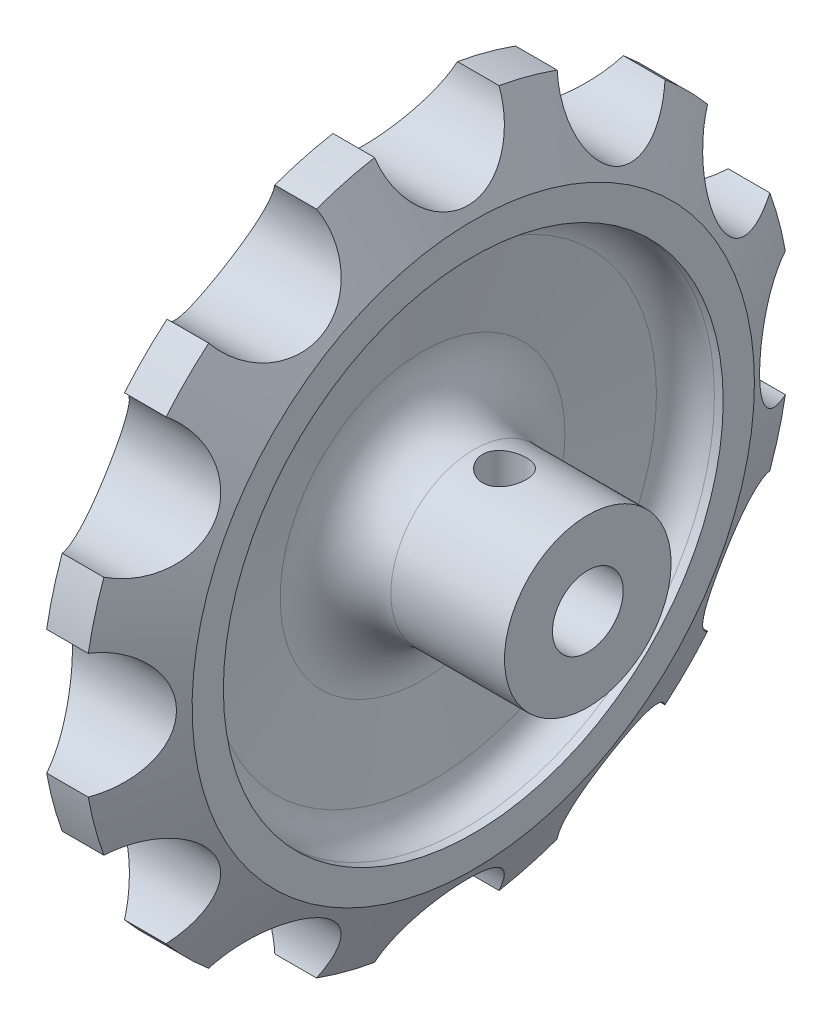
ISO-10303-21;
HEADER;
FILE_DESCRIPTION(('STEP AP214'),'2;1');
FILE_NAME('part.step','',(''),(''),'','','');
FILE_SCHEMA(('AUTOMOTIVE_DESIGN { 1 0 10303 214 1 1 1 1 }'));
ENDSEC;
DATA;
#1=APPLICATION_CONTEXT('core data for automotive mechanical design processes');
#2=APPLICATION_PROTOCOL_DEFINITION('international standard','automotive_design',2000,#1);
#3=PRODUCT_CONTEXT('',#1,'mechanical');
#4=PRODUCT('Part','Part','',(#3));
#5=PRODUCT_RELATED_PRODUCT_CATEGORY('part','',(#4));
#6=PRODUCT_DEFINITION_FORMATION('','',#4);
#7=PRODUCT_DEFINITION_CONTEXT('part definition',#1,'design');
#8=PRODUCT_DEFINITION('design','',#6,#7);
#9=PRODUCT_DEFINITION_SHAPE('','',#8);
#10=(LENGTH_UNIT() NAMED_UNIT(*) SI_UNIT(.MILLI.,.METRE.));
#11=(NAMED_UNIT(*) PLANE_ANGLE_UNIT() SI_UNIT($,.RADIAN.));
#12=(NAMED_UNIT(*) SI_UNIT($,.STERADIAN.) SOLID_ANGLE_UNIT());
#13=UNCERTAINTY_MEASURE_WITH_UNIT(LENGTH_MEASURE(1.E-05),#10,'distance_accuracy_value','');
#14=(GEOMETRIC_REPRESENTATION_CONTEXT(3) GLOBAL_UNCERTAINTY_ASSIGNED_CONTEXT((#13)) GLOBAL_UNIT_ASSIGNED_CONTEXT((#10,
#11,#12)) REPRESENTATION_CONTEXT('',''));
#15=CARTESIAN_POINT('',(0.,0.,0.));
#16=DIRECTION('',(0.,0.,1.));
#17=DIRECTION('',(1.,0.,0.));
#18=AXIS2_PLACEMENT_3D('',#15,#16,#17);
#19=CARTESIAN_POINT('',(10.,0.,0.));
#20=DIRECTION('',(-1.,0.,0.));
#21=DIRECTION('',(0.,0.,1.));
#22=AXIS2_PLACEMENT_3D('',#19,#20,#21);
#23=CONICAL_SURFACE('',#22,27.,1.10714871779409);
#24=CARTESIAN_POINT('',(10.,0.,0.));
#25=DIRECTION('',(1.,0.,0.));
#26=DIRECTION('',(0.,0.,-1.));
#27=AXIS2_PLACEMENT_3D('',#24,#25,#26);
#28=CIRCLE('',#27,27.);
#29=CARTESIAN_POINT('',(10.,0.,-27.));
#30=VERTEX_POINT('',#29);
#31=EDGE_CURVE('E219',#30,#30,#28,.T.);
#32=ORIENTED_EDGE('',*,*,#31,.F.);
#33=EDGE_LOOP('',(#32));
#34=FACE_BOUND('',#33,.T.);
#35=CARTESIAN_POINT('',(6.5,0.,0.));
#36=DIRECTION('',(1.,0.,0.));
#37=DIRECTION('',(0.,0.,-1.));
#38=AXIS2_PLACEMENT_3D('',#35,#36,#37);
#39=CIRCLE('',#38,34.);
#40=CARTESIAN_POINT('',(6.5,-33.4705882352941,-5.97659796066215));
#41=VERTEX_POINT('',#40);
#42=CARTESIAN_POINT('',(6.5,-31.9746786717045,-11.5594084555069));
#43=VERTEX_POINT('',#42);
#44=EDGE_CURVE('E211',#41,#43,#39,.T.);
#45=ORIENTED_EDGE('',*,*,#44,.T.);
#46=CARTESIAN_POINT('',(6.4998,-25.998409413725,-21.9114104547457));
#47=CARTESIAN_POINT('',(6.59251407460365,-25.8460134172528,-21.8044766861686));
#48=CARTESIAN_POINT('',(6.68554070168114,-25.6987293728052,-21.6905327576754));
#49=CARTESIAN_POINT('',(6.8715742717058,-25.4153440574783,-21.4494456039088));
#50=CARTESIAN_POINT('',(6.96458121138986,-25.2792440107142,-21.3223009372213));
#51=CARTESIAN_POINT('',(7.15017274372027,-25.01885074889,-21.0552791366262));
#52=CARTESIAN_POINT('',(7.24275539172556,-24.8945920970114,-20.9153669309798));
#53=CARTESIAN_POINT('',(7.42654535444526,-24.6592432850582,-20.6239380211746));
#54=CARTESIAN_POINT('',(7.51775222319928,-24.5481573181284,-20.4724176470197));
#55=CARTESIAN_POINT('',(7.69808727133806,-24.3400496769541,-20.1585391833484));
#56=CARTESIAN_POINT('',(7.78721304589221,-24.2430436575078,-19.9961693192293));
#57=CARTESIAN_POINT('',(7.96243676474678,-24.0642175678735,-19.6616932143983));
#58=CARTESIAN_POINT('',(8.04853453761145,-23.9823983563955,-19.4895864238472));
#59=CARTESIAN_POINT('',(8.21671476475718,-23.8349916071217,-19.1367882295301));
#60=CARTESIAN_POINT('',(8.29879930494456,-23.7693955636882,-18.9561013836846));
#61=CARTESIAN_POINT('',(8.45792554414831,-23.6554246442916,-18.5873294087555));
#62=CARTESIAN_POINT('',(8.53496998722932,-23.6070403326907,-18.3992483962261));
#63=CARTESIAN_POINT('',(8.67857189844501,-23.5307682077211,-18.0282056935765));
#64=CARTESIAN_POINT('',(8.74547964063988,-23.5018423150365,-17.8455934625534));
#65=CARTESIAN_POINT('',(8.87280582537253,-23.4609209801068,-17.4763467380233));
#66=CARTESIAN_POINT('',(8.93322803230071,-23.4489156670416,-17.2897146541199));
#67=CARTESIAN_POINT('',(9.04651737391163,-23.4425405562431,-16.9139699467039));
#68=CARTESIAN_POINT('',(9.09938891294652,-23.4481604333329,-16.7248588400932));
#69=CARTESIAN_POINT('',(9.19652307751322,-23.4776043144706,-16.3458423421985));
#70=CARTESIAN_POINT('',(9.24078740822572,-23.5014247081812,-16.1559371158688));
#71=CARTESIAN_POINT('',(9.31424127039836,-23.5630542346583,-15.8034273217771));
#72=CARTESIAN_POINT('',(9.34466705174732,-23.5984871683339,-15.6406622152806));
#73=CARTESIAN_POINT('',(9.39775572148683,-23.6831768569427,-15.3174858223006));
#74=CARTESIAN_POINT('',(9.42041989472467,-23.732431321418,-15.1570741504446));
#75=CARTESIAN_POINT('',(9.45749454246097,-23.8445381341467,-14.8402384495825));
#76=CARTESIAN_POINT('',(9.47191179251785,-23.9073792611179,-14.6838112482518));
#77=CARTESIAN_POINT('',(9.49219723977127,-24.0462584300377,-14.3763567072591));
#78=CARTESIAN_POINT('',(9.49806628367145,-24.1222951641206,-14.2253288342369));
#79=CARTESIAN_POINT('',(9.50093728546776,-24.2767838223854,-13.948289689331));
#80=CARTESIAN_POINT('',(9.49893849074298,-24.3537957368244,-13.8214820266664));
#81=CARTESIAN_POINT('',(9.48829909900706,-24.516857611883,-13.574113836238));
#82=CARTESIAN_POINT('',(9.47965880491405,-24.6029071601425,-13.4535530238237));
#83=CARTESIAN_POINT('',(9.45588918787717,-24.7833279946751,-13.2195353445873));
#84=CARTESIAN_POINT('',(9.44076061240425,-24.8776983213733,-13.1060776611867));
#85=CARTESIAN_POINT('',(9.40427123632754,-25.0739849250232,-12.8869650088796));
#86=CARTESIAN_POINT('',(9.38291027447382,-25.1759013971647,-12.7813102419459));
#87=CARTESIAN_POINT('',(9.33465728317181,-25.3848851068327,-12.579896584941));
#88=CARTESIAN_POINT('',(9.30785228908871,-25.4918531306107,-12.4840138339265));
#89=CARTESIAN_POINT('',(9.24891147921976,-25.7115059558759,-12.3007953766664));
#90=CARTESIAN_POINT('',(9.21677392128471,-25.8241926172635,-12.2134624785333));
#91=CARTESIAN_POINT('',(9.1129974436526,-26.1695890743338,-11.9648318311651));
#92=CARTESIAN_POINT('',(9.03396143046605,-26.409776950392,-11.8167667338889));
#93=CARTESIAN_POINT('',(8.85205549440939,-26.9257603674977,-11.5459584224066));
#94=CARTESIAN_POINT('',(8.74768529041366,-27.2028186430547,-11.4266688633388));
#95=CARTESIAN_POINT('',(8.52433930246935,-27.766266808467,-11.2318776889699));
#96=CARTESIAN_POINT('',(8.40535683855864,-28.0526609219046,-11.1563961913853));
#97=CARTESIAN_POINT('',(8.1402534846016,-28.667174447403,-11.0413548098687));
#98=CARTESIAN_POINT('',(7.99262687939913,-28.9957848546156,-11.0078953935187));
#99=CARTESIAN_POINT('',(7.6886420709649,-29.6501242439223,-10.9945818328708));
#100=CARTESIAN_POINT('',(7.5322789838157,-29.9758514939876,-11.014757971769));
#101=CARTESIAN_POINT('',(7.22980246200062,-30.5878259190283,-11.1025321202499));
#102=CARTESIAN_POINT('',(7.08408096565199,-30.8749356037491,-11.1655650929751));
#103=CARTESIAN_POINT('',(6.79190235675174,-31.4359124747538,-11.3324379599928));
#104=CARTESIAN_POINT('',(6.64544716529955,-31.7098037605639,-11.4362001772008));
#105=CARTESIAN_POINT('',(6.4998,-31.9750427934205,-11.5595777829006));
#106=B_SPLINE_CURVE_WITH_KNOTS('',3,(#46,#47,#48,#49,#50,#51,#52,#53,#54,#55,#56,#57,#58,#59,
#60,#61,#62,#63,#64,#65,#66,#67,#68,#69,#70,#71,#72,#73,#74,#75,#76,#77,#78,#79,#80,#81,#82,#83,
#84,#85,#86,#87,#88,#89,#90,#91,#92,#93,#94,#95,#96,#97,#98,#99,#100,#101,#102,#103,#104,#105),
.UNSPECIFIED.,.F.,.F.,(4,2,2,2,2,2,2,2,2,2,2,2,2,2,2,2,2,2,2,2,2,2,2,2,2,2,2,2,2,4),(0.,
0.623754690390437,1.24757756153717,1.87316881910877,2.49895868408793,3.12543908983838,
3.75195490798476,4.37814155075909,5.00398438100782,5.59302042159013,6.18171269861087,
6.77006017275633,7.35829096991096,7.86557150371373,8.37276802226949,8.8795472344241,
9.3862762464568,9.83085580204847,10.2754150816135,10.7199231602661,11.1644427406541,
11.6023476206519,12.0403958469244,12.9159026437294,13.8697893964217,14.8241138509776,
15.9051537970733,16.9868042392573,17.968277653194,18.947888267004),.UNSPECIFIED.);
#107=CARTESIAN_POINT('',(6.5,-25.9980807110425,-21.9111797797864));
#108=VERTEX_POINT('',#107);
#109=EDGE_CURVE('E199',#108,#43,#106,.T.);
#110=ORIENTED_EDGE('',*,*,#109,.F.);
#111=CARTESIAN_POINT('',(6.5,-21.9111797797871,-25.9980807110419));
#112=VERTEX_POINT('',#111);
#113=EDGE_CURVE('E220',#108,#112,#39,.T.);
#114=ORIENTED_EDGE('',*,*,#113,.T.);
#115=CARTESIAN_POINT('',(6.4998,-11.5595777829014,-31.9750427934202));
#116=CARTESIAN_POINT('',(6.59251407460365,-11.48106586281,-31.8062374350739));
#117=CARTESIAN_POINT('',(6.68554070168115,-11.4104861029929,-31.633917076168));
#118=CARTESIAN_POINT('',(6.8715742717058,-11.2856107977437,-31.2834368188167));
#119=CARTESIAN_POINT('',(6.96458121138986,-11.2313170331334,-31.1052762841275));
#120=CARTESIAN_POINT('',(7.15017274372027,-11.1393207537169,-30.7438319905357));
#121=CARTESIAN_POINT('',(7.24275539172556,-11.1016657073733,-30.5605351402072));
#122=CARTESIAN_POINT('',(7.42654535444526,-11.0435621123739,-30.1904758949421));
#123=CARTESIAN_POINT('',(7.51775222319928,-11.0231190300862,-30.0037124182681));
#124=CARTESIAN_POINT('',(7.69808727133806,-10.9998317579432,-29.6278318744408));
#125=CARTESIAN_POINT('',(7.78721304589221,-10.9970070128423,-29.4387124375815));
#126=CARTESIAN_POINT('',(7.96243676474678,-11.0093771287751,-29.0596345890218));
#127=CARTESIAN_POINT('',(8.04853453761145,-11.0245730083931,-28.8696761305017));
#128=CARTESIAN_POINT('',(8.21671476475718,-11.0733141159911,-28.490440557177));
#129=CARTESIAN_POINT('',(8.29879930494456,-11.1068496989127,-28.3011631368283));
#130=CARTESIAN_POINT('',(8.45792554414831,-11.1925339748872,-27.9248117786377));
#131=CARTESIAN_POINT('',(8.53496998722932,-11.2446724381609,-27.7377366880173));
#132=CARTESIAN_POINT('',(8.67857189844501,-11.3641401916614,-27.3782682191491));
#133=CARTESIAN_POINT('',(8.74547964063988,-11.430395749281,-27.205658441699));
#134=CARTESIAN_POINT('',(8.87280582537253,-11.5795801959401,-26.8654207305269));
#135=CARTESIAN_POINT('',(8.93322803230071,-11.662499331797,-26.6977899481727));
#136=CARTESIAN_POINT('',(9.04651737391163,-11.8448506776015,-26.3691979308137));
#137=CARTESIAN_POINT('',(9.09938891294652,-11.9442731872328,-26.208232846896));
#138=CARTESIAN_POINT('',(9.19652307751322,-12.1592805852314,-25.8947168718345));
#139=CARTESIAN_POINT('',(9.24078740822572,-12.2748622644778,-25.7421643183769));
#140=CARTESIAN_POINT('',(9.31424127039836,-12.504489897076,-25.4676966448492));
#141=CARTESIAN_POINT('',(9.34466705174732,-12.6165582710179,-25.3444543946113));
#142=CARTESIAN_POINT('',(9.39775572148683,-12.8514898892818,-25.1069202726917));
#143=CARTESIAN_POINT('',(9.42041989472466,-12.9743513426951,-24.9926269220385));
#144=CARTESIAN_POINT('',(9.45749454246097,-13.2298565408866,-24.7742925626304));
#145=CARTESIAN_POINT('',(9.47191179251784,-13.3624921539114,-24.6702431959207));
#146=CARTESIAN_POINT('',(9.49219723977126,-13.6364923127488,-24.4734193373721));
#147=CARTESIAN_POINT('',(9.49806628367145,-13.7778559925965,-24.3806437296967));
#148=CARTESIAN_POINT('',(9.50093728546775,-14.0501666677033,-24.2179651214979));
#149=CARTESIAN_POINT('',(9.49893849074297,-14.1802647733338,-24.1466524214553));
#150=CARTESIAN_POINT('',(9.48829909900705,-14.4451645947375,-24.0139562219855));
#151=CARTESIAN_POINT('',(9.47965880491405,-14.5799660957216,-23.9525722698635));
#152=CARTESIAN_POINT('',(9.45588918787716,-14.853223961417,-23.8401174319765));
#153=CARTESIAN_POINT('',(9.44076061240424,-14.9916799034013,-23.7890453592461));
#154=CARTESIAN_POINT('',(9.40427123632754,-15.2712254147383,-23.6974315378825));
#155=CARTESIAN_POINT('',(9.38291027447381,-15.4123150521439,-23.6568900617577));
#156=CARTESIAN_POINT('',(9.3346572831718,-15.6940070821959,-23.5869525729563));
#157=CARTESIAN_POINT('',(9.3078522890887,-15.8345854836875,-23.5573996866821));
#158=CARTESIAN_POINT('',(9.24891147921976,-16.1164196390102,-23.5085542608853));
#159=CARTESIAN_POINT('',(9.2167739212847,-16.2576755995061,-23.4892650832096));
#160=CARTESIAN_POINT('',(9.11299744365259,-16.6811130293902,-23.4466428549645));
#161=CARTESIAN_POINT('',(9.03396143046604,-16.9631543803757,-23.4385086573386));
#162=CARTESIAN_POINT('',(8.85205549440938,-17.5454132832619,-23.461973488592));
#163=CARTESIAN_POINT('',(8.74768529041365,-17.8449975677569,-23.4971948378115));
#164=CARTESIAN_POINT('',(8.52433930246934,-18.4303535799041,-23.6102248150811));
#165=CARTESIAN_POINT('',(8.40535683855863,-18.7161189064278,-23.688052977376));
#166=CARTESIAN_POINT('',(8.1402534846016,-19.3058239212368,-23.8956809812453));
#167=CARTESIAN_POINT('',(7.99262687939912,-19.6071385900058,-24.0310094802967));
#168=CARTESIAN_POINT('',(7.68864207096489,-20.1804699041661,-24.3466492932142));
#169=CARTESIAN_POINT('',(7.53227898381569,-20.4524699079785,-24.526985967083));
#170=CARTESIAN_POINT('',(7.22980246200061,-20.9385682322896,-24.9089878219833));
#171=CARTESIAN_POINT('',(7.08408096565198,-21.1556960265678,-25.1071308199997));
#172=CARTESIAN_POINT('',(6.79190235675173,-21.5580798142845,-25.5321353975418));
#173=CARTESIAN_POINT('',(6.64544716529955,-21.7433955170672,-25.758941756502));
#174=CARTESIAN_POINT('',(6.4998,-21.9114104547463,-25.9984094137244));
#175=B_SPLINE_CURVE_WITH_KNOTS('',3,(#115,#116,#117,#118,#119,#120,#121,#122,#123,#124,#125,
#126,#127,#128,#129,#130,#131,#132,#133,#134,#135,#136,#137,#138,#139,#140,#141,#142,#143,#144,
#145,#146,#147,#148,#149,#150,#151,#152,#153,#154,#155,#156,#157,#158,#159,#160,#161,#162,#163,
#164,#165,#166,#167,#168,#169,#170,#171,#172,#173,#174),.UNSPECIFIED.,.F.,.F.,(4,2,2,2,2,2,2,2,
2,2,2,2,2,2,2,2,2,2,2,2,2,2,2,2,2,2,2,2,2,4),(0.,0.623754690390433,1.24757756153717,
1.87316881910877,2.49895868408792,3.12543908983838,3.75195490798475,4.37814155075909,
5.00398438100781,5.59302042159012,6.18171269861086,6.77006017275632,7.35829096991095,
7.86557150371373,8.37276802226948,8.87954723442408,9.38627624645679,9.83085580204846,
10.2754150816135,10.7199231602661,11.1644427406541,11.6023476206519,12.0403958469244,
12.9159026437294,13.8697893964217,14.8241138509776,15.9051537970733,16.9868042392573,
17.968277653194,18.947888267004),.UNSPECIFIED.);
#176=CARTESIAN_POINT('',(6.5,-11.5594084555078,-31.9746786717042));
#177=VERTEX_POINT('',#176);
#178=EDGE_CURVE('E673',#177,#112,#175,.T.);
#179=ORIENTED_EDGE('',*,*,#178,.F.);
#180=CARTESIAN_POINT('',(6.5,-5.9765979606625,-33.4705882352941));
#181=VERTEX_POINT('',#180);
#182=EDGE_CURVE('E226',#177,#181,#39,.T.);
#183=ORIENTED_EDGE('',*,*,#182,.T.);
#184=CARTESIAN_POINT('',(6.4998,5.9766333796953,-33.4709882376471));
#185=CARTESIAN_POINT('',(6.59251407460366,5.96022401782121,-33.2855425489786));
#186=CARTESIAN_POINT('',(6.68554070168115,5.93518770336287,-33.1010188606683));
#187=CARTESIAN_POINT('',(6.87157427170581,5.86809276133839,-32.7350564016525));
#188=CARTESIAN_POINT('',(6.96458121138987,5.82603227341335,-32.5536179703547));
#189=CARTESIAN_POINT('',(7.15017274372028,5.7249812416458,-32.1945998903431));
#190=CARTESIAN_POINT('',(7.24275539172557,5.66594304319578,-32.0170326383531));
#191=CARTESIAN_POINT('',(7.42654535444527,5.53123260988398,-31.6675001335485));
#192=CARTESIAN_POINT('',(7.51775222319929,5.45555510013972,-31.4955366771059));
#193=CARTESIAN_POINT('',(7.69808727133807,5.28778219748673,-31.1583709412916));
#194=CARTESIAN_POINT('',(7.78721304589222,5.19566878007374,-30.9931763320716));
#195=CARTESIAN_POINT('',(7.96243676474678,4.99541702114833,-30.6710703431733));
#196=CARTESIAN_POINT('',(8.04853453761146,4.88727777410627,-30.5141594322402));
#197=CARTESIAN_POINT('',(8.21671476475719,4.65544895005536,-30.2101023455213));
#198=CARTESIAN_POINT('',(8.29879930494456,4.53176757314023,-30.0629510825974));
#199=CARTESIAN_POINT('',(8.45792554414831,4.26938713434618,-29.7798633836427));
#200=CARTESIAN_POINT('',(8.53496998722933,4.13069635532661,-29.643920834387));
#201=CARTESIAN_POINT('',(8.67857189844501,3.84750001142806,-29.3923458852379));
#202=CARTESIAN_POINT('',(8.74547964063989,3.70381612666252,-29.2759892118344));
#203=CARTESIAN_POINT('',(8.87280582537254,3.40449975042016,-29.0559269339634));
#204=CARTESIAN_POINT('',(8.93322803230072,3.24887428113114,-28.9522139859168));
#205=CARTESIAN_POINT('',(9.04651737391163,2.92665737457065,-28.7588206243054));
#206=CARTESIAN_POINT('',(9.09938891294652,2.76007241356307,-28.6691320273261));
#207=CARTESIAN_POINT('',(9.19652307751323,2.41711255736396,-28.5051229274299));
#208=CARTESIAN_POINT('',(9.24078740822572,2.24073961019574,-28.4307993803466));
#209=CARTESIAN_POINT('',(9.31424127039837,1.90464241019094,-28.3079172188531));
#210=CARTESIAN_POINT('',(9.34466705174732,1.74596722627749,-28.2572204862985));
#211=CARTESIAN_POINT('',(9.39775572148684,1.42374341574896,-28.1689757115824));
#212=CARTESIAN_POINT('',(9.42041989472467,1.26019560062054,-28.1314254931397));
#213=CARTESIAN_POINT('',(9.45749454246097,0.929754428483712,-28.0700949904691));
#214=CARTESIAN_POINT('',(9.47191179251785,0.762863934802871,-28.0463034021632));
#215=CARTESIAN_POINT('',(9.49219723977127,0.427160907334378,-28.0128490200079));
#216=CARTESIAN_POINT('',(9.49806628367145,0.258348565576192,-28.0031848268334));
#217=CARTESIAN_POINT('',(9.50093728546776,-0.0588187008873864,-27.9984563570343));
#218=CARTESIAN_POINT('',(9.49893849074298,-0.207143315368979,-28.0017468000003));
#219=CARTESIAN_POINT('',(9.48829909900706,-0.502901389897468,-28.0192784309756));
#220=CARTESIAN_POINT('',(9.47965880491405,-0.6503348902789,-28.0335191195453));
#221=CARTESIAN_POINT('',(9.45588918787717,-0.943210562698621,-28.0727593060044));
#222=CARTESIAN_POINT('',(9.44076061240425,-1.08865296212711,-28.0977575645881));
#223=CARTESIAN_POINT('',(9.40427123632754,-1.37655338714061,-28.1581904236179));
#224=CARTESIAN_POINT('',(9.38291027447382,-1.51901133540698,-28.1936252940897));
#225=CARTESIAN_POINT('',(9.33465728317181,-1.79793253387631,-28.2739036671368));
#226=CARTESIAN_POINT('',(9.30785228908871,-1.93445344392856,-28.318599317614));
#227=CARTESIAN_POINT('',(9.24891147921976,-2.20295169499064,-28.4172150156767));
#228=CARTESIAN_POINT('',(9.2167739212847,-2.33492753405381,-28.4711380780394));
#229=CARTESIAN_POINT('',(9.11299744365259,-2.72294621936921,-28.6459448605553));
#230=CARTESIAN_POINT('',(9.03396143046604,-2.97126829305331,-28.7799211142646));
#231=CARTESIAN_POINT('',(8.85205549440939,-3.46378687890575,-29.0913717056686));
#232=CARTESIAN_POINT('',(8.74768529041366,-3.70562380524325,-29.2716664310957));
#233=CARTESIAN_POINT('',(8.52433930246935,-4.15604199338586,-29.662231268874));
#234=CARTESIAN_POINT('',(8.40535683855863,-4.36460794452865,-29.8725150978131));
#235=CARTESIAN_POINT('',(8.1402534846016,-4.77149346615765,-30.3471787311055));
#236=CARTESIAN_POINT('',(7.99262687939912,-4.96477537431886,-30.6150339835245));
#237=CARTESIAN_POINT('',(7.68864207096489,-5.30347495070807,-31.175051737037));
#238=CARTESIAN_POINT('',(7.53227898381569,-5.44886552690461,-31.4672278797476));
#239=CARTESIAN_POINT('',(7.22980246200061,-5.67883809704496,-32.0411003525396));
#240=CARTESIAN_POINT('',(7.08408096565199,-5.7678047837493,-32.3212611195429));
#241=CARTESIAN_POINT('',(6.79190235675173,-5.90377707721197,-32.8905177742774));
#242=CARTESIAN_POINT('',(6.64544716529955,-5.95086200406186,-33.1795956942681));
#243=CARTESIAN_POINT('',(6.4998,-5.976633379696,-33.470988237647));
#244=B_SPLINE_CURVE_WITH_KNOTS('',3,(#184,#185,#186,#187,#188,#189,#190,#191,#192,#193,#194,
#195,#196,#197,#198,#199,#200,#201,#202,#203,#204,#205,#206,#207,#208,#209,#210,#211,#212,#213,
#214,#215,#216,#217,#218,#219,#220,#221,#222,#223,#224,#225,#226,#227,#228,#229,#230,#231,#232,
#233,#234,#235,#236,#237,#238,#239,#240,#241,#242,#243),.UNSPECIFIED.,.F.,.F.,(4,2,2,2,2,2,2,2,
2,2,2,2,2,2,2,2,2,2,2,2,2,2,2,2,2,2,2,2,2,4),(0.,0.623754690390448,1.24757756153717,
1.87316881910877,2.49895868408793,3.12543908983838,3.75195490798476,4.37814155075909,
5.00398438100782,5.59302042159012,6.18171269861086,6.77006017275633,7.35829096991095,
7.86557150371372,8.37276802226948,8.87954723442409,9.38627624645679,9.83085580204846,
10.2754150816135,10.7199231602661,11.1644427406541,11.6023476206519,12.0403958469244,
12.9159026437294,13.8697893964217,14.8241138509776,15.9051537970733,16.9868042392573,
17.968277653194,18.947888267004),.UNSPECIFIED.);
#245=CARTESIAN_POINT('',(6.5,5.9765979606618,-33.4705882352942));
#246=VERTEX_POINT('',#245);
#247=EDGE_CURVE('E708',#246,#181,#244,.T.);
#248=ORIENTED_EDGE('',*,*,#247,.F.);
#249=CARTESIAN_POINT('',(6.5,11.5594084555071,-31.9746786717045));
#250=VERTEX_POINT('',#249);
#251=EDGE_CURVE('E952',#246,#250,#39,.T.);
#252=ORIENTED_EDGE('',*,*,#251,.T.);
#253=CARTESIAN_POINT('',(6.4998,21.9114104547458,-25.9984094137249));
#254=CARTESIAN_POINT('',(6.59251407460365,21.8044766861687,-25.8460134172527));
#255=CARTESIAN_POINT('',(6.68554070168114,21.6905327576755,-25.6987293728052));
#256=CARTESIAN_POINT('',(6.8715742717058,21.4494456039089,-25.4153440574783));
#257=CARTESIAN_POINT('',(6.96458121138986,21.3223009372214,-25.2792440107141));
#258=CARTESIAN_POINT('',(7.15017274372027,21.0552791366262,-25.0188507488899));
#259=CARTESIAN_POINT('',(7.24275539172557,20.9153669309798,-24.8945920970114));
#260=CARTESIAN_POINT('',(7.42654535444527,20.6239380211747,-24.6592432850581));
#261=CARTESIAN_POINT('',(7.51775222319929,20.4724176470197,-24.5481573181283));
#262=CARTESIAN_POINT('',(7.69808727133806,20.1585391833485,-24.340049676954));
#263=CARTESIAN_POINT('',(7.78721304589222,19.9961693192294,-24.2430436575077));
#264=CARTESIAN_POINT('',(7.96243676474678,19.6616932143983,-24.0642175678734));
#265=CARTESIAN_POINT('',(8.04853453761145,19.4895864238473,-23.9823983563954));
#266=CARTESIAN_POINT('',(8.21671476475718,19.1367882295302,-23.8349916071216));
#267=CARTESIAN_POINT('',(8.29879930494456,18.9561013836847,-23.7693955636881));
#268=CARTESIAN_POINT('',(8.45792554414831,18.5873294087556,-23.6554246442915));
#269=CARTESIAN_POINT('',(8.53496998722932,18.3992483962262,-23.6070403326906));
#270=CARTESIAN_POINT('',(8.67857189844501,18.0282056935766,-23.530768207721));
#271=CARTESIAN_POINT('',(8.74547964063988,17.8455934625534,-23.5018423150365));
#272=CARTESIAN_POINT('',(8.87280582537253,17.4763467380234,-23.4609209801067));
#273=CARTESIAN_POINT('',(8.93322803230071,17.2897146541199,-23.4489156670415));
#274=CARTESIAN_POINT('',(9.04651737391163,16.913969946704,-23.442540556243));
#275=CARTESIAN_POINT('',(9.09938891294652,16.7248588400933,-23.4481604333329));
#276=CARTESIAN_POINT('',(9.19652307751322,16.3458423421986,-23.4776043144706));
#277=CARTESIAN_POINT('',(9.24078740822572,16.1559371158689,-23.5014247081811));
#278=CARTESIAN_POINT('',(9.31424127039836,15.8034273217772,-23.5630542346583));
#279=CARTESIAN_POINT('',(9.34466705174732,15.6406622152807,-23.5984871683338));
#280=CARTESIAN_POINT('',(9.39775572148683,15.3174858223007,-23.6831768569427));
#281=CARTESIAN_POINT('',(9.42041989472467,15.1570741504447,-23.7324313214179));
#282=CARTESIAN_POINT('',(9.45749454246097,14.8402384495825,-23.8445381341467));
#283=CARTESIAN_POINT('',(9.47191179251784,14.6838112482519,-23.9073792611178));
#284=CARTESIAN_POINT('',(9.49219723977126,14.3763567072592,-24.0462584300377));
#285=CARTESIAN_POINT('',(9.49806628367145,14.225328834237,-24.1222951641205));
#286=CARTESIAN_POINT('',(9.50093728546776,13.9482896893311,-24.2767838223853));
#287=CARTESIAN_POINT('',(9.49893849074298,13.8214820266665,-24.3537957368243));
#288=CARTESIAN_POINT('',(9.48829909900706,13.5741138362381,-24.5168576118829));
#289=CARTESIAN_POINT('',(9.47965880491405,13.4535530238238,-24.6029071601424));
#290=CARTESIAN_POINT('',(9.45588918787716,13.2195353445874,-24.7833279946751));
#291=CARTESIAN_POINT('',(9.44076061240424,13.1060776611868,-24.8776983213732));
#292=CARTESIAN_POINT('',(9.40427123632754,12.8869650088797,-25.0739849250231));
#293=CARTESIAN_POINT('',(9.38291027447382,12.7813102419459,-25.1759013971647));
#294=CARTESIAN_POINT('',(9.33465728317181,12.579896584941,-25.3848851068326));
#295=CARTESIAN_POINT('',(9.30785228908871,12.4840138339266,-25.4918531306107));
#296=CARTESIAN_POINT('',(9.24891147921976,12.3007953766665,-25.7115059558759));
#297=CARTESIAN_POINT('',(9.2167739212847,12.2134624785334,-25.8241926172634));
#298=CARTESIAN_POINT('',(9.11299744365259,11.9648318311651,-26.1695890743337));
#299=CARTESIAN_POINT('',(9.03396143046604,11.8167667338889,-26.4097769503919));
#300=CARTESIAN_POINT('',(8.85205549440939,11.5459584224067,-26.9257603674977));
#301=CARTESIAN_POINT('',(8.74768529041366,11.4266688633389,-27.2028186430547));
#302=CARTESIAN_POINT('',(8.52433930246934,11.23187768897,-27.7662668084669));
#303=CARTESIAN_POINT('',(8.40535683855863,11.1563961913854,-28.0526609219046));
#304=CARTESIAN_POINT('',(8.1402534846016,11.0413548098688,-28.667174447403));
#305=CARTESIAN_POINT('',(7.99262687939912,11.0078953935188,-28.9957848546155));
#306=CARTESIAN_POINT('',(7.68864207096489,10.9945818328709,-29.6501242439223));
#307=CARTESIAN_POINT('',(7.53227898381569,11.0147579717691,-29.9758514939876));
#308=CARTESIAN_POINT('',(7.22980246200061,11.10253212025,-30.5878259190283));
#309=CARTESIAN_POINT('',(7.08408096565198,11.1655650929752,-30.874935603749));
#310=CARTESIAN_POINT('',(6.79190235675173,11.3324379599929,-31.4359124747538));
#311=CARTESIAN_POINT('',(6.64544716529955,11.4362001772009,-31.7098037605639));
#312=CARTESIAN_POINT('',(6.4998,11.5595777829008,-31.9750427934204));
#313=B_SPLINE_CURVE_WITH_KNOTS('',3,(#253,#254,#255,#256,#257,#258,#259,#260,#261,#262,#263,
#264,#265,#266,#267,#268,#269,#270,#271,#272,#273,#274,#275,#276,#277,#278,#279,#280,#281,#282,
#283,#284,#285,#286,#287,#288,#289,#290,#291,#292,#293,#294,#295,#296,#297,#298,#299,#300,#301,
#302,#303,#304,#305,#306,#307,#308,#309,#310,#311,#312),.UNSPECIFIED.,.F.,.F.,(4,2,2,2,2,2,2,2,
2,2,2,2,2,2,2,2,2,2,2,2,2,2,2,2,2,2,2,2,2,4),(0.,0.623754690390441,1.24757756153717,
1.87316881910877,2.49895868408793,3.12543908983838,3.75195490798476,4.37814155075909,
5.00398438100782,5.59302042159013,6.18171269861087,6.77006017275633,7.35829096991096,
7.86557150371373,8.37276802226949,8.8795472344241,9.3862762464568,9.83085580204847,
10.2754150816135,10.7199231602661,11.1644427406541,11.6023476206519,12.0403958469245,
12.9159026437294,13.8697893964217,14.8241138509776,15.9051537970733,16.9868042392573,
17.968277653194,18.947888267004),.UNSPECIFIED.);
#314=CARTESIAN_POINT('',(6.5,21.9111797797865,-25.9980807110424));
#315=VERTEX_POINT('',#314);
#316=EDGE_CURVE('E732',#315,#250,#313,.T.);
#317=ORIENTED_EDGE('',*,*,#316,.F.);
#318=CARTESIAN_POINT('',(6.5,25.998080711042,-21.911179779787));
#319=VERTEX_POINT('',#318);
#320=EDGE_CURVE('E949',#315,#319,#39,.T.);
#321=ORIENTED_EDGE('',*,*,#320,.T.);
#322=CARTESIAN_POINT('',(6.4998,31.9750427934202,-11.5595777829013));
#323=CARTESIAN_POINT('',(6.59251407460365,31.806237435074,-11.4810658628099));
#324=CARTESIAN_POINT('',(6.68554070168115,31.6339170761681,-11.4104861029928));
#325=CARTESIAN_POINT('',(6.87157427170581,31.2834368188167,-11.2856107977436));
#326=CARTESIAN_POINT('',(6.96458121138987,31.1052762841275,-11.2313170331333));
#327=CARTESIAN_POINT('',(7.15017274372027,30.7438319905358,-11.1393207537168));
#328=CARTESIAN_POINT('',(7.24275539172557,30.5605351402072,-11.1016657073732));
#329=CARTESIAN_POINT('',(7.42654535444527,30.1904758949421,-11.0435621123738));
#330=CARTESIAN_POINT('',(7.51775222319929,30.0037124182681,-11.0231190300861));
#331=CARTESIAN_POINT('',(7.69808727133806,29.6278318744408,-10.9998317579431));
#332=CARTESIAN_POINT('',(7.78721304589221,29.4387124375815,-10.9970070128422));
#333=CARTESIAN_POINT('',(7.96243676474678,29.0596345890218,-11.009377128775));
#334=CARTESIAN_POINT('',(8.04853453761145,28.8696761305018,-11.024573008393));
#335=CARTESIAN_POINT('',(8.21671476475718,28.490440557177,-11.073314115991));
#336=CARTESIAN_POINT('',(8.29879930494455,28.3011631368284,-11.1068496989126));
#337=CARTESIAN_POINT('',(8.4579255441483,27.9248117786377,-11.1925339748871));
#338=CARTESIAN_POINT('',(8.53496998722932,27.7377366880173,-11.2446724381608));
#339=CARTESIAN_POINT('',(8.67857189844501,27.3782682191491,-11.3641401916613));
#340=CARTESIAN_POINT('',(8.74547964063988,27.205658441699,-11.4303957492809));
#341=CARTESIAN_POINT('',(8.87280582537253,26.865420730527,-11.57958019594));
#342=CARTESIAN_POINT('',(8.93322803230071,26.6977899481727,-11.6624993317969));
#343=CARTESIAN_POINT('',(9.04651737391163,26.3691979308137,-11.8448506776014));
#344=CARTESIAN_POINT('',(9.09938891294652,26.208232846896,-11.9442731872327));
#345=CARTESIAN_POINT('',(9.19652307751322,25.8947168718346,-12.1592805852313));
#346=CARTESIAN_POINT('',(9.24078740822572,25.7421643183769,-12.2748622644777));
#347=CARTESIAN_POINT('',(9.31424127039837,25.4676966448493,-12.5044898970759));
#348=CARTESIAN_POINT('',(9.34466705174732,25.3444543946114,-12.6165582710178));
#349=CARTESIAN_POINT('',(9.39775572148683,25.1069202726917,-12.8514898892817));
#350=CARTESIAN_POINT('',(9.42041989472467,24.9926269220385,-12.974351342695));
#351=CARTESIAN_POINT('',(9.45749454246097,24.7742925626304,-13.2298565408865));
#352=CARTESIAN_POINT('',(9.47191179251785,24.6702431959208,-13.3624921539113));
#353=CARTESIAN_POINT('',(9.49219723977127,24.4734193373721,-13.6364923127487));
#354=CARTESIAN_POINT('',(9.49806628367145,24.3806437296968,-13.7778559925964));
#355=CARTESIAN_POINT('',(9.50093728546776,24.217965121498,-14.0501666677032));
#356=CARTESIAN_POINT('',(9.49893849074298,24.1466524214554,-14.1802647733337));
#357=CARTESIAN_POINT('',(9.48829909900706,24.0139562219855,-14.4451645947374));
#358=CARTESIAN_POINT('',(9.47965880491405,23.9525722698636,-14.5799660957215));
#359=CARTESIAN_POINT('',(9.45588918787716,23.8401174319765,-14.853223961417));
#360=CARTESIAN_POINT('',(9.44076061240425,23.7890453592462,-14.9916799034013));
#361=CARTESIAN_POINT('',(9.40427123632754,23.6974315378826,-15.2712254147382));
#362=CARTESIAN_POINT('',(9.38291027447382,23.6568900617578,-15.4123150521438));
#363=CARTESIAN_POINT('',(9.33465728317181,23.5869525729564,-15.6940070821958));
#364=CARTESIAN_POINT('',(9.30785228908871,23.5573996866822,-15.8345854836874));
#365=CARTESIAN_POINT('',(9.24891147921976,23.5085542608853,-16.1164196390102));
#366=CARTESIAN_POINT('',(9.21677392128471,23.4892650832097,-16.257675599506));
#367=CARTESIAN_POINT('',(9.11299744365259,23.4466428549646,-16.6811130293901));
#368=CARTESIAN_POINT('',(9.03396143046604,23.4385086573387,-16.9631543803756));
#369=CARTESIAN_POINT('',(8.85205549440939,23.461973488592,-17.5454132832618));
#370=CARTESIAN_POINT('',(8.74768529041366,23.4971948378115,-17.8449975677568));
#371=CARTESIAN_POINT('',(8.52433930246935,23.6102248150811,-18.430353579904));
#372=CARTESIAN_POINT('',(8.40535683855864,23.688052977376,-18.7161189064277));
#373=CARTESIAN_POINT('',(8.1402534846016,23.8956809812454,-19.3058239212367));
#374=CARTESIAN_POINT('',(7.99262687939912,24.0310094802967,-19.6071385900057));
#375=CARTESIAN_POINT('',(7.68864207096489,24.3466492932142,-20.1804699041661));
#376=CARTESIAN_POINT('',(7.5322789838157,24.5269859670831,-20.4524699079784));
#377=CARTESIAN_POINT('',(7.22980246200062,24.9089878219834,-20.9385682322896));
#378=CARTESIAN_POINT('',(7.08408096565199,25.1071308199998,-21.1556960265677));
#379=CARTESIAN_POINT('',(6.79190235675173,25.5321353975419,-21.5580798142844));
#380=CARTESIAN_POINT('',(6.64544716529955,25.7589417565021,-21.7433955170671));
#381=CARTESIAN_POINT('',(6.4998,25.9984094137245,-21.9114104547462));
#382=B_SPLINE_CURVE_WITH_KNOTS('',3,(#322,#323,#324,#325,#326,#327,#328,#329,#330,#331,#332,
#333,#334,#335,#336,#337,#338,#339,#340,#341,#342,#343,#344,#345,#346,#347,#348,#349,#350,#351,
#352,#353,#354,#355,#356,#357,#358,#359,#360,#361,#362,#363,#364,#365,#366,#367,#368,#369,#370,
#371,#372,#373,#374,#375,#376,#377,#378,#379,#380,#381),.UNSPECIFIED.,.F.,.F.,(4,2,2,2,2,2,2,2,
2,2,2,2,2,2,2,2,2,2,2,2,2,2,2,2,2,2,2,2,2,4),(0.,0.62375469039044,1.24757756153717,
1.87316881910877,2.49895868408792,3.12543908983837,3.75195490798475,4.37814155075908,
5.00398438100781,5.59302042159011,6.18171269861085,6.77006017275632,7.35829096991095,
7.86557150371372,8.37276802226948,8.87954723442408,9.38627624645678,9.83085580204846,
10.2754150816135,10.7199231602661,11.1644427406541,11.6023476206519,12.0403958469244,
12.9159026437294,13.8697893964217,14.8241138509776,15.9051537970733,16.9868042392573,
17.968277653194,18.947888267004),.UNSPECIFIED.);
#383=CARTESIAN_POINT('',(6.5,31.9746786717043,-11.5594084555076));
#384=VERTEX_POINT('',#383);
#385=EDGE_CURVE('E755',#384,#319,#382,.T.);
#386=ORIENTED_EDGE('',*,*,#385,.F.);
#387=CARTESIAN_POINT('',(6.5,33.4705882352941,-5.97659796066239));
#388=VERTEX_POINT('',#387);
#389=EDGE_CURVE('E946',#384,#388,#39,.T.);
#390=ORIENTED_EDGE('',*,*,#389,.T.);
#391=CARTESIAN_POINT('',(6.4998,33.4709882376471,5.97663337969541));
#392=CARTESIAN_POINT('',(6.59251407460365,33.2855425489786,5.96022401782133));
#393=CARTESIAN_POINT('',(6.68554070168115,33.1010188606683,5.93518770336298));
#394=CARTESIAN_POINT('',(6.87157427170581,32.7350564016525,5.86809276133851));
#395=CARTESIAN_POINT('',(6.96458121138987,32.5536179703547,5.82603227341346));
#396=CARTESIAN_POINT('',(7.15017274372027,32.1945998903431,5.72498124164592));
#397=CARTESIAN_POINT('',(7.24275539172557,32.0170326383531,5.6659430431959));
#398=CARTESIAN_POINT('',(7.42654535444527,31.6675001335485,5.53123260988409));
#399=CARTESIAN_POINT('',(7.51775222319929,31.4955366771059,5.45555510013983));
#400=CARTESIAN_POINT('',(7.69808727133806,31.1583709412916,5.28778219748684));
#401=CARTESIAN_POINT('',(7.78721304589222,30.9931763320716,5.19566878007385));
#402=CARTESIAN_POINT('',(7.96243676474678,30.6710703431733,4.99541702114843));
#403=CARTESIAN_POINT('',(8.04853453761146,30.5141594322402,4.88727777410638));
#404=CARTESIAN_POINT('',(8.21671476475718,30.2101023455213,4.65544895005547));
#405=CARTESIAN_POINT('',(8.29879930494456,30.0629510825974,4.53176757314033));
#406=CARTESIAN_POINT('',(8.45792554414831,29.7798633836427,4.26938713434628));
#407=CARTESIAN_POINT('',(8.53496998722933,29.643920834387,4.13069635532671));
#408=CARTESIAN_POINT('',(8.67857189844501,29.3923458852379,3.84750001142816));
#409=CARTESIAN_POINT('',(8.74547964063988,29.2759892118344,3.70381612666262));
#410=CARTESIAN_POINT('',(8.87280582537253,29.0559269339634,3.40449975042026));
#411=CARTESIAN_POINT('',(8.93322803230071,28.9522139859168,3.24887428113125));
#412=CARTESIAN_POINT('',(9.04651737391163,28.7588206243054,2.92665737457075));
#413=CARTESIAN_POINT('',(9.09938891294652,28.6691320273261,2.76007241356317));
#414=CARTESIAN_POINT('',(9.19652307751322,28.5051229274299,2.41711255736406));
#415=CARTESIAN_POINT('',(9.24078740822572,28.4307993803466,2.24073961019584));
#416=CARTESIAN_POINT('',(9.31424127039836,28.3079172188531,1.90464241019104));
#417=CARTESIAN_POINT('',(9.34466705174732,28.2572204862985,1.74596722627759));
#418=CARTESIAN_POINT('',(9.39775572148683,28.1689757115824,1.42374341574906));
#419=CARTESIAN_POINT('',(9.42041989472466,28.1314254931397,1.26019560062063));
#420=CARTESIAN_POINT('',(9.45749454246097,28.0700949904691,0.929754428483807));
#421=CARTESIAN_POINT('',(9.47191179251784,28.0463034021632,0.762863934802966));
#422=CARTESIAN_POINT('',(9.49219723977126,28.0128490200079,0.427160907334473));
#423=CARTESIAN_POINT('',(9.49806628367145,28.0031848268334,0.258348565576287));
#424=CARTESIAN_POINT('',(9.50093728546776,27.9984563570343,-0.0588187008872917));
#425=CARTESIAN_POINT('',(9.49893849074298,28.0017468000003,-0.207143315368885));
#426=CARTESIAN_POINT('',(9.48829909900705,28.0192784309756,-0.502901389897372));
#427=CARTESIAN_POINT('',(9.47965880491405,28.0335191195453,-0.650334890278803));
#428=CARTESIAN_POINT('',(9.45588918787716,28.0727593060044,-0.943210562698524));
#429=CARTESIAN_POINT('',(9.44076061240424,28.0977575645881,-1.08865296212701));
#430=CARTESIAN_POINT('',(9.40427123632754,28.1581904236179,-1.37655338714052));
#431=CARTESIAN_POINT('',(9.38291027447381,28.1936252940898,-1.51901133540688));
#432=CARTESIAN_POINT('',(9.3346572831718,28.2739036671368,-1.79793253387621));
#433=CARTESIAN_POINT('',(9.3078522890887,28.318599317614,-1.93445344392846));
#434=CARTESIAN_POINT('',(9.24891147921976,28.4172150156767,-2.20295169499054));
#435=CARTESIAN_POINT('',(9.2167739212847,28.4711380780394,-2.33492753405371));
#436=CARTESIAN_POINT('',(9.11299744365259,28.6459448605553,-2.72294621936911));
#437=CARTESIAN_POINT('',(9.03396143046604,28.7799211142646,-2.97126829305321));
#438=CARTESIAN_POINT('',(8.85205549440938,29.0913717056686,-3.46378687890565));
#439=CARTESIAN_POINT('',(8.74768529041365,29.2716664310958,-3.70562380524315));
#440=CARTESIAN_POINT('',(8.52433930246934,29.662231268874,-4.15604199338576));
#441=CARTESIAN_POINT('',(8.40535683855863,29.8725150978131,-4.36460794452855));
#442=CARTESIAN_POINT('',(8.1402534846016,30.3471787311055,-4.77149346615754));
#443=CARTESIAN_POINT('',(7.99262687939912,30.6150339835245,-4.96477537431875));
#444=CARTESIAN_POINT('',(7.68864207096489,31.175051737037,-5.30347495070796));
#445=CARTESIAN_POINT('',(7.53227898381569,31.4672278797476,-5.4488655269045));
#446=CARTESIAN_POINT('',(7.22980246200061,32.0411003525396,-5.67883809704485));
#447=CARTESIAN_POINT('',(7.08408096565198,32.3212611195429,-5.76780478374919));
#448=CARTESIAN_POINT('',(6.79190235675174,32.8905177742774,-5.90377707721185));
#449=CARTESIAN_POINT('',(6.64544716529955,33.1795956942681,-5.95086200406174));
#450=CARTESIAN_POINT('',(6.4998,33.470988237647,-5.97663337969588));
#451=B_SPLINE_CURVE_WITH_KNOTS('',3,(#391,#392,#393,#394,#395,#396,#397,#398,#399,#400,#401,
#402,#403,#404,#405,#406,#407,#408,#409,#410,#411,#412,#413,#414,#415,#416,#417,#418,#419,#420,
#421,#422,#423,#424,#425,#426,#427,#428,#429,#430,#431,#432,#433,#434,#435,#436,#437,#438,#439,
#440,#441,#442,#443,#444,#445,#446,#447,#448,#449,#450),.UNSPECIFIED.,.F.,.F.,(4,2,2,2,2,2,2,2,
2,2,2,2,2,2,2,2,2,2,2,2,2,2,2,2,2,2,2,2,2,4),(0.,0.623754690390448,1.24757756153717,
1.87316881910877,2.49895868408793,3.12543908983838,3.75195490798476,4.37814155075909,
5.00398438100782,5.59302042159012,6.18171269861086,6.77006017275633,7.35829096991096,
7.86557150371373,8.37276802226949,8.87954723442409,9.38627624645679,9.83085580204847,
10.2754150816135,10.7199231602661,11.1644427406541,11.6023476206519,12.0403958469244,
12.9159026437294,13.8697893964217,14.8241138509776,15.9051537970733,16.9868042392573,
17.968277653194,18.9478882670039),.UNSPECIFIED.);
#452=CARTESIAN_POINT('',(6.5,33.4705882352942,5.97659796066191));
#453=VERTEX_POINT('',#452);
#454=EDGE_CURVE('E779',#453,#388,#451,.T.);
#455=ORIENTED_EDGE('',*,*,#454,.F.);
#456=CARTESIAN_POINT('',(6.5,31.9746786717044,11.5594084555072));
#457=VERTEX_POINT('',#456);
#458=EDGE_CURVE('E943',#453,#457,#39,.T.);
#459=ORIENTED_EDGE('',*,*,#458,.T.);
#460=CARTESIAN_POINT('',(6.4998,25.9984094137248,21.9114104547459));
#461=CARTESIAN_POINT('',(6.59251407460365,25.8460134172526,21.8044766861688));
#462=CARTESIAN_POINT('',(6.68554070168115,25.6987293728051,21.6905327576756));
#463=CARTESIAN_POINT('',(6.8715742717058,25.4153440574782,21.449445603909));
#464=CARTESIAN_POINT('',(6.96458121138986,25.279244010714,21.3223009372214));
#465=CARTESIAN_POINT('',(7.15017274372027,25.0188507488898,21.0552791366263));
#466=CARTESIAN_POINT('',(7.24275539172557,24.8945920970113,20.9153669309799));
#467=CARTESIAN_POINT('',(7.42654535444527,24.6592432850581,20.6239380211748));
#468=CARTESIAN_POINT('',(7.51775222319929,24.5481573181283,20.4724176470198));
#469=CARTESIAN_POINT('',(7.69808727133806,24.3400496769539,20.1585391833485));
#470=CARTESIAN_POINT('',(7.78721304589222,24.2430436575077,19.9961693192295));
#471=CARTESIAN_POINT('',(7.96243676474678,24.0642175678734,19.6616932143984));
#472=CARTESIAN_POINT('',(8.04853453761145,23.9823983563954,19.4895864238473));
#473=CARTESIAN_POINT('',(8.21671476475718,23.8349916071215,19.1367882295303));
#474=CARTESIAN_POINT('',(8.29879930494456,23.769395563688,18.9561013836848));
#475=CARTESIAN_POINT('',(8.45792554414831,23.6554246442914,18.5873294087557));
#476=CARTESIAN_POINT('',(8.53496998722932,23.6070403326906,18.3992483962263));
#477=CARTESIAN_POINT('',(8.67857189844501,23.5307682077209,18.0282056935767));
#478=CARTESIAN_POINT('',(8.74547964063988,23.5018423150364,17.8455934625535));
#479=CARTESIAN_POINT('',(8.87280582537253,23.4609209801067,17.4763467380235));
#480=CARTESIAN_POINT('',(8.93322803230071,23.4489156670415,17.28971465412));
#481=CARTESIAN_POINT('',(9.04651737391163,23.442540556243,16.9139699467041));
#482=CARTESIAN_POINT('',(9.09938891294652,23.4481604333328,16.7248588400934));
#483=CARTESIAN_POINT('',(9.19652307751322,23.4776043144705,16.3458423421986));
#484=CARTESIAN_POINT('',(9.24078740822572,23.5014247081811,16.155937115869));
#485=CARTESIAN_POINT('',(9.31424127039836,23.5630542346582,15.8034273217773));
#486=CARTESIAN_POINT('',(9.34466705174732,23.5984871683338,15.6406622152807));
#487=CARTESIAN_POINT('',(9.39775572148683,23.6831768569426,15.3174858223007));
#488=CARTESIAN_POINT('',(9.42041989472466,23.7324313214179,15.1570741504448));
#489=CARTESIAN_POINT('',(9.45749454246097,23.8445381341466,14.8402384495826));
#490=CARTESIAN_POINT('',(9.47191179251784,23.9073792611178,14.683811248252));
#491=CARTESIAN_POINT('',(9.49219723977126,24.0462584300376,14.3763567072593));
#492=CARTESIAN_POINT('',(9.49806628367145,24.1222951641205,14.225328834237));
#493=CARTESIAN_POINT('',(9.50093728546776,24.2767838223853,13.9482896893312));
#494=CARTESIAN_POINT('',(9.49893849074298,24.3537957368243,13.8214820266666));
#495=CARTESIAN_POINT('',(9.48829909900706,24.5168576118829,13.5741138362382));
#496=CARTESIAN_POINT('',(9.47965880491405,24.6029071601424,13.4535530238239));
#497=CARTESIAN_POINT('',(9.45588918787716,24.7833279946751,13.2195353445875));
#498=CARTESIAN_POINT('',(9.44076061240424,24.8776983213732,13.1060776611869));
#499=CARTESIAN_POINT('',(9.40427123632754,25.0739849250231,12.8869650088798));
#500=CARTESIAN_POINT('',(9.38291027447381,25.1759013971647,12.781310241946));
#501=CARTESIAN_POINT('',(9.3346572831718,25.3848851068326,12.5798965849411));
#502=CARTESIAN_POINT('',(9.3078522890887,25.4918531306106,12.4840138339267));
#503=CARTESIAN_POINT('',(9.24891147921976,25.7115059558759,12.3007953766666));
#504=CARTESIAN_POINT('',(9.2167739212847,25.8241926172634,12.2134624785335));
#505=CARTESIAN_POINT('',(9.11299744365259,26.1695890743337,11.9648318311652));
#506=CARTESIAN_POINT('',(9.03396143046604,26.4097769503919,11.816766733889));
#507=CARTESIAN_POINT('',(8.85205549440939,26.9257603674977,11.5459584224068));
#508=CARTESIAN_POINT('',(8.74768529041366,27.2028186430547,11.426668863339));
#509=CARTESIAN_POINT('',(8.52433930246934,27.7662668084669,11.2318776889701));
#510=CARTESIAN_POINT('',(8.40535683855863,28.0526609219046,11.1563961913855));
#511=CARTESIAN_POINT('',(8.1402534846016,28.667174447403,11.0413548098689));
#512=CARTESIAN_POINT('',(7.99262687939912,28.9957848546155,11.0078953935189));
#513=CARTESIAN_POINT('',(7.68864207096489,29.6501242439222,10.994581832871));
#514=CARTESIAN_POINT('',(7.53227898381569,29.9758514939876,11.0147579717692));
#515=CARTESIAN_POINT('',(7.22980246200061,30.5878259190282,11.1025321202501));
#516=CARTESIAN_POINT('',(7.08408096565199,30.874935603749,11.1655650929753));
#517=CARTESIAN_POINT('',(6.79190235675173,31.4359124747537,11.332437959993));
#518=CARTESIAN_POINT('',(6.64544716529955,31.7098037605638,11.436200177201));
#519=CARTESIAN_POINT('',(6.4998,31.9750427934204,11.5595777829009));
#520=B_SPLINE_CURVE_WITH_KNOTS('',3,(#460,#461,#462,#463,#464,#465,#466,#467,#468,#469,#470,
#471,#472,#473,#474,#475,#476,#477,#478,#479,#480,#481,#482,#483,#484,#485,#486,#487,#488,#489,
#490,#491,#492,#493,#494,#495,#496,#497,#498,#499,#500,#501,#502,#503,#504,#505,#506,#507,#508,
#509,#510,#511,#512,#513,#514,#515,#516,#517,#518,#519),.UNSPECIFIED.,.F.,.F.,(4,2,2,2,2,2,2,2,
2,2,2,2,2,2,2,2,2,2,2,2,2,2,2,2,2,2,2,2,2,4),(0.,0.623754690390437,1.24757756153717,
1.87316881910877,2.49895868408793,3.12543908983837,3.75195490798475,4.37814155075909,
5.00398438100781,5.59302042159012,6.18171269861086,6.77006017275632,7.35829096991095,
7.86557150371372,8.37276802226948,8.87954723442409,9.38627624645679,9.83085580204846,
10.2754150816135,10.7199231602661,11.1644427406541,11.6023476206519,12.0403958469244,
12.9159026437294,13.8697893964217,14.8241138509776,15.9051537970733,16.9868042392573,
17.968277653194,18.947888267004),.UNSPECIFIED.);
#521=CARTESIAN_POINT('',(6.5,25.9980807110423,21.9111797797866));
#522=VERTEX_POINT('',#521);
#523=EDGE_CURVE('E803',#522,#457,#520,.T.);
#524=ORIENTED_EDGE('',*,*,#523,.F.);
#525=CARTESIAN_POINT('',(6.5,21.9111797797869,25.9980807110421));
#526=VERTEX_POINT('',#525);
#527=EDGE_CURVE('E940',#522,#526,#39,.T.);
#528=ORIENTED_EDGE('',*,*,#527,.T.);
#529=CARTESIAN_POINT('',(6.4998,11.5595777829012,31.9750427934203));
#530=CARTESIAN_POINT('',(6.59251407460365,11.4810658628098,31.806237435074));
#531=CARTESIAN_POINT('',(6.68554070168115,11.4104861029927,31.6339170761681));
#532=CARTESIAN_POINT('',(6.8715742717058,11.2856107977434,31.2834368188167));
#533=CARTESIAN_POINT('',(6.96458121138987,11.2313170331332,31.1052762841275));
#534=CARTESIAN_POINT('',(7.15017274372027,11.1393207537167,30.7438319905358));
#535=CARTESIAN_POINT('',(7.24275539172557,11.1016657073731,30.5605351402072));
#536=CARTESIAN_POINT('',(7.42654535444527,11.0435621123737,30.1904758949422));
#537=CARTESIAN_POINT('',(7.51775222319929,11.023119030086,30.0037124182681));
#538=CARTESIAN_POINT('',(7.69808727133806,10.999831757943,29.6278318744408));
#539=CARTESIAN_POINT('',(7.78721304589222,10.9970070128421,29.4387124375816));
#540=CARTESIAN_POINT('',(7.96243676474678,11.0093771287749,29.0596345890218));
#541=CARTESIAN_POINT('',(8.04853453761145,11.0245730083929,28.8696761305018));
#542=CARTESIAN_POINT('',(8.21671476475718,11.0733141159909,28.490440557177));
#543=CARTESIAN_POINT('',(8.29879930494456,11.1068496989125,28.3011631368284));
#544=CARTESIAN_POINT('',(8.45792554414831,11.192533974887,27.9248117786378));
#545=CARTESIAN_POINT('',(8.53496998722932,11.2446724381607,27.7377366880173));
#546=CARTESIAN_POINT('',(8.678571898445,11.3641401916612,27.3782682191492));
#547=CARTESIAN_POINT('',(8.74547964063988,11.4303957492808,27.2056584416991));
#548=CARTESIAN_POINT('',(8.87280582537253,11.5795801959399,26.865420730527));
#549=CARTESIAN_POINT('',(8.93322803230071,11.6624993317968,26.6977899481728));
#550=CARTESIAN_POINT('',(9.04651737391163,11.8448506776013,26.3691979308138));
#551=CARTESIAN_POINT('',(9.09938891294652,11.9442731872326,26.2082328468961));
#552=CARTESIAN_POINT('',(9.19652307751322,12.1592805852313,25.8947168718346));
#553=CARTESIAN_POINT('',(9.24078740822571,12.2748622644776,25.742164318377));
#554=CARTESIAN_POINT('',(9.31424127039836,12.5044898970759,25.4676966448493));
#555=CARTESIAN_POINT('',(9.34466705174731,12.6165582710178,25.3444543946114));
#556=CARTESIAN_POINT('',(9.39775572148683,12.8514898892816,25.1069202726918));
#557=CARTESIAN_POINT('',(9.42041989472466,12.974351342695,24.9926269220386));
#558=CARTESIAN_POINT('',(9.45749454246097,13.2298565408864,24.7742925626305));
#559=CARTESIAN_POINT('',(9.47191179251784,13.3624921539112,24.6702431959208));
#560=CARTESIAN_POINT('',(9.49219723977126,13.6364923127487,24.4734193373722));
#561=CARTESIAN_POINT('',(9.49806628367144,13.7778559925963,24.3806437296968));
#562=CARTESIAN_POINT('',(9.50093728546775,14.0501666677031,24.217965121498));
#563=CARTESIAN_POINT('',(9.49893849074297,14.1802647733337,24.1466524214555));
#564=CARTESIAN_POINT('',(9.48829909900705,14.4451645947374,24.0139562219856));
#565=CARTESIAN_POINT('',(9.47965880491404,14.5799660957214,23.9525722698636));
#566=CARTESIAN_POINT('',(9.45588918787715,14.8532239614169,23.8401174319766));
#567=CARTESIAN_POINT('',(9.44076061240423,14.9916799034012,23.7890453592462));
#568=CARTESIAN_POINT('',(9.40427123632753,15.2712254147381,23.6974315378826));
#569=CARTESIAN_POINT('',(9.38291027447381,15.4123150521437,23.6568900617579));
#570=CARTESIAN_POINT('',(9.3346572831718,15.6940070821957,23.5869525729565));
#571=CARTESIAN_POINT('',(9.3078522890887,15.8345854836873,23.5573996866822));
#572=CARTESIAN_POINT('',(9.24891147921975,16.1164196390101,23.5085542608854));
#573=CARTESIAN_POINT('',(9.21677392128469,16.2576755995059,23.4892650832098));
#574=CARTESIAN_POINT('',(9.11299744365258,16.68111302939,23.4466428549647));
#575=CARTESIAN_POINT('',(9.03396143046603,16.9631543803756,23.4385086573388));
#576=CARTESIAN_POINT('',(8.85205549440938,17.5454132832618,23.4619734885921));
#577=CARTESIAN_POINT('',(8.74768529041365,17.8449975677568,23.4971948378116));
#578=CARTESIAN_POINT('',(8.52433930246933,18.430353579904,23.6102248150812));
#579=CARTESIAN_POINT('',(8.40535683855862,18.7161189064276,23.6880529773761));
#580=CARTESIAN_POINT('',(8.14025348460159,19.3058239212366,23.8956809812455));
#581=CARTESIAN_POINT('',(7.99262687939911,19.6071385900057,24.0310094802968));
#582=CARTESIAN_POINT('',(7.68864207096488,20.180469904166,24.3466492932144));
#583=CARTESIAN_POINT('',(7.53227898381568,20.4524699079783,24.5269859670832));
#584=CARTESIAN_POINT('',(7.2298024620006,20.9385682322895,24.9089878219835));
#585=CARTESIAN_POINT('',(7.08408096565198,21.1556960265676,25.1071308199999));
#586=CARTESIAN_POINT('',(6.79190235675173,21.5580798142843,25.532135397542));
#587=CARTESIAN_POINT('',(6.64544716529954,21.743395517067,25.7589417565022));
#588=CARTESIAN_POINT('',(6.4998,21.9114104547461,25.9984094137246));
#589=B_SPLINE_CURVE_WITH_KNOTS('',3,(#529,#530,#531,#532,#533,#534,#535,#536,#537,#538,#539,
#540,#541,#542,#543,#544,#545,#546,#547,#548,#549,#550,#551,#552,#553,#554,#555,#556,#557,#558,
#559,#560,#561,#562,#563,#564,#565,#566,#567,#568,#569,#570,#571,#572,#573,#574,#575,#576,#577,
#578,#579,#580,#581,#582,#583,#584,#585,#586,#587,#588),.UNSPECIFIED.,.F.,.F.,(4,2,2,2,2,2,2,2,
2,2,2,2,2,2,2,2,2,2,2,2,2,2,2,2,2,2,2,2,2,4),(0.,0.623754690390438,1.24757756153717,
1.87316881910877,2.49895868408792,3.12543908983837,3.75195490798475,4.37814155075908,
5.00398438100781,5.59302042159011,6.18171269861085,6.77006017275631,7.35829096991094,
7.86557150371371,8.37276802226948,8.87954723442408,9.38627624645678,9.83085580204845,
10.2754150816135,10.7199231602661,11.1644427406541,11.6023476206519,12.0403958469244,
12.9159026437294,13.8697893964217,14.8241138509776,15.9051537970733,16.9868042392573,
17.9682776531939,18.9478882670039),.UNSPECIFIED.);
#590=CARTESIAN_POINT('',(6.5,11.5594084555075,31.9746786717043));
#591=VERTEX_POINT('',#590);
#592=EDGE_CURVE('E826',#591,#526,#589,.T.);
#593=ORIENTED_EDGE('',*,*,#592,.F.);
#594=CARTESIAN_POINT('',(6.5,5.97659796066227,33.4705882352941));
#595=VERTEX_POINT('',#594);
#596=EDGE_CURVE('E939',#591,#595,#39,.T.);
#597=ORIENTED_EDGE('',*,*,#596,.T.);
#598=CARTESIAN_POINT('',(6.4998,-5.97663337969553,33.4709882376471));
#599=CARTESIAN_POINT('',(6.59251407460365,-5.96022401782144,33.2855425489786));
#600=CARTESIAN_POINT('',(6.68554070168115,-5.9351877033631,33.1010188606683));
#601=CARTESIAN_POINT('',(6.8715742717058,-5.86809276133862,32.7350564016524));
#602=CARTESIAN_POINT('',(6.96458121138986,-5.82603227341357,32.5536179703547));
#603=CARTESIAN_POINT('',(7.15017274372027,-5.72498124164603,32.1945998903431));
#604=CARTESIAN_POINT('',(7.24275539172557,-5.66594304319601,32.0170326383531));
#605=CARTESIAN_POINT('',(7.42654535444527,-5.53123260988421,31.6675001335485));
#606=CARTESIAN_POINT('',(7.51775222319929,-5.45555510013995,31.4955366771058));
#607=CARTESIAN_POINT('',(7.69808727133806,-5.28778219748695,31.1583709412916));
#608=CARTESIAN_POINT('',(7.78721304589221,-5.19566878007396,30.9931763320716));
#609=CARTESIAN_POINT('',(7.96243676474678,-4.99541702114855,30.6710703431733));
#610=CARTESIAN_POINT('',(8.04853453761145,-4.88727777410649,30.5141594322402));
#611=CARTESIAN_POINT('',(8.21671476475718,-4.65544895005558,30.2101023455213));
#612=CARTESIAN_POINT('',(8.29879930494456,-4.53176757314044,30.0629510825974));
#613=CARTESIAN_POINT('',(8.45792554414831,-4.26938713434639,29.7798633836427));
#614=CARTESIAN_POINT('',(8.53496998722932,-4.13069635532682,29.643920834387));
#615=CARTESIAN_POINT('',(8.67857189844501,-3.84750001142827,29.3923458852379));
#616=CARTESIAN_POINT('',(8.74547964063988,-3.70381612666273,29.2759892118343));
#617=CARTESIAN_POINT('',(8.87280582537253,-3.40449975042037,29.0559269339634));
#618=CARTESIAN_POINT('',(8.93322803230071,-3.24887428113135,28.9522139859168));
#619=CARTESIAN_POINT('',(9.04651737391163,-2.92665737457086,28.7588206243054));
#620=CARTESIAN_POINT('',(9.09938891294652,-2.76007241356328,28.6691320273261));
#621=CARTESIAN_POINT('',(9.19652307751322,-2.41711255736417,28.5051229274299));
#622=CARTESIAN_POINT('',(9.24078740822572,-2.24073961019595,28.4307993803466));
#623=CARTESIAN_POINT('',(9.31424127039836,-1.90464241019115,28.3079172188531));
#624=CARTESIAN_POINT('',(9.34466705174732,-1.74596722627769,28.2572204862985));
#625=CARTESIAN_POINT('',(9.39775572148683,-1.42374341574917,28.1689757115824));
#626=CARTESIAN_POINT('',(9.42041989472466,-1.26019560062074,28.1314254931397));
#627=CARTESIAN_POINT('',(9.45749454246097,-0.929754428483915,28.0700949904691));
#628=CARTESIAN_POINT('',(9.47191179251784,-0.762863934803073,28.0463034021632));
#629=CARTESIAN_POINT('',(9.49219723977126,-0.42716090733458,28.0128490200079));
#630=CARTESIAN_POINT('',(9.49806628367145,-0.258348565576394,28.0031848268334));
#631=CARTESIAN_POINT('',(9.50093728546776,0.0588187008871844,27.9984563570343));
#632=CARTESIAN_POINT('',(9.49893849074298,0.207143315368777,28.0017468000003));
#633=CARTESIAN_POINT('',(9.48829909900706,0.502901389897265,28.0192784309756));
#634=CARTESIAN_POINT('',(9.47965880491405,0.650334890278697,28.0335191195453));
#635=CARTESIAN_POINT('',(9.45588918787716,0.943210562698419,28.0727593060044));
#636=CARTESIAN_POINT('',(9.44076061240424,1.08865296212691,28.0977575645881));
#637=CARTESIAN_POINT('',(9.40427123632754,1.37655338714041,28.158190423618));
#638=CARTESIAN_POINT('',(9.38291027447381,1.51901133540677,28.1936252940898));
#639=CARTESIAN_POINT('',(9.3346572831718,1.7979325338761,28.2739036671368));
#640=CARTESIAN_POINT('',(9.3078522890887,1.93445344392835,28.318599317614));
#641=CARTESIAN_POINT('',(9.24891147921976,2.20295169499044,28.4172150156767));
#642=CARTESIAN_POINT('',(9.2167739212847,2.3349275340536,28.4711380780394));
#643=CARTESIAN_POINT('',(9.11299744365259,2.722946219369,28.6459448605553));
#644=CARTESIAN_POINT('',(9.03396143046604,2.9712682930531,28.7799211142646));
#645=CARTESIAN_POINT('',(8.85205549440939,3.46378687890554,29.0913717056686));
#646=CARTESIAN_POINT('',(8.74768529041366,3.70562380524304,29.2716664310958));
#647=CARTESIAN_POINT('',(8.52433930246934,4.15604199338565,29.662231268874));
#648=CARTESIAN_POINT('',(8.40535683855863,4.36460794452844,29.8725150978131));
#649=CARTESIAN_POINT('',(8.1402534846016,4.77149346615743,30.3471787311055));
#650=CARTESIAN_POINT('',(7.99262687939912,4.96477537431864,30.6150339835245));
#651=CARTESIAN_POINT('',(7.68864207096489,5.30347495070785,31.1750517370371));
#652=CARTESIAN_POINT('',(7.53227898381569,5.44886552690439,31.4672278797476));
#653=CARTESIAN_POINT('',(7.22980246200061,5.67883809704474,32.0411003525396));
#654=CARTESIAN_POINT('',(7.08408096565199,5.76780478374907,32.3212611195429));
#655=CARTESIAN_POINT('',(6.79190235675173,5.90377707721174,32.8905177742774));
#656=CARTESIAN_POINT('',(6.64544716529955,5.95086200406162,33.1795956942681));
#657=CARTESIAN_POINT('',(6.4998,5.97663337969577,33.470988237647));
#658=B_SPLINE_CURVE_WITH_KNOTS('',3,(#598,#599,#600,#601,#602,#603,#604,#605,#606,#607,#608,
#609,#610,#611,#612,#613,#614,#615,#616,#617,#618,#619,#620,#621,#622,#623,#624,#625,#626,#627,
#628,#629,#630,#631,#632,#633,#634,#635,#636,#637,#638,#639,#640,#641,#642,#643,#644,#645,#646,
#647,#648,#649,#650,#651,#652,#653,#654,#655,#656,#657),.UNSPECIFIED.,.F.,.F.,(4,2,2,2,2,2,2,2,
2,2,2,2,2,2,2,2,2,2,2,2,2,2,2,2,2,2,2,2,2,4),(0.,0.62375469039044,1.24757756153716,
1.87316881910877,2.49895868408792,3.12543908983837,3.75195490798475,4.37814155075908,
5.0039843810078,5.59302042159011,6.18171269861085,6.77006017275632,7.35829096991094,
7.86557150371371,8.37276802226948,8.87954723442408,9.38627624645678,9.83085580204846,
10.2754150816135,10.7199231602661,11.1644427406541,11.6023476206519,12.0403958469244,
12.9159026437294,13.8697893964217,14.8241138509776,15.9051537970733,16.9868042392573,
17.968277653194,18.947888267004),.UNSPECIFIED.);
#659=CARTESIAN_POINT('',(6.5,-5.97659796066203,33.4705882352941));
#660=VERTEX_POINT('',#659);
#661=EDGE_CURVE('E850',#660,#595,#658,.T.);
#662=ORIENTED_EDGE('',*,*,#661,.F.);
#663=CARTESIAN_POINT('',(6.5,-11.5594084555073,31.9746786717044));
#664=VERTEX_POINT('',#663);
#665=EDGE_CURVE('E231',#660,#664,#39,.T.);
#666=ORIENTED_EDGE('',*,*,#665,.T.);
#667=CARTESIAN_POINT('',(6.4998,-21.9114104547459,25.9984094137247));
#668=CARTESIAN_POINT('',(6.59251407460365,-21.8044766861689,25.8460134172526));
#669=CARTESIAN_POINT('',(6.68554070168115,-21.6905327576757,25.698729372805));
#670=CARTESIAN_POINT('',(6.8715742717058,-21.4494456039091,25.4153440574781));
#671=CARTESIAN_POINT('',(6.96458121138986,-21.3223009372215,25.279244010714));
#672=CARTESIAN_POINT('',(7.15017274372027,-21.0552791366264,25.0188507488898));
#673=CARTESIAN_POINT('',(7.24275539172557,-20.91536693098,24.8945920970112));
#674=CARTESIAN_POINT('',(7.42654535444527,-20.6239380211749,24.659243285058));
#675=CARTESIAN_POINT('',(7.51775222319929,-20.4724176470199,24.5481573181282));
#676=CARTESIAN_POINT('',(7.69808727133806,-20.1585391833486,24.3400496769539));
#677=CARTESIAN_POINT('',(7.78721304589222,-19.9961693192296,24.2430436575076));
#678=CARTESIAN_POINT('',(7.96243676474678,-19.6616932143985,24.0642175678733));
#679=CARTESIAN_POINT('',(8.04853453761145,-19.4895864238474,23.9823983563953));
#680=CARTESIAN_POINT('',(8.21671476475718,-19.1367882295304,23.8349916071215));
#681=CARTESIAN_POINT('',(8.29879930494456,-18.9561013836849,23.769395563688));
#682=CARTESIAN_POINT('',(8.45792554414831,-18.5873294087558,23.6554246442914));
#683=CARTESIAN_POINT('',(8.53496998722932,-18.3992483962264,23.6070403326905));
#684=CARTESIAN_POINT('',(8.67857189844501,-18.0282056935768,23.5307682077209));
#685=CARTESIAN_POINT('',(8.74547964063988,-17.8455934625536,23.5018423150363));
#686=CARTESIAN_POINT('',(8.87280582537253,-17.4763467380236,23.4609209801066));
#687=CARTESIAN_POINT('',(8.93322803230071,-17.2897146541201,23.4489156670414));
#688=CARTESIAN_POINT('',(9.04651737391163,-16.9139699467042,23.4425405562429));
#689=CARTESIAN_POINT('',(9.09938891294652,-16.7248588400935,23.4481604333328));
#690=CARTESIAN_POINT('',(9.19652307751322,-16.3458423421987,23.4776043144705));
#691=CARTESIAN_POINT('',(9.24078740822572,-16.1559371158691,23.501424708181));
#692=CARTESIAN_POINT('',(9.31424127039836,-15.8034273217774,23.5630542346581));
#693=CARTESIAN_POINT('',(9.34466705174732,-15.6406622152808,23.5984871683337));
#694=CARTESIAN_POINT('',(9.39775572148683,-15.3174858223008,23.6831768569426));
#695=CARTESIAN_POINT('',(9.42041989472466,-15.1570741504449,23.7324313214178));
#696=CARTESIAN_POINT('',(9.45749454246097,-14.8402384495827,23.8445381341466));
#697=CARTESIAN_POINT('',(9.47191179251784,-14.6838112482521,23.9073792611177));
#698=CARTESIAN_POINT('',(9.49219723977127,-14.3763567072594,24.0462584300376));
#699=CARTESIAN_POINT('',(9.49806628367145,-14.2253288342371,24.1222951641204));
#700=CARTESIAN_POINT('',(9.50093728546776,-13.9482896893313,24.2767838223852));
#701=CARTESIAN_POINT('',(9.49893849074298,-13.8214820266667,24.3537957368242));
#702=CARTESIAN_POINT('',(9.48829909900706,-13.5741138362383,24.5168576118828));
#703=CARTESIAN_POINT('',(9.47965880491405,-13.453553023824,24.6029071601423));
#704=CARTESIAN_POINT('',(9.45588918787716,-13.2195353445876,24.783327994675));
#705=CARTESIAN_POINT('',(9.44076061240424,-13.106077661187,24.8776983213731));
#706=CARTESIAN_POINT('',(9.40427123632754,-12.8869650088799,25.073984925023));
#707=CARTESIAN_POINT('',(9.38291027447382,-12.7813102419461,25.1759013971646));
#708=CARTESIAN_POINT('',(9.33465728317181,-12.5798965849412,25.3848851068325));
#709=CARTESIAN_POINT('',(9.30785228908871,-12.4840138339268,25.4918531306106));
#710=CARTESIAN_POINT('',(9.24891147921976,-12.3007953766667,25.7115059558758));
#711=CARTESIAN_POINT('',(9.21677392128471,-12.2134624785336,25.8241926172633));
#712=CARTESIAN_POINT('',(9.11299744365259,-11.9648318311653,26.1695890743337));
#713=CARTESIAN_POINT('',(9.03396143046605,-11.8167667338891,26.4097769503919));
#714=CARTESIAN_POINT('',(8.85205549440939,-11.5459584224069,26.9257603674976));
#715=CARTESIAN_POINT('',(8.74768529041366,-11.4266688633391,27.2028186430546));
#716=CARTESIAN_POINT('',(8.52433930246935,-11.2318776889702,27.7662668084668));
#717=CARTESIAN_POINT('',(8.40535683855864,-11.1563961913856,28.0526609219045));
#718=CARTESIAN_POINT('',(8.1402534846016,-11.041354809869,28.6671744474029));
#719=CARTESIAN_POINT('',(7.99262687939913,-11.007895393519,28.9957848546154));
#720=CARTESIAN_POINT('',(7.6886420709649,-10.9945818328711,29.6501242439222));
#721=CARTESIAN_POINT('',(7.5322789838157,-11.0147579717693,29.9758514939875));
#722=CARTESIAN_POINT('',(7.22980246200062,-11.1025321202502,30.5878259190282));
#723=CARTESIAN_POINT('',(7.08408096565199,-11.1655650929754,30.8749356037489));
#724=CARTESIAN_POINT('',(6.79190235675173,-11.3324379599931,31.4359124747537));
#725=CARTESIAN_POINT('',(6.64544716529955,-11.4362001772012,31.7098037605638));
#726=CARTESIAN_POINT('',(6.4998,-11.559577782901,31.9750427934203));
#727=B_SPLINE_CURVE_WITH_KNOTS('',3,(#667,#668,#669,#670,#671,#672,#673,#674,#675,#676,#677,
#678,#679,#680,#681,#682,#683,#684,#685,#686,#687,#688,#689,#690,#691,#692,#693,#694,#695,#696,
#697,#698,#699,#700,#701,#702,#703,#704,#705,#706,#707,#708,#709,#710,#711,#712,#713,#714,#715,
#716,#717,#718,#719,#720,#721,#722,#723,#724,#725,#726),.UNSPECIFIED.,.F.,.F.,(4,2,2,2,2,2,2,2,
2,2,2,2,2,2,2,2,2,2,2,2,2,2,2,2,2,2,2,2,2,4),(0.,0.623754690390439,1.24757756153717,
1.87316881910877,2.49895868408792,3.12543908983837,3.75195490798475,4.37814155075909,
5.0039843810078,5.59302042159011,6.18171269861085,6.77006017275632,7.35829096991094,
7.86557150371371,8.37276802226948,8.87954723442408,9.38627624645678,9.83085580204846,
10.2754150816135,10.7199231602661,11.1644427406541,11.6023476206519,12.0403958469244,
12.9159026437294,13.8697893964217,14.8241138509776,15.9051537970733,16.9868042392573,
17.968277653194,18.947888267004),.UNSPECIFIED.);
#728=CARTESIAN_POINT('',(6.5,-21.9111797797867,25.9980807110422));
#729=VERTEX_POINT('',#728);
#730=EDGE_CURVE('E874',#729,#664,#727,.T.);
#731=ORIENTED_EDGE('',*,*,#730,.F.);
#732=CARTESIAN_POINT('',(6.5,-25.9980807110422,21.9111797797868));
#733=VERTEX_POINT('',#732);
#734=EDGE_CURVE('E228',#729,#733,#39,.T.);
#735=ORIENTED_EDGE('',*,*,#734,.T.);
#736=CARTESIAN_POINT('',(6.4998,-31.9750427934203,11.5595777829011));
#737=CARTESIAN_POINT('',(6.59251407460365,-31.8062374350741,11.4810658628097));
#738=CARTESIAN_POINT('',(6.68554070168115,-31.6339170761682,11.4104861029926));
#739=CARTESIAN_POINT('',(6.8715742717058,-31.2834368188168,11.2856107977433));
#740=CARTESIAN_POINT('',(6.96458121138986,-31.1052762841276,11.2313170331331));
#741=CARTESIAN_POINT('',(7.15017274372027,-30.7438319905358,11.1393207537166));
#742=CARTESIAN_POINT('',(7.24275539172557,-30.5605351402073,11.101665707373));
#743=CARTESIAN_POINT('',(7.42654535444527,-30.1904758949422,11.0435621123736));
#744=CARTESIAN_POINT('',(7.51775222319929,-30.0037124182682,11.0231190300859));
#745=CARTESIAN_POINT('',(7.69808727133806,-29.6278318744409,10.9998317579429));
#746=CARTESIAN_POINT('',(7.78721304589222,-29.4387124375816,10.997007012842));
#747=CARTESIAN_POINT('',(7.96243676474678,-29.0596345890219,11.0093771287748));
#748=CARTESIAN_POINT('',(8.04853453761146,-28.8696761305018,11.0245730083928));
#749=CARTESIAN_POINT('',(8.21671476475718,-28.4904405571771,11.0733141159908));
#750=CARTESIAN_POINT('',(8.29879930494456,-28.3011631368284,11.1068496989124));
#751=CARTESIAN_POINT('',(8.45792554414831,-27.9248117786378,11.1925339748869));
#752=CARTESIAN_POINT('',(8.53496998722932,-27.7377366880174,11.2446724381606));
#753=CARTESIAN_POINT('',(8.67857189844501,-27.3782682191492,11.3641401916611));
#754=CARTESIAN_POINT('',(8.74547964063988,-27.2056584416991,11.4303957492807));
#755=CARTESIAN_POINT('',(8.87280582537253,-26.865420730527,11.5795801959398));
#756=CARTESIAN_POINT('',(8.93322803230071,-26.6977899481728,11.6624993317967));
#757=CARTESIAN_POINT('',(9.04651737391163,-26.3691979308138,11.8448506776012));
#758=CARTESIAN_POINT('',(9.09938891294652,-26.2082328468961,11.9442731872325));
#759=CARTESIAN_POINT('',(9.19652307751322,-25.8947168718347,12.1592805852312));
#760=CARTESIAN_POINT('',(9.24078740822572,-25.742164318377,12.2748622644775));
#761=CARTESIAN_POINT('',(9.31424127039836,-25.4676966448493,12.5044898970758));
#762=CARTESIAN_POINT('',(9.34466705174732,-25.3444543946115,12.6165582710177));
#763=CARTESIAN_POINT('',(9.39775572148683,-25.1069202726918,12.8514898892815));
#764=CARTESIAN_POINT('',(9.42041989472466,-24.9926269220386,12.9743513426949));
#765=CARTESIAN_POINT('',(9.45749454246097,-24.7742925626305,13.2298565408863));
#766=CARTESIAN_POINT('',(9.47191179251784,-24.6702431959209,13.3624921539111));
#767=CARTESIAN_POINT('',(9.49219723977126,-24.4734193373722,13.6364923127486));
#768=CARTESIAN_POINT('',(9.49806628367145,-24.3806437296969,13.7778559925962));
#769=CARTESIAN_POINT('',(9.50093728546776,-24.2179651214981,14.050166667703));
#770=CARTESIAN_POINT('',(9.49893849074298,-24.1466524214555,14.1802647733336));
#771=CARTESIAN_POINT('',(9.48829909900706,-24.0139562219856,14.4451645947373));
#772=CARTESIAN_POINT('',(9.47965880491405,-23.9525722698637,14.5799660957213));
#773=CARTESIAN_POINT('',(9.45588918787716,-23.8401174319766,14.8532239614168));
#774=CARTESIAN_POINT('',(9.44076061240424,-23.7890453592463,14.9916799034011));
#775=CARTESIAN_POINT('',(9.40427123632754,-23.6974315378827,15.271225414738));
#776=CARTESIAN_POINT('',(9.38291027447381,-23.6568900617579,15.4123150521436));
#777=CARTESIAN_POINT('',(9.3346572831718,-23.5869525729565,15.6940070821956));
#778=CARTESIAN_POINT('',(9.3078522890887,-23.5573996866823,15.8345854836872));
#779=CARTESIAN_POINT('',(9.24891147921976,-23.5085542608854,16.11641963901));
#780=CARTESIAN_POINT('',(9.2167739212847,-23.4892650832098,16.2576755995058));
#781=CARTESIAN_POINT('',(9.11299744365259,-23.4466428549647,16.68111302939));
#782=CARTESIAN_POINT('',(9.03396143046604,-23.4385086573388,16.9631543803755));
#783=CARTESIAN_POINT('',(8.85205549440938,-23.4619734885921,17.5454132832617));
#784=CARTESIAN_POINT('',(8.74768529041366,-23.4971948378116,17.8449975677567));
#785=CARTESIAN_POINT('',(8.52433930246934,-23.6102248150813,18.4303535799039));
#786=CARTESIAN_POINT('',(8.40535683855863,-23.6880529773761,18.7161189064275));
#787=CARTESIAN_POINT('',(8.1402534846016,-23.8956809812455,19.3058239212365));
#788=CARTESIAN_POINT('',(7.99262687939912,-24.0310094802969,19.6071385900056));
#789=CARTESIAN_POINT('',(7.68864207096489,-24.3466492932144,20.1804699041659));
#790=CARTESIAN_POINT('',(7.53227898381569,-24.5269859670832,20.4524699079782));
#791=CARTESIAN_POINT('',(7.22980246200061,-24.9089878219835,20.9385682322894));
#792=CARTESIAN_POINT('',(7.08408096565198,-25.1071308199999,21.1556960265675));
#793=CARTESIAN_POINT('',(6.79190235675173,-25.532135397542,21.5580798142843));
#794=CARTESIAN_POINT('',(6.64544716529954,-25.7589417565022,21.743395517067));
#795=CARTESIAN_POINT('',(6.4998,-25.9984094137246,21.911410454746));
#796=B_SPLINE_CURVE_WITH_KNOTS('',3,(#736,#737,#738,#739,#740,#741,#742,#743,#744,#745,#746,
#747,#748,#749,#750,#751,#752,#753,#754,#755,#756,#757,#758,#759,#760,#761,#762,#763,#764,#765,
#766,#767,#768,#769,#770,#771,#772,#773,#774,#775,#776,#777,#778,#779,#780,#781,#782,#783,#784,
#785,#786,#787,#788,#789,#790,#791,#792,#793,#794,#795),.UNSPECIFIED.,.F.,.F.,(4,2,2,2,2,2,2,2,
2,2,2,2,2,2,2,2,2,2,2,2,2,2,2,2,2,2,2,2,2,4),(0.,0.623754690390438,1.24757756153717,
1.87316881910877,2.49895868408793,3.12543908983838,3.75195490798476,4.37814155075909,
5.00398438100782,5.59302042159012,6.18171269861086,6.77006017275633,7.35829096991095,
7.86557150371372,8.37276802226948,8.87954723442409,9.38627624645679,9.83085580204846,
10.2754150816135,10.7199231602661,11.1644427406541,11.6023476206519,12.0403958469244,
12.9159026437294,13.8697893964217,14.8241138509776,15.9051537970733,16.9868042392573,
17.968277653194,18.947888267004),.UNSPECIFIED.);
#797=CARTESIAN_POINT('',(6.5,-31.9746786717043,11.5594084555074));
#798=VERTEX_POINT('',#797);
#799=EDGE_CURVE('E896',#798,#733,#796,.T.);
#800=ORIENTED_EDGE('',*,*,#799,.F.);
#801=CARTESIAN_POINT('',(6.5,-33.4705882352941,5.97659796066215));
#802=VERTEX_POINT('',#801);
#803=EDGE_CURVE('E222',#798,#802,#39,.T.);
#804=ORIENTED_EDGE('',*,*,#803,.T.);
#805=CARTESIAN_POINT('',(6.4998,-33.4709882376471,-5.97663337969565));
#806=CARTESIAN_POINT('',(6.59251407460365,-33.2855425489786,-5.96022401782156));
#807=CARTESIAN_POINT('',(6.68554070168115,-33.1010188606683,-5.93518770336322));
#808=CARTESIAN_POINT('',(6.8715742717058,-32.7350564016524,-5.86809276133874));
#809=CARTESIAN_POINT('',(6.96458121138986,-32.5536179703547,-5.82603227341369));
#810=CARTESIAN_POINT('',(7.15017274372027,-32.1945998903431,-5.72498124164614));
#811=CARTESIAN_POINT('',(7.24275539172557,-32.017032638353,-5.66594304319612));
#812=CARTESIAN_POINT('',(7.42654535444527,-31.6675001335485,-5.53123260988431));
#813=CARTESIAN_POINT('',(7.51775222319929,-31.4955366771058,-5.45555510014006));
#814=CARTESIAN_POINT('',(7.69808727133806,-31.1583709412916,-5.28778219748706));
#815=CARTESIAN_POINT('',(7.78721304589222,-30.9931763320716,-5.19566878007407));
#816=CARTESIAN_POINT('',(7.96243676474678,-30.6710703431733,-4.99541702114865));
#817=CARTESIAN_POINT('',(8.04853453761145,-30.5141594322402,-4.8872777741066));
#818=CARTESIAN_POINT('',(8.21671476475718,-30.2101023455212,-4.65544895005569));
#819=CARTESIAN_POINT('',(8.29879930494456,-30.0629510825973,-4.53176757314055));
#820=CARTESIAN_POINT('',(8.45792554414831,-29.7798633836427,-4.26938713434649));
#821=CARTESIAN_POINT('',(8.53496998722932,-29.643920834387,-4.13069635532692));
#822=CARTESIAN_POINT('',(8.67857189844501,-29.3923458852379,-3.84750001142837));
#823=CARTESIAN_POINT('',(8.74547964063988,-29.2759892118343,-3.70381612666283));
#824=CARTESIAN_POINT('',(8.87280582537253,-29.0559269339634,-3.40449975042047));
#825=CARTESIAN_POINT('',(8.93322803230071,-28.9522139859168,-3.24887428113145));
#826=CARTESIAN_POINT('',(9.04651737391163,-28.7588206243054,-2.92665737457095));
#827=CARTESIAN_POINT('',(9.09938891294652,-28.669132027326,-2.76007241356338));
#828=CARTESIAN_POINT('',(9.19652307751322,-28.5051229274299,-2.41711255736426));
#829=CARTESIAN_POINT('',(9.24078740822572,-28.4307993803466,-2.24073961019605));
#830=CARTESIAN_POINT('',(9.31424127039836,-28.3079172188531,-1.90464241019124));
#831=CARTESIAN_POINT('',(9.34466705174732,-28.2572204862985,-1.74596722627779));
#832=CARTESIAN_POINT('',(9.39775572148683,-28.1689757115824,-1.42374341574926));
#833=CARTESIAN_POINT('',(9.42041989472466,-28.1314254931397,-1.26019560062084));
#834=CARTESIAN_POINT('',(9.45749454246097,-28.0700949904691,-0.929754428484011));
#835=CARTESIAN_POINT('',(9.47191179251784,-28.0463034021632,-0.76286393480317));
#836=CARTESIAN_POINT('',(9.49219723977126,-28.0128490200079,-0.427160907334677));
#837=CARTESIAN_POINT('',(9.49806628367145,-28.0031848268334,-0.25834856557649));
#838=CARTESIAN_POINT('',(9.50093728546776,-27.9984563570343,0.0588187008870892));
#839=CARTESIAN_POINT('',(9.49893849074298,-28.0017468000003,0.207143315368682));
#840=CARTESIAN_POINT('',(9.48829909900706,-28.0192784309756,0.50290138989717));
#841=CARTESIAN_POINT('',(9.47965880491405,-28.0335191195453,0.650334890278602));
#842=CARTESIAN_POINT('',(9.45588918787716,-28.0727593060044,0.943210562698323));
#843=CARTESIAN_POINT('',(9.44076061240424,-28.0977575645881,1.08865296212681));
#844=CARTESIAN_POINT('',(9.40427123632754,-28.158190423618,1.37655338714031));
#845=CARTESIAN_POINT('',(9.38291027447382,-28.1936252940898,1.51901133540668));
#846=CARTESIAN_POINT('',(9.33465728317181,-28.2739036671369,1.79793253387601));
#847=CARTESIAN_POINT('',(9.30785228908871,-28.318599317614,1.93445344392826));
#848=CARTESIAN_POINT('',(9.24891147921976,-28.4172150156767,2.20295169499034));
#849=CARTESIAN_POINT('',(9.2167739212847,-28.4711380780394,2.33492753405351));
#850=CARTESIAN_POINT('',(9.11299744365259,-28.6459448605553,2.7229462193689));
#851=CARTESIAN_POINT('',(9.03396143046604,-28.7799211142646,2.971268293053));
#852=CARTESIAN_POINT('',(8.85205549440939,-29.0913717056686,3.46378687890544));
#853=CARTESIAN_POINT('',(8.74768529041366,-29.2716664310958,3.70562380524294));
#854=CARTESIAN_POINT('',(8.52433930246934,-29.6622312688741,4.15604199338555));
#855=CARTESIAN_POINT('',(8.40535683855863,-29.8725150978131,4.36460794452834));
#856=CARTESIAN_POINT('',(8.1402534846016,-30.3471787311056,4.77149346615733));
#857=CARTESIAN_POINT('',(7.99262687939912,-30.6150339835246,4.96477537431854));
#858=CARTESIAN_POINT('',(7.68864207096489,-31.1750517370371,5.30347495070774));
#859=CARTESIAN_POINT('',(7.53227898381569,-31.4672278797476,5.44886552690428));
#860=CARTESIAN_POINT('',(7.22980246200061,-32.0411003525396,5.67883809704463));
#861=CARTESIAN_POINT('',(7.08408096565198,-32.3212611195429,5.76780478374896));
#862=CARTESIAN_POINT('',(6.79190235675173,-32.8905177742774,5.90377707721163));
#863=CARTESIAN_POINT('',(6.64544716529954,-33.1795956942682,5.95086200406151));
#864=CARTESIAN_POINT('',(6.4998,-33.4709882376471,5.97663337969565));
#865=B_SPLINE_CURVE_WITH_KNOTS('',3,(#805,#806,#807,#808,#809,#810,#811,#812,#813,#814,#815,
#816,#817,#818,#819,#820,#821,#822,#823,#824,#825,#826,#827,#828,#829,#830,#831,#832,#833,#834,
#835,#836,#837,#838,#839,#840,#841,#842,#843,#844,#845,#846,#847,#848,#849,#850,#851,#852,#853,
#854,#855,#856,#857,#858,#859,#860,#861,#862,#863,#864),.UNSPECIFIED.,.F.,.F.,(4,2,2,2,2,2,2,2,
2,2,2,2,2,2,2,2,2,2,2,2,2,2,2,2,2,2,2,2,2,4),(0.,0.62375469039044,1.24757756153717,
1.87316881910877,2.49895868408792,3.12543908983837,3.75195490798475,4.37814155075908,
5.00398438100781,5.59302042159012,6.18171269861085,6.77006017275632,7.35829096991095,
7.86557150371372,8.37276802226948,8.87954723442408,9.38627624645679,9.83085580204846,
10.2754150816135,10.7199231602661,11.1644427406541,11.6023476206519,12.0403958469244,
12.9159026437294,13.8697893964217,14.8241138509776,15.9051537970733,16.9868042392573,
17.968277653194,18.947888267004),.UNSPECIFIED.);
#866=EDGE_CURVE('E218',#41,#802,#865,.T.);
#867=ORIENTED_EDGE('',*,*,#866,.F.);
#868=EDGE_LOOP('',(#45,#110,#114,#179,#183,#248,#252,#317,#321,#386,#390,#455,#459,#524,#528,
#593,#597,#662,#666,#731,#735,#800,#804,#867));
#869=FACE_BOUND('',#868,.T.);
#870=ADVANCED_FACE('F35',(#34,#869),#23,.T.);
#871=CARTESIAN_POINT('',(21.,0.,0.));
#872=DIRECTION('',(1.,0.,0.));
#873=DIRECTION('',(0.,0.,-1.));
#874=AXIS2_PLACEMENT_3D('',#871,#872,#873);
#875=CYLINDRICAL_SURFACE('',#874,34.);
#876=ORIENTED_EDGE('',*,*,#113,.F.);
#877=DIRECTION('',(1.,0.,0.));
#878=VECTOR('',#877,1.);
#879=CARTESIAN_POINT('',(4.5,-25.9980807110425,-21.9111797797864));
#880=LINE('',#879,#878);
#881=CARTESIAN_POINT('',(2.5,-25.9980807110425,-21.9111797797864));
#882=VERTEX_POINT('',#881);
#883=EDGE_CURVE('E201',#882,#108,#880,.T.);
#884=ORIENTED_EDGE('',*,*,#883,.F.);
#885=CARTESIAN_POINT('',(2.5,0.,0.));
#886=DIRECTION('',(1.,0.,0.));
#887=DIRECTION('',(0.,0.,-1.));
#888=AXIS2_PLACEMENT_3D('',#885,#886,#887);
#889=CIRCLE('',#888,34.);
#890=CARTESIAN_POINT('',(2.5,-21.9111797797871,-25.9980807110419));
#891=VERTEX_POINT('',#890);
#892=EDGE_CURVE('E58',#882,#891,#889,.T.);
#893=ORIENTED_EDGE('',*,*,#892,.T.);
#894=DIRECTION('',(1.,0.,0.));
#895=VECTOR('',#894,1.);
#896=CARTESIAN_POINT('',(4.5,-21.9111797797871,-25.9980807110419));
#897=LINE('',#896,#895);
#898=EDGE_CURVE('E692',#112,#891,#897,.F.);
#899=ORIENTED_EDGE('',*,*,#898,.F.);
#900=EDGE_LOOP('',(#876,#884,#893,#899));
#901=FACE_BOUND('',#900,.T.);
#902=ADVANCED_FACE('F336',(#901),#875,.T.);
#903=CARTESIAN_POINT('',(2.5,-33.4705882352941,-5.97659796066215));
#904=VERTEX_POINT('',#903);
#905=CARTESIAN_POINT('',(2.5,-31.9746786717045,-11.559408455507));
#906=VERTEX_POINT('',#905);
#907=EDGE_CURVE('E213',#904,#906,#889,.T.);
#908=ORIENTED_EDGE('',*,*,#907,.T.);
#909=DIRECTION('',(1.,0.,0.));
#910=VECTOR('',#909,1.);
#911=CARTESIAN_POINT('',(4.5,-31.9746786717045,-11.559408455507));
#912=LINE('',#911,#910);
#913=EDGE_CURVE('E50',#43,#906,#912,.F.);
#914=ORIENTED_EDGE('',*,*,#913,.F.);
#915=ORIENTED_EDGE('',*,*,#44,.F.);
#916=DIRECTION('',(1.,0.,0.));
#917=VECTOR('',#916,1.);
#918=CARTESIAN_POINT('',(4.5,-33.4705882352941,-5.97659796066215));
#919=LINE('',#918,#917);
#920=EDGE_CURVE('E912',#904,#41,#919,.T.);
#921=ORIENTED_EDGE('',*,*,#920,.F.);
#922=EDGE_LOOP('',(#908,#914,#915,#921));
#923=FACE_BOUND('',#922,.T.);
#924=ADVANCED_FACE('F209',(#923),#875,.T.);
#925=CARTESIAN_POINT('',(2.5,0.,0.));
#926=DIRECTION('',(1.,0.,0.));
#927=DIRECTION('',(0.,0.,-1.));
#928=AXIS2_PLACEMENT_3D('',#925,#926,#927);
#929=CONICAL_SURFACE('',#928,34.,1.10714871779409);
#930=CARTESIAN_POINT('',(-1.,0.,0.));
#931=DIRECTION('',(1.,0.,0.));
#932=DIRECTION('',(0.,0.,-1.));
#933=AXIS2_PLACEMENT_3D('',#930,#931,#932);
#934=CIRCLE('',#933,27.);
#935=CARTESIAN_POINT('',(-1.,0.,-27.));
#936=VERTEX_POINT('',#935);
#937=EDGE_CURVE('E236',#936,#936,#934,.T.);
#938=ORIENTED_EDGE('',*,*,#937,.T.);
#939=EDGE_LOOP('',(#938));
#940=FACE_BOUND('',#939,.T.);
#941=ORIENTED_EDGE('',*,*,#892,.F.);
#942=CARTESIAN_POINT('',(2.88902559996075,-32.6651365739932,-11.9374075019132));
#943=CARTESIAN_POINT('',(2.82484542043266,-32.5542473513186,-11.8668727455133));
#944=CARTESIAN_POINT('',(2.76031239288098,-32.4412064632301,-11.8000853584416));
#945=CARTESIAN_POINT('',(2.63063949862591,-32.2110482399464,-11.6740759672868));
#946=CARTESIAN_POINT('',(2.56549887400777,-32.0939251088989,-11.6148653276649));
#947=CARTESIAN_POINT('',(2.40746302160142,-31.8062070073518,-11.4810588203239));
#948=CARTESIAN_POINT('',(2.31440686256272,-31.6338230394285,-11.4104525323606));
#949=CARTESIAN_POINT('',(2.12830692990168,-31.2832082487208,-11.285529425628));
#950=CARTESIAN_POINT('',(2.03526318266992,-31.1049747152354,-11.2312202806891));
#951=CARTESIAN_POINT('',(1.75682641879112,-30.5627074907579,-11.0932603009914));
#952=CARTESIAN_POINT('',(1.57232814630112,-30.1914718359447,-11.0347461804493));
#953=CARTESIAN_POINT('',(1.21145290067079,-29.4392815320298,-10.9881556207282));
#954=CARTESIAN_POINT('',(1.03509881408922,-29.0583036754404,-11.0002667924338));
#955=CARTESIAN_POINT('',(0.782846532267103,-28.4894314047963,-11.0734754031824));
#956=CARTESIAN_POINT('',(0.700868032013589,-28.3003860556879,-11.1070044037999));
#957=CARTESIAN_POINT('',(0.541924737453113,-27.9244479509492,-11.1926390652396));
#958=CARTESIAN_POINT('',(0.464957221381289,-27.7375540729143,-11.2447345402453));
#959=CARTESIAN_POINT('',(0.319417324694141,-27.3732351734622,-11.3658115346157));
#960=CARTESIAN_POINT('',(0.250659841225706,-27.195695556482,-11.4342260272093));
#961=CARTESIAN_POINT('',(0.119990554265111,-26.8457874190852,-11.5887741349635));
#962=CARTESIAN_POINT('',(0.0580798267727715,-26.6734197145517,-11.674910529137));
#963=CARTESIAN_POINT('',(-0.0434915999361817,-26.3772016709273,-11.8414314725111));
#964=CARTESIAN_POINT('',(-0.0848862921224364,-26.2518157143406,-11.9180500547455));
#965=CARTESIAN_POINT('',(-0.162579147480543,-26.0059485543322,-12.0810967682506));
#966=CARTESIAN_POINT('',(-0.198878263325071,-25.8854664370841,-12.167523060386));
#967=CARTESIAN_POINT('',(-0.265917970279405,-25.6501791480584,-12.3499941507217));
#968=CARTESIAN_POINT('',(-0.296653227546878,-25.5353794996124,-12.4460480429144));
#969=CARTESIAN_POINT('',(-0.352045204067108,-25.3125512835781,-12.647240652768));
#970=CARTESIAN_POINT('',(-0.376704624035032,-25.2045197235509,-12.7523753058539));
#971=CARTESIAN_POINT('',(-0.419632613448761,-24.9957216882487,-12.971585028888));
#972=CARTESIAN_POINT('',(-0.437878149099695,-24.8949824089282,-13.0856905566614));
#973=CARTESIAN_POINT('',(-0.467532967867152,-24.7020844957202,-13.3217828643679));
#974=CARTESIAN_POINT('',(-0.478942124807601,-24.6099260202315,-13.4437697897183));
#975=CARTESIAN_POINT('',(-0.494710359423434,-24.4350243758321,-13.6947169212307));
#976=CARTESIAN_POINT('',(-0.499070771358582,-24.3522794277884,-13.8236758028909));
#977=CARTESIAN_POINT('',(-0.50066224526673,-24.1968892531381,-14.0875768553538));
#978=CARTESIAN_POINT('',(-0.497893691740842,-24.1242434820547,-14.2225187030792));
#979=CARTESIAN_POINT('',(-0.48559255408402,-23.9929196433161,-14.4905243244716));
#980=CARTESIAN_POINT('',(-0.476399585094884,-23.93373009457,-14.6233536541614));
#981=CARTESIAN_POINT('',(-0.451774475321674,-23.8253171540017,-14.892456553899));
#982=CARTESIAN_POINT('',(-0.436342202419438,-23.7760939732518,-15.0287301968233));
#983=CARTESIAN_POINT('',(-0.399501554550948,-23.6878518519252,-15.303639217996));
#984=CARTESIAN_POINT('',(-0.378097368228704,-23.6488257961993,-15.4422728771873));
#985=CARTESIAN_POINT('',(-0.329644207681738,-23.5810128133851,-15.7210050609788));
#986=CARTESIAN_POINT('',(-0.302596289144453,-23.5522239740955,-15.8611033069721));
#987=CARTESIAN_POINT('',(-0.235323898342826,-23.4985225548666,-16.1793146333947));
#988=CARTESIAN_POINT('',(-0.19350858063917,-23.4766830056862,-16.35761741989));
#989=CARTESIAN_POINT('',(-0.102307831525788,-23.4490527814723,-16.7134566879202));
#990=CARTESIAN_POINT('',(-0.0529237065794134,-23.4432593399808,-16.8909932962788));
#991=CARTESIAN_POINT('',(0.0527605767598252,-23.447235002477,-17.2446727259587));
#992=CARTESIAN_POINT('',(0.109090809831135,-23.4570741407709,-17.4208057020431));
#993=CARTESIAN_POINT('',(0.227614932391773,-23.4918482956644,-17.7696460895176));
#994=CARTESIAN_POINT('',(0.289811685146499,-23.5167907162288,-17.9423517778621));
#995=CARTESIAN_POINT('',(0.419306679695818,-23.5811690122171,-18.2834545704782));
#996=CARTESIAN_POINT('',(0.486614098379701,-23.6206314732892,-18.4518431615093));
#997=CARTESIAN_POINT('',(0.625427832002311,-23.7133358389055,-18.7830304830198));
#998=CARTESIAN_POINT('',(0.696935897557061,-23.7665835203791,-18.9458268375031));
#999=CARTESIAN_POINT('',(0.915780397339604,-23.9452784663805,-19.4226443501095));
#1000=CARTESIAN_POINT('',(1.0682743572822,-24.0901023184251,-19.7272703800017));
#1001=CARTESIAN_POINT('',(1.38148117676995,-24.4258133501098,-20.3046471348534));
#1002=CARTESIAN_POINT('',(1.54218848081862,-24.616669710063,-20.5774190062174));
#1003=CARTESIAN_POINT('',(1.83623267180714,-24.998420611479,-21.0373801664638));
#1004=CARTESIAN_POINT('',(1.9688834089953,-25.1822359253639,-21.2309363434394));
#1005=CARTESIAN_POINT('',(2.2346374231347,-25.573366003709,-21.5915350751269));
#1006=CARTESIAN_POINT('',(2.36773979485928,-25.7806471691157,-21.7586147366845));
#1007=CARTESIAN_POINT('',(2.50020000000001,-25.998409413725,-21.9114104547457));
#1008=B_SPLINE_CURVE_WITH_KNOTS('',3,(#942,#943,#944,#945,#946,#947,#948,#949,#950,#951,#952,
#953,#954,#955,#956,#957,#958,#959,#960,#961,#962,#963,#964,#965,#966,#967,#968,#969,#970,#971,
#972,#973,#974,#975,#976,#977,#978,#979,#980,#981,#982,#983,#984,#985,#986,#987,#988,#989,#990,
#991,#992,#993,#994,#995,#996,#997,#998,#999,#1000,#1001,#1002,#1003,#1004,#1005,#1006,#1007),
.UNSPECIFIED.,.F.,.F.,(4,2,2,2,2,2,2,2,2,2,2,2,2,2,2,2,2,2,2,2,2,2,2,2,2,2,2,2,2,2,2,2,4),(0.,
0.438662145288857,0.877974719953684,1.50188319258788,2.12608498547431,3.37581932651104,
4.62887500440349,5.25442856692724,5.879639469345,6.48567116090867,7.09179795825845,
7.54934337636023,8.00680313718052,8.46469914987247,8.92239125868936,9.38171064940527,
9.84103851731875,10.3002794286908,10.7594955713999,11.196110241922,11.6327341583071,
12.0690525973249,12.5052894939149,13.0576781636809,13.6099715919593,14.1647462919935,
14.7197931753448,15.275861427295,15.8321630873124,16.9377399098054,18.0425785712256,
18.9347439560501,19.8256476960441),.UNSPECIFIED.);
#1009=EDGE_CURVE('E214',#906,#882,#1008,.T.);
#1010=ORIENTED_EDGE('',*,*,#1009,.F.);
#1011=ORIENTED_EDGE('',*,*,#907,.F.);
#1012=CARTESIAN_POINT('',(2.5002,-33.4709882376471,5.97663337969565));
#1013=CARTESIAN_POINT('',(2.40756810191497,-33.2857137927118,5.96022499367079));
#1014=CARTESIAN_POINT('',(2.31466796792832,-33.1014359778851,5.93523840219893));
#1015=CARTESIAN_POINT('',(2.12888320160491,-32.7359497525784,5.8682822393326));
#1016=CARTESIAN_POINT('',(2.03599857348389,-32.5547417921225,5.82631020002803));
#1017=CARTESIAN_POINT('',(1.75741355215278,-32.0158254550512,5.6747391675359));
#1018=CARTESIAN_POINT('',(1.5726158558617,-31.6644920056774,5.53963366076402));
#1019=CARTESIAN_POINT('',(1.21136342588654,-30.9890767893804,5.20353502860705));
#1020=CARTESIAN_POINT('',(1.03492211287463,-30.6650382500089,5.00243977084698));
#1021=CARTESIAN_POINT('',(0.782639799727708,-30.2089377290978,4.65449857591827));
#1022=CARTESIAN_POINT('',(0.700706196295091,-30.0620664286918,4.53098981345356));
#1023=CARTESIAN_POINT('',(0.541847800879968,-29.7794651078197,4.26897566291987));
#1024=CARTESIAN_POINT('',(0.464920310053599,-29.6437290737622,4.13047846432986));
#1025=CARTESIAN_POINT('',(0.319342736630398,-29.3886921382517,3.84338897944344));
#1026=CARTESIAN_POINT('',(0.250516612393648,-29.2690272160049,3.69520923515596));
#1027=CARTESIAN_POINT('',(0.119711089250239,-29.043039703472,3.38603024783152));
#1028=CARTESIAN_POINT('',(0.0577342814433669,-28.9367221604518,3.22502619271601));
#1029=CARTESIAN_POINT('',(-0.0438458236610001,-28.7634402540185,2.93254019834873));
#1030=CARTESIAN_POINT('',(-0.0851972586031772,-28.6932371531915,2.80357061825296));
#1031=CARTESIAN_POINT('',(-0.162809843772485,-28.5619715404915,2.5395988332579));
#1032=CARTESIAN_POINT('',(-0.199071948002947,-28.5009073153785,2.40459776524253));
#1033=CARTESIAN_POINT('',(-0.266042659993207,-28.3884951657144,2.12912286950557));
#1034=CARTESIAN_POINT('',(-0.29674632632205,-28.3371558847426,1.98864430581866));
#1035=CARTESIAN_POINT('',(-0.352084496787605,-28.244867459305,1.70321282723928));
#1036=CARTESIAN_POINT('',(-0.376721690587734,-28.2039137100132,1.55826192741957));
#1037=CARTESIAN_POINT('',(-0.419632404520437,-28.1327228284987,1.26414009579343));
#1038=CARTESIAN_POINT('',(-0.437877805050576,-28.1025330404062,1.1149535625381));
#1039=CARTESIAN_POINT('',(-0.467532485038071,-28.0535249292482,0.814045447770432));
#1040=CARTESIAN_POINT('',(-0.4789416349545,-28.0347068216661,0.662323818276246));
#1041=CARTESIAN_POINT('',(-0.494710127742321,-28.0087106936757,0.357546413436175));
#1042=CARTESIAN_POINT('',(-0.499070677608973,-28.0015306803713,0.204490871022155));
#1043=CARTESIAN_POINT('',(-0.500662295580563,-27.9989091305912,-0.101752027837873));
#1044=CARTESIAN_POINT('',(-0.497893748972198,-28.0034669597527,-0.254939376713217));
#1045=CARTESIAN_POINT('',(-0.485592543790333,-28.0237401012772,-0.552702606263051));
#1046=CARTESIAN_POINT('',(-0.476399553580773,-28.0388951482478,-0.697331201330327));
#1047=CARTESIAN_POINT('',(-0.451774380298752,-28.0795583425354,-0.984588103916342));
#1048=CARTESIAN_POINT('',(-0.436342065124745,-28.1050667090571,-1.12721636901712));
#1049=CARTESIAN_POINT('',(-0.399501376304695,-28.1661013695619,-1.40941560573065));
#1050=CARTESIAN_POINT('',(-0.378097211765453,-28.2016206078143,-1.54898865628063));
#1051=CARTESIAN_POINT('',(-0.329644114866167,-28.2822588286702,-1.82428381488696));
#1052=CARTESIAN_POINT('',(-0.302596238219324,-28.3273760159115,-1.96000663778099));
#1053=CARTESIAN_POINT('',(-0.235323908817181,-28.4399747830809,-2.2624361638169));
#1054=CARTESIAN_POINT('',(-0.193508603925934,-28.510212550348,-2.4277706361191));
#1055=CARTESIAN_POINT('',(-0.102307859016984,-28.6642037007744,-2.74975159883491));
#1056=CARTESIAN_POINT('',(-0.05292372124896,-28.7479547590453,-2.90639957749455));
#1057=CARTESIAN_POINT('',(0.0527605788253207,-28.9282375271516,-3.21070716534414));
#1058=CARTESIAN_POINT('',(0.109090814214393,-29.0248249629,-3.35832323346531));
#1059=CARTESIAN_POINT('',(0.227614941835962,-29.2293604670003,-3.64304080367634));
#1060=CARTESIAN_POINT('',(0.289811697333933,-29.3373140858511,-3.78013711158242));
#1061=CARTESIAN_POINT('',(0.419306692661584,-29.5636187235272,-4.04335164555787));
#1062=CARTESIAN_POINT('',(0.486614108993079,-29.6819885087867,-4.16944920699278));
#1063=CARTESIAN_POINT('',(0.625427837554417,-29.9278664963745,-4.40991364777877));
#1064=CARTESIAN_POINT('',(0.69693590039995,-30.0553785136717,-4.52427558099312));
#1065=CARTESIAN_POINT('',(0.915780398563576,-30.4485416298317,-4.84786418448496));
#1066=CARTESIAN_POINT('',(1.06827435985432,-30.7262757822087,-5.03926614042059));
#1067=CARTESIAN_POINT('',(1.38148117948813,-31.3056984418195,-5.37143356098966));
#1068=CARTESIAN_POINT('',(1.54218848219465,-31.6073708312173,-5.51223274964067));
#1069=CARTESIAN_POINT('',(1.83623266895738,-32.1679573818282,-5.71969534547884));
#1070=CARTESIAN_POINT('',(1.96888340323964,-32.4239241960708,-5.79541225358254));
#1071=CARTESIAN_POINT('',(2.23463741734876,-32.9429521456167,-5.9121348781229));
#1072=CARTESIAN_POINT('',(2.36773979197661,-33.2060027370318,-5.95318952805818));
#1073=CARTESIAN_POINT('',(2.5002,-33.4709882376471,-5.97663337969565));
#1074=B_SPLINE_CURVE_WITH_KNOTS('',3,(#1012,#1013,#1014,#1015,#1016,#1017,#1018,#1019,#1020,
#1021,#1022,#1023,#1024,#1025,#1026,#1027,#1028,#1029,#1030,#1031,#1032,#1033,#1034,#1035,#1036,
#1037,#1038,#1039,#1040,#1041,#1042,#1043,#1044,#1045,#1046,#1047,#1048,#1049,#1050,#1051,#1052,
#1053,#1054,#1055,#1056,#1057,#1058,#1059,#1060,#1061,#1062,#1063,#1064,#1065,#1066,#1067,#1068,
#1069,#1070,#1071,#1072,#1073),.UNSPECIFIED.,.F.,.F.,(4,2,2,2,2,2,2,2,2,2,2,2,2,2,2,2,2,2,2,2,2,
2,2,2,2,2,2,2,2,2,4),(0.,0.623006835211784,1.24610422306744,2.49783923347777,3.75152076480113,
4.37675912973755,5.00165758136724,5.60832009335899,6.21521132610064,6.67242365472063,
7.12955016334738,7.58708108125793,8.0444087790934,8.50372386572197,8.96304765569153,
9.42229278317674,9.88151309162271,10.3181285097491,10.7547531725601,11.1910708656,
11.627307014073,12.179695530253,12.7319891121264,13.2867638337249,13.8418107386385,
14.3978789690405,14.9541806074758,16.0597574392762,17.1645960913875,18.0567614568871,
18.9476652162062),.UNSPECIFIED.);
#1075=CARTESIAN_POINT('',(2.5,-33.4705882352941,5.97659796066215));
#1076=VERTEX_POINT('',#1075);
#1077=EDGE_CURVE('E906',#1076,#904,#1074,.T.);
#1078=ORIENTED_EDGE('',*,*,#1077,.F.);
#1079=CARTESIAN_POINT('',(2.5,-31.9746786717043,11.5594084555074));
#1080=VERTEX_POINT('',#1079);
#1081=EDGE_CURVE('E232',#1080,#1076,#889,.T.);
#1082=ORIENTED_EDGE('',*,*,#1081,.F.);
#1083=CARTESIAN_POINT('',(2.5002,-25.9984094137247,21.911410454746));
#1084=CARTESIAN_POINT('',(2.40756802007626,-25.846161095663,21.8045630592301));
#1085=CARTESIAN_POINT('',(2.31466780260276,-25.6990649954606,21.6907850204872));
#1086=CARTESIAN_POINT('',(2.12888287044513,-25.4160224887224,21.4500559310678));
#1087=CARTESIAN_POINT('',(2.03599815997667,-25.2800777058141,21.3231029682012));
#1088=CARTESIAN_POINT('',(1.75741322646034,-24.8891481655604,20.9223804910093));
#1089=CARTESIAN_POINT('',(1.57261570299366,-24.6524374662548,20.6297092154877));
#1090=CARTESIAN_POINT('',(1.21136033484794,-24.2355566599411,20.0009265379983));
#1091=CARTESIAN_POINT('',(1.03491606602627,-24.0554760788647,19.6647475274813));
#1092=CARTESIAN_POINT('',(0.782632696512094,-23.8344524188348,19.1353673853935));
#1093=CARTESIAN_POINT('',(0.70070058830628,-23.7690140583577,18.9549728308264));
#1094=CARTESIAN_POINT('',(0.541845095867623,-23.6552837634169,18.5867673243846));
#1095=CARTESIAN_POINT('',(0.464919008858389,-23.606982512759,18.3989604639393));
#1096=CARTESIAN_POINT('',(0.319348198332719,-23.5296623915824,18.0228326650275));
#1097=CARTESIAN_POINT('',(0.250527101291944,-23.5001210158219,17.8346873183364));
#1098=CARTESIAN_POINT('',(0.119720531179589,-23.4589968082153,17.4539374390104));
#1099=CARTESIAN_POINT('',(0.057738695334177,-23.4474234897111,17.2613305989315));
#1100=CARTESIAN_POINT('',(-0.0438403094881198,-23.4436001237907,16.9213927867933));
#1101=CARTESIAN_POINT('',(-0.0851868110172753,-23.4472862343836,16.7746186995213));
#1102=CARTESIAN_POINT('',(-0.162791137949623,-23.4655873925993,16.4804166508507));
#1103=CARTESIAN_POINT('',(-0.199049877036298,-23.4802004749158,16.3329888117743));
#1104=CARTESIAN_POINT('',(-0.265984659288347,-23.5205586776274,16.0383821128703));
#1105=CARTESIAN_POINT('',(-0.296660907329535,-23.5463033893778,15.8912032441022));
#1106=CARTESIAN_POINT('',(-0.351962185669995,-23.6090020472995,15.5981514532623));
#1107=CARTESIAN_POINT('',(-0.376588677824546,-23.6459532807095,15.4522782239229));
#1108=CARTESIAN_POINT('',(-0.430105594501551,-23.7523635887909,15.0903912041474));
#1109=CARTESIAN_POINT('',(-0.454968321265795,-23.8288381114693,14.8757867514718));
#1110=CARTESIAN_POINT('',(-0.489145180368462,-24.0062759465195,14.4556457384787));
#1111=CARTESIAN_POINT('',(-0.498461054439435,-24.1072365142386,14.2501081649));
#1112=CARTESIAN_POINT('',(-0.500698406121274,-24.2914790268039,13.9236253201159));
#1113=CARTESIAN_POINT('',(-0.498313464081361,-24.36804683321,13.7988575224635));
#1114=CARTESIAN_POINT('',(-0.487082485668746,-24.5299692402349,13.5554142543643));
#1115=CARTESIAN_POINT('',(-0.478235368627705,-24.6153253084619,13.4367398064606));
#1116=CARTESIAN_POINT('',(-0.454221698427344,-24.7941461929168,13.2063079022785));
#1117=CARTESIAN_POINT('',(-0.439053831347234,-24.8876126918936,13.0945518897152));
#1118=CARTESIAN_POINT('',(-0.402652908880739,-25.0818860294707,12.878648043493));
#1119=CARTESIAN_POINT('',(-0.381418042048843,-25.182695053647,12.7745024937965));
#1120=CARTESIAN_POINT('',(-0.314429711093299,-25.4718779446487,12.4965369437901));
#1121=CARTESIAN_POINT('',(-0.262450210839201,-25.6673892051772,12.3315078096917));
#1122=CARTESIAN_POINT('',(-0.142597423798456,-26.0744844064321,12.0296029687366));
#1123=CARTESIAN_POINT('',(-0.0747217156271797,-26.2860707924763,11.8927315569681));
#1124=CARTESIAN_POINT('',(0.0527956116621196,-26.6580464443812,11.6835030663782));
#1125=CARTESIAN_POINT('',(0.109152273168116,-26.8155699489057,11.6039308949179));
#1126=CARTESIAN_POINT('',(0.227730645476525,-27.135194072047,11.4595870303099));
#1127=CARTESIAN_POINT('',(0.28995415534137,-27.2972960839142,11.3948198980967));
#1128=CARTESIAN_POINT('',(0.419453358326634,-27.624883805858,11.2800502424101));
#1129=CARTESIAN_POINT('',(0.486734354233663,-27.7903729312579,11.2300634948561));
#1130=CARTESIAN_POINT('',(0.62549098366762,-28.1233973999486,11.1448051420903));
#1131=CARTESIAN_POINT('',(0.696968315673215,-28.2909335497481,11.1095395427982));
#1132=CARTESIAN_POINT('',(0.915776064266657,-28.7931326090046,11.025898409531));
#1133=CARTESIAN_POINT('',(1.06826473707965,-29.1293462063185,10.999005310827));
#1134=CARTESIAN_POINT('',(1.38147236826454,-29.7972298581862,11.0010512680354));
#1135=CARTESIAN_POINT('',(1.54218625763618,-30.1289025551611,11.0299563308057));
#1136=CARTESIAN_POINT('',(1.83620224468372,-30.7180513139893,11.1305625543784));
#1137=CARTESIAN_POINT('',(1.96881908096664,-30.9775094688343,11.1929440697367));
#1138=CARTESIAN_POINT('',(2.23458668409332,-31.4854196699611,11.3513922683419));
#1139=CARTESIAN_POINT('',(2.36773679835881,-31.7338822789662,11.4474257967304));
#1140=CARTESIAN_POINT('',(2.56547855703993,-32.0938879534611,11.6148468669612));
#1141=CARTESIAN_POINT('',(2.630590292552,-32.2109597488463,11.6740304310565));
#1142=CARTESIAN_POINT('',(2.76025779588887,-32.4411107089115,11.8000300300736));
#1143=CARTESIAN_POINT('',(2.82481391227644,-32.5541925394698,11.866840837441));
#1144=CARTESIAN_POINT('',(2.8890255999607,-32.665136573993,11.9374075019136));
#1145=B_SPLINE_CURVE_WITH_KNOTS('',3,(#1083,#1084,#1085,#1086,#1087,#1088,#1089,#1090,#1091,
#1092,#1093,#1094,#1095,#1096,#1097,#1098,#1099,#1100,#1101,#1102,#1103,#1104,#1105,#1106,#1107,
#1108,#1109,#1110,#1111,#1112,#1113,#1114,#1115,#1116,#1117,#1118,#1119,#1120,#1121,#1122,#1123,
#1124,#1125,#1126,#1127,#1128,#1129,#1130,#1131,#1132,#1133,#1134,#1135,#1136,#1137,#1138,#1139,
#1140,#1141,#1142,#1143,#1144),.UNSPECIFIED.,.F.,.F.,(4,2,2,2,2,2,2,2,2,2,2,2,2,2,2,2,2,2,2,2,2,
2,2,2,2,2,2,2,2,2,4),(0.,0.623007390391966,1.24610533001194,2.49783923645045,3.75154216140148,
4.37677004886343,5.00165752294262,5.60827385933,6.21521126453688,6.67236578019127,
7.12943809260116,7.58649362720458,8.04343861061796,8.7289243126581,9.41433321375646,
9.8530702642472,10.2918807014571,10.7307824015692,11.1698152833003,11.9502253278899,
12.7307543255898,13.2858222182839,13.8410608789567,14.3968900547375,14.9529457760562,
16.0584901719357,17.1633612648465,18.0553339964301,18.9464303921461,19.3855673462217,
19.8244051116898),.UNSPECIFIED.);
#1146=CARTESIAN_POINT('',(2.5,-25.9980807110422,21.9111797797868));
#1147=VERTEX_POINT('',#1146);
#1148=EDGE_CURVE('E883',#1147,#1080,#1145,.T.);
#1149=ORIENTED_EDGE('',*,*,#1148,.F.);
#1150=CARTESIAN_POINT('',(2.5,-21.9111797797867,25.9980807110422));
#1151=VERTEX_POINT('',#1150);
#1152=EDGE_CURVE('E235',#1151,#1147,#889,.T.);
#1153=ORIENTED_EDGE('',*,*,#1152,.F.);
#1154=CARTESIAN_POINT('',(2.88902559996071,-11.9374075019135,32.665136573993));
#1155=CARTESIAN_POINT('',(2.82484542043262,-11.8668727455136,32.5542473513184));
#1156=CARTESIAN_POINT('',(2.76031239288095,-11.800085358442,32.4412064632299));
#1157=CARTESIAN_POINT('',(2.63063949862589,-11.6740759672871,32.2110482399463));
#1158=CARTESIAN_POINT('',(2.56549887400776,-11.6148653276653,32.0939251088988));
#1159=CARTESIAN_POINT('',(2.40746302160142,-11.4810588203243,31.8062070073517));
#1160=CARTESIAN_POINT('',(2.31440686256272,-11.4104525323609,31.6338230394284));
#1161=CARTESIAN_POINT('',(2.12830692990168,-11.2855294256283,31.2832082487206));
#1162=CARTESIAN_POINT('',(2.03526318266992,-11.2312202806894,31.1049747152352));
#1163=CARTESIAN_POINT('',(1.75682641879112,-11.0932603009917,30.5627074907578));
#1164=CARTESIAN_POINT('',(1.57232814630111,-11.0347461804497,30.1914718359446));
#1165=CARTESIAN_POINT('',(1.21145290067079,-10.9881556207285,29.4392815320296));
#1166=CARTESIAN_POINT('',(1.03509881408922,-11.0002667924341,29.0583036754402));
#1167=CARTESIAN_POINT('',(0.782846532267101,-11.0734754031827,28.4894314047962));
#1168=CARTESIAN_POINT('',(0.700868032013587,-11.1070044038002,28.3003860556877));
#1169=CARTESIAN_POINT('',(0.54192473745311,-11.1926390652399,27.924447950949));
#1170=CARTESIAN_POINT('',(0.464957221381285,-11.2447345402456,27.7375540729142));
#1171=CARTESIAN_POINT('',(0.319417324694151,-11.365811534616,27.3732351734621));
#1172=CARTESIAN_POINT('',(0.25065984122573,-11.4342260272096,27.1956955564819));
#1173=CARTESIAN_POINT('',(0.119990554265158,-11.5887741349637,26.8457874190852));
#1174=CARTESIAN_POINT('',(0.0580798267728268,-11.6749105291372,26.6734197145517));
#1175=CARTESIAN_POINT('',(-0.043491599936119,-11.8414314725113,26.3772016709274));
#1176=CARTESIAN_POINT('',(-0.0848862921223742,-11.9180500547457,26.2518157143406));
#1177=CARTESIAN_POINT('',(-0.162579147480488,-12.0810967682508,26.0059485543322));
#1178=CARTESIAN_POINT('',(-0.198878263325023,-12.1675230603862,25.8854664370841));
#1179=CARTESIAN_POINT('',(-0.265917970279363,-12.3499941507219,25.6501791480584));
#1180=CARTESIAN_POINT('',(-0.296653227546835,-12.4460480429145,25.5353794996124));
#1181=CARTESIAN_POINT('',(-0.352045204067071,-12.6472406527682,25.3125512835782));
#1182=CARTESIAN_POINT('',(-0.376704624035,-12.752375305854,25.2045197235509));
#1183=CARTESIAN_POINT('',(-0.419632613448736,-12.9715850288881,24.9957216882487));
#1184=CARTESIAN_POINT('',(-0.437878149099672,-13.0856905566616,24.8949824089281));
#1185=CARTESIAN_POINT('',(-0.467532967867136,-13.321782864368,24.7020844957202));
#1186=CARTESIAN_POINT('',(-0.478942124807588,-13.4437697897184,24.6099260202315));
#1187=CARTESIAN_POINT('',(-0.494710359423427,-13.6947169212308,24.4350243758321));
#1188=CARTESIAN_POINT('',(-0.499070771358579,-13.823675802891,24.3522794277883));
#1189=CARTESIAN_POINT('',(-0.500662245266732,-14.0875768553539,24.196889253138));
#1190=CARTESIAN_POINT('',(-0.497893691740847,-14.2225187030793,24.1242434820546));
#1191=CARTESIAN_POINT('',(-0.48559255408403,-14.4905243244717,23.992919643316));
#1192=CARTESIAN_POINT('',(-0.476399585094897,-14.6233536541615,23.93373009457));
#1193=CARTESIAN_POINT('',(-0.451774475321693,-14.892456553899,23.8253171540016));
#1194=CARTESIAN_POINT('',(-0.436342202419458,-15.0287301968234,23.7760939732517));
#1195=CARTESIAN_POINT('',(-0.399501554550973,-15.3036392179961,23.6878518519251));
#1196=CARTESIAN_POINT('',(-0.378097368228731,-15.4422728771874,23.6488257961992));
#1197=CARTESIAN_POINT('',(-0.329644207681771,-15.7210050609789,23.5810128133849));
#1198=CARTESIAN_POINT('',(-0.302596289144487,-15.8611033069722,23.5522239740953));
#1199=CARTESIAN_POINT('',(-0.235323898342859,-16.1793146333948,23.4985225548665));
#1200=CARTESIAN_POINT('',(-0.193508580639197,-16.3576174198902,23.476683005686));
#1201=CARTESIAN_POINT('',(-0.102307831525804,-16.7134566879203,23.4490527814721));
#1202=CARTESIAN_POINT('',(-0.052923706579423,-16.890993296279,23.4432593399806));
#1203=CARTESIAN_POINT('',(0.0527605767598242,-17.244672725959,23.4472350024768));
#1204=CARTESIAN_POINT('',(0.109090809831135,-17.4208057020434,23.4570741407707));
#1205=CARTESIAN_POINT('',(0.227614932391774,-17.7696460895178,23.4918482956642));
#1206=CARTESIAN_POINT('',(0.2898116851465,-17.9423517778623,23.5167907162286));
#1207=CARTESIAN_POINT('',(0.419306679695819,-18.2834545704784,23.5811690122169));
#1208=CARTESIAN_POINT('',(0.486614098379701,-18.4518431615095,23.620631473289));
#1209=CARTESIAN_POINT('',(0.62542783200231,-18.78303048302,23.7133358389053));
#1210=CARTESIAN_POINT('',(0.696935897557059,-18.9458268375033,23.7665835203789));
#1211=CARTESIAN_POINT('',(0.915780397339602,-19.4226443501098,23.9452784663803));
#1212=CARTESIAN_POINT('',(1.0682743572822,-19.727270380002,24.0901023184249));
#1213=CARTESIAN_POINT('',(1.38148117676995,-20.3046471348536,24.4258133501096));
#1214=CARTESIAN_POINT('',(1.54218848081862,-20.5774190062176,24.6166697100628));
#1215=CARTESIAN_POINT('',(1.83623267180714,-21.037380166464,24.9984206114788));
#1216=CARTESIAN_POINT('',(1.9688834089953,-21.2309363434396,25.1822359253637));
#1217=CARTESIAN_POINT('',(2.2346374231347,-21.5915350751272,25.5733660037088));
#1218=CARTESIAN_POINT('',(2.36773979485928,-21.7586147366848,25.7806471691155));
#1219=CARTESIAN_POINT('',(2.5002,-21.911410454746,25.9984094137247));
#1220=B_SPLINE_CURVE_WITH_KNOTS('',3,(#1154,#1155,#1156,#1157,#1158,#1159,#1160,#1161,#1162,
#1163,#1164,#1165,#1166,#1167,#1168,#1169,#1170,#1171,#1172,#1173,#1174,#1175,#1176,#1177,#1178,
#1179,#1180,#1181,#1182,#1183,#1184,#1185,#1186,#1187,#1188,#1189,#1190,#1191,#1192,#1193,#1194,
#1195,#1196,#1197,#1198,#1199,#1200,#1201,#1202,#1203,#1204,#1205,#1206,#1207,#1208,#1209,#1210,
#1211,#1212,#1213,#1214,#1215,#1216,#1217,#1218,#1219),.UNSPECIFIED.,.F.,.F.,(4,2,2,2,2,2,2,2,2,
2,2,2,2,2,2,2,2,2,2,2,2,2,2,2,2,2,2,2,2,2,2,2,4),(0.,0.438662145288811,0.877974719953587,
1.50188319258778,2.12608498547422,3.37581932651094,4.6288750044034,5.25442856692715,
5.87963946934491,6.48567116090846,7.09179795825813,7.54934337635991,8.0068031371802,
8.46469914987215,8.92239125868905,9.38171064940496,9.84103851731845,10.3002794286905,
10.7594955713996,11.1961102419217,11.6327341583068,12.0690525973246,12.5052894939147,
13.0576781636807,13.6099715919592,14.1647462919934,14.7197931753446,15.2758614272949,
15.8321630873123,16.9377399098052,18.0425785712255,18.93474395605,19.8256476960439),.UNSPECIFIED.);
#1221=CARTESIAN_POINT('',(2.5,-11.5594084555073,31.9746786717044));
#1222=VERTEX_POINT('',#1221);
#1223=EDGE_CURVE('E860',#1222,#1151,#1220,.T.);
#1224=ORIENTED_EDGE('',*,*,#1223,.F.);
#1225=CARTESIAN_POINT('',(2.5,-5.97659796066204,33.4705882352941));
#1226=VERTEX_POINT('',#1225);
#1227=EDGE_CURVE('E242',#1226,#1222,#889,.T.);
#1228=ORIENTED_EDGE('',*,*,#1227,.F.);
#1229=CARTESIAN_POINT('',(2.5002,5.97663337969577,33.470988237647));
#1230=CARTESIAN_POINT('',(2.40756810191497,5.9602249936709,33.2857137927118));
#1231=CARTESIAN_POINT('',(2.31466796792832,5.93523840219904,33.1014359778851));
#1232=CARTESIAN_POINT('',(2.12888320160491,5.86828223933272,32.7359497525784));
#1233=CARTESIAN_POINT('',(2.03599857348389,5.82631020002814,32.5547417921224));
#1234=CARTESIAN_POINT('',(1.75741355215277,5.67473916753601,32.0158254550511));
#1235=CARTESIAN_POINT('',(1.5726158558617,5.53963366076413,31.6644920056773));
#1236=CARTESIAN_POINT('',(1.21136342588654,5.20353502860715,30.9890767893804));
#1237=CARTESIAN_POINT('',(1.03492211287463,5.00243977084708,30.6650382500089));
#1238=CARTESIAN_POINT('',(0.782639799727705,4.65449857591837,30.2089377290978));
#1239=CARTESIAN_POINT('',(0.700706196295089,4.53098981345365,30.0620664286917));
#1240=CARTESIAN_POINT('',(0.541847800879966,4.26897566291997,29.7794651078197));
#1241=CARTESIAN_POINT('',(0.464920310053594,4.13047846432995,29.6437290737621));
#1242=CARTESIAN_POINT('',(0.319342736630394,3.84338897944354,29.3886921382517));
#1243=CARTESIAN_POINT('',(0.250516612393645,3.69520923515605,29.2690272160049));
#1244=CARTESIAN_POINT('',(0.119711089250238,3.38603024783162,29.043039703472));
#1245=CARTESIAN_POINT('',(0.057734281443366,3.22502619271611,28.9367221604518));
#1246=CARTESIAN_POINT('',(-0.0438458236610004,2.93254019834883,28.7634402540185));
#1247=CARTESIAN_POINT('',(-0.085197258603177,2.80357061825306,28.6932371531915));
#1248=CARTESIAN_POINT('',(-0.162809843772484,2.539598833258,28.5619715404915));
#1249=CARTESIAN_POINT('',(-0.199071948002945,2.40459776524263,28.5009073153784));
#1250=CARTESIAN_POINT('',(-0.266042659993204,2.12912286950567,28.3884951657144));
#1251=CARTESIAN_POINT('',(-0.296746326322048,1.98864430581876,28.3371558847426));
#1252=CARTESIAN_POINT('',(-0.352084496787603,1.70321282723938,28.244867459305));
#1253=CARTESIAN_POINT('',(-0.376721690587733,1.55826192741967,28.2039137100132));
#1254=CARTESIAN_POINT('',(-0.419632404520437,1.26414009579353,28.1327228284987));
#1255=CARTESIAN_POINT('',(-0.437877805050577,1.1149535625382,28.1025330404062));
#1256=CARTESIAN_POINT('',(-0.467532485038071,0.814045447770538,28.0535249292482));
#1257=CARTESIAN_POINT('',(-0.478941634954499,0.662323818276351,28.0347068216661));
#1258=CARTESIAN_POINT('',(-0.494710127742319,0.357546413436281,28.0087106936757));
#1259=CARTESIAN_POINT('',(-0.499070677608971,0.204490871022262,28.0015306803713));
#1260=CARTESIAN_POINT('',(-0.500662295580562,-0.101752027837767,27.9989091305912));
#1261=CARTESIAN_POINT('',(-0.497893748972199,-0.254939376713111,28.0034669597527));
#1262=CARTESIAN_POINT('',(-0.485592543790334,-0.552702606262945,28.0237401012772));
#1263=CARTESIAN_POINT('',(-0.476399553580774,-0.697331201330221,28.0388951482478));
#1264=CARTESIAN_POINT('',(-0.451774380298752,-0.984588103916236,28.0795583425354));
#1265=CARTESIAN_POINT('',(-0.436342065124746,-1.12721636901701,28.1050667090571));
#1266=CARTESIAN_POINT('',(-0.399501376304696,-1.40941560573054,28.1661013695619));
#1267=CARTESIAN_POINT('',(-0.378097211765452,-1.54898865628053,28.2016206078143));
#1268=CARTESIAN_POINT('',(-0.329644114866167,-1.82428381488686,28.2822588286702));
#1269=CARTESIAN_POINT('',(-0.302596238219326,-1.96000663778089,28.3273760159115));
#1270=CARTESIAN_POINT('',(-0.235323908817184,-2.26243616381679,28.4399747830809));
#1271=CARTESIAN_POINT('',(-0.193508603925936,-2.42777063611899,28.510212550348));
#1272=CARTESIAN_POINT('',(-0.102307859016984,-2.74975159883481,28.6642037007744));
#1273=CARTESIAN_POINT('',(-0.0529237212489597,-2.90639957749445,28.7479547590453));
#1274=CARTESIAN_POINT('',(0.0527605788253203,-3.21070716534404,28.9282375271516));
#1275=CARTESIAN_POINT('',(0.109090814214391,-3.35832323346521,29.0248249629));
#1276=CARTESIAN_POINT('',(0.227614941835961,-3.64304080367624,29.2293604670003));
#1277=CARTESIAN_POINT('',(0.289811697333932,-3.78013711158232,29.3373140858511));
#1278=CARTESIAN_POINT('',(0.419306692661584,-4.04335164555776,29.5636187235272));
#1279=CARTESIAN_POINT('',(0.48661410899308,-4.16944920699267,29.6819885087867));
#1280=CARTESIAN_POINT('',(0.625427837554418,-4.40991364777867,29.9278664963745));
#1281=CARTESIAN_POINT('',(0.69693590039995,-4.52427558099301,30.0553785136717));
#1282=CARTESIAN_POINT('',(0.915780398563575,-4.84786418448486,30.4485416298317));
#1283=CARTESIAN_POINT('',(1.06827435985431,-5.03926614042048,30.7262757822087));
#1284=CARTESIAN_POINT('',(1.38148117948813,-5.37143356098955,31.3056984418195));
#1285=CARTESIAN_POINT('',(1.54218848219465,-5.51223274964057,31.6073708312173));
#1286=CARTESIAN_POINT('',(1.83623266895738,-5.71969534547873,32.1679573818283));
#1287=CARTESIAN_POINT('',(1.96888340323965,-5.79541225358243,32.4239241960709));
#1288=CARTESIAN_POINT('',(2.23463741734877,-5.91213487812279,32.9429521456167));
#1289=CARTESIAN_POINT('',(2.36773979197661,-5.95318952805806,33.2060027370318));
#1290=CARTESIAN_POINT('',(2.5002,-5.97663337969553,33.4709882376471));
#1291=B_SPLINE_CURVE_WITH_KNOTS('',3,(#1229,#1230,#1231,#1232,#1233,#1234,#1235,#1236,#1237,
#1238,#1239,#1240,#1241,#1242,#1243,#1244,#1245,#1246,#1247,#1248,#1249,#1250,#1251,#1252,#1253,
#1254,#1255,#1256,#1257,#1258,#1259,#1260,#1261,#1262,#1263,#1264,#1265,#1266,#1267,#1268,#1269,
#1270,#1271,#1272,#1273,#1274,#1275,#1276,#1277,#1278,#1279,#1280,#1281,#1282,#1283,#1284,#1285,
#1286,#1287,#1288,#1289,#1290),.UNSPECIFIED.,.F.,.F.,(4,2,2,2,2,2,2,2,2,2,2,2,2,2,2,2,2,2,2,2,2,
2,2,2,2,2,2,2,2,2,4),(0.,0.623006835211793,1.24610422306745,2.49783923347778,3.75152076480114,
4.37675912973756,5.00165758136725,5.608320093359,6.21521132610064,6.67242365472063,
7.12955016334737,7.58708108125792,8.0444087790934,8.50372386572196,8.96304765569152,
9.42229278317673,9.8815130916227,10.3181285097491,10.7547531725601,11.1910708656,
11.627307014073,12.1796955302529,12.7319891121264,13.2867638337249,13.8418107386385,
14.3978789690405,14.9541806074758,16.0597574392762,17.1645960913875,18.0567614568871,
18.9476652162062),.UNSPECIFIED.);
#1292=CARTESIAN_POINT('',(2.5,5.97659796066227,33.4705882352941));
#1293=VERTEX_POINT('',#1292);
#1294=EDGE_CURVE('E836',#1293,#1226,#1291,.T.);
#1295=ORIENTED_EDGE('',*,*,#1294,.F.);
#1296=CARTESIAN_POINT('',(2.5,11.5594084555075,31.9746786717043));
#1297=VERTEX_POINT('',#1296);
#1298=EDGE_CURVE('E979',#1297,#1293,#889,.T.);
#1299=ORIENTED_EDGE('',*,*,#1298,.F.);
#1300=CARTESIAN_POINT('',(2.5002,21.9114104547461,25.9984094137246));
#1301=CARTESIAN_POINT('',(2.40756802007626,21.8045630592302,25.8461610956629));
#1302=CARTESIAN_POINT('',(2.31466780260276,21.6907850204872,25.6990649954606));
#1303=CARTESIAN_POINT('',(2.12888287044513,21.4500559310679,25.4160224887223));
#1304=CARTESIAN_POINT('',(2.03599815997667,21.3231029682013,25.280077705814));
#1305=CARTESIAN_POINT('',(1.75741322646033,20.9223804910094,24.8891481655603));
#1306=CARTESIAN_POINT('',(1.57261570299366,20.6297092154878,24.6524374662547));
#1307=CARTESIAN_POINT('',(1.21136033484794,20.0009265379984,24.235556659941));
#1308=CARTESIAN_POINT('',(1.03491606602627,19.6647475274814,24.0554760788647));
#1309=CARTESIAN_POINT('',(0.782632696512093,19.1353673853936,23.8344524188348));
#1310=CARTESIAN_POINT('',(0.700700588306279,18.9549728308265,23.7690140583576));
#1311=CARTESIAN_POINT('',(0.541845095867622,18.5867673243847,23.6552837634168));
#1312=CARTESIAN_POINT('',(0.464919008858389,18.3989604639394,23.606982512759));
#1313=CARTESIAN_POINT('',(0.319348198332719,18.0228326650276,23.5296623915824));
#1314=CARTESIAN_POINT('',(0.250527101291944,17.8346873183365,23.5001210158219));
#1315=CARTESIAN_POINT('',(0.119720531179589,17.4539374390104,23.4589968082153));
#1316=CARTESIAN_POINT('',(0.0577386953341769,17.2613305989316,23.447423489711));
#1317=CARTESIAN_POINT('',(-0.0438403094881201,16.9213927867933,23.4436001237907));
#1318=CARTESIAN_POINT('',(-0.0851868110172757,16.7746186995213,23.4472862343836));
#1319=CARTESIAN_POINT('',(-0.162791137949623,16.4804166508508,23.4655873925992));
#1320=CARTESIAN_POINT('',(-0.199049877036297,16.3329888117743,23.4802004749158));
#1321=CARTESIAN_POINT('',(-0.265984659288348,16.0383821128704,23.5205586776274));
#1322=CARTESIAN_POINT('',(-0.296660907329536,15.8912032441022,23.5463033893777));
#1323=CARTESIAN_POINT('',(-0.351962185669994,15.5981514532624,23.6090020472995));
#1324=CARTESIAN_POINT('',(-0.376588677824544,15.4522782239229,23.6459532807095));
#1325=CARTESIAN_POINT('',(-0.430105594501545,15.0903912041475,23.7523635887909));
#1326=CARTESIAN_POINT('',(-0.45496832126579,14.8757867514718,23.8288381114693));
#1327=CARTESIAN_POINT('',(-0.489145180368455,14.4556457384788,24.0062759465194));
#1328=CARTESIAN_POINT('',(-0.498461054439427,14.2501081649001,24.1072365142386));
#1329=CARTESIAN_POINT('',(-0.500698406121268,13.923625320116,24.2914790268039));
#1330=CARTESIAN_POINT('',(-0.498313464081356,13.7988575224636,24.36804683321));
#1331=CARTESIAN_POINT('',(-0.487082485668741,13.5554142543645,24.5299692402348));
#1332=CARTESIAN_POINT('',(-0.478235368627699,13.4367398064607,24.6153253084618));
#1333=CARTESIAN_POINT('',(-0.454221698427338,13.2063079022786,24.7941461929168));
#1334=CARTESIAN_POINT('',(-0.43905383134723,13.0945518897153,24.8876126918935));
#1335=CARTESIAN_POINT('',(-0.402652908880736,12.8786480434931,25.0818860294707));
#1336=CARTESIAN_POINT('',(-0.38141804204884,12.7745024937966,25.1826950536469));
#1337=CARTESIAN_POINT('',(-0.31442971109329,12.4965369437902,25.4718779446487));
#1338=CARTESIAN_POINT('',(-0.262450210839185,12.3315078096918,25.6673892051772));
#1339=CARTESIAN_POINT('',(-0.142597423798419,12.0296029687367,26.0744844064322));
#1340=CARTESIAN_POINT('',(-0.0747217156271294,11.8927315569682,26.2860707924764));
#1341=CARTESIAN_POINT('',(0.0527956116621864,11.6835030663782,26.6580464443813));
#1342=CARTESIAN_POINT('',(0.109152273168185,11.6039308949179,26.8155699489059));
#1343=CARTESIAN_POINT('',(0.227730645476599,11.4595870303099,27.1351940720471));
#1344=CARTESIAN_POINT('',(0.289954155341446,11.3948198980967,27.2972960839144));
#1345=CARTESIAN_POINT('',(0.419453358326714,11.2800502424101,27.6248838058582));
#1346=CARTESIAN_POINT('',(0.486734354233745,11.2300634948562,27.790372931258));
#1347=CARTESIAN_POINT('',(0.625490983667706,11.1448051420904,28.1233973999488));
#1348=CARTESIAN_POINT('',(0.696968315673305,11.1095395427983,28.2909335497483));
#1349=CARTESIAN_POINT('',(0.915776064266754,11.025898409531,28.7931326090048));
#1350=CARTESIAN_POINT('',(1.06826473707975,10.9990053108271,29.1293462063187));
#1351=CARTESIAN_POINT('',(1.38147236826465,11.0010512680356,29.7972298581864));
#1352=CARTESIAN_POINT('',(1.54218625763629,11.0299563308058,30.1289025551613));
#1353=CARTESIAN_POINT('',(1.83620224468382,11.1305625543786,30.7180513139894));
#1354=CARTESIAN_POINT('',(1.96881908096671,11.1929440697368,30.9775094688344));
#1355=CARTESIAN_POINT('',(2.23458668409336,11.351392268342,31.4854196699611));
#1356=CARTESIAN_POINT('',(2.36773679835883,11.4474257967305,31.7338822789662));
#1357=CARTESIAN_POINT('',(2.56547855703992,11.6148468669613,32.0938879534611));
#1358=CARTESIAN_POINT('',(2.630590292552,11.6740304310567,32.2109597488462));
#1359=CARTESIAN_POINT('',(2.76025779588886,11.8000300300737,32.4411107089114));
#1360=CARTESIAN_POINT('',(2.82481391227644,11.8668408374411,32.5541925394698));
#1361=CARTESIAN_POINT('',(2.8890255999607,11.9374075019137,32.6651365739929));
#1362=B_SPLINE_CURVE_WITH_KNOTS('',3,(#1300,#1301,#1302,#1303,#1304,#1305,#1306,#1307,#1308,
#1309,#1310,#1311,#1312,#1313,#1314,#1315,#1316,#1317,#1318,#1319,#1320,#1321,#1322,#1323,#1324,
#1325,#1326,#1327,#1328,#1329,#1330,#1331,#1332,#1333,#1334,#1335,#1336,#1337,#1338,#1339,#1340,
#1341,#1342,#1343,#1344,#1345,#1346,#1347,#1348,#1349,#1350,#1351,#1352,#1353,#1354,#1355,#1356,
#1357,#1358,#1359,#1360,#1361),.UNSPECIFIED.,.F.,.F.,(4,2,2,2,2,2,2,2,2,2,2,2,2,2,2,2,2,2,2,2,2,
2,2,2,2,2,2,2,2,2,4),(0.,0.623007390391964,1.24610533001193,2.49783923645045,3.75154216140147,
4.37677004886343,5.00165752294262,5.60827385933,6.21521126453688,6.67236578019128,
7.12943809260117,7.5864936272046,8.04343861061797,8.72892431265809,9.41433321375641,
9.85307026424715,10.2918807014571,10.7307824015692,11.1698152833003,11.9502253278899,
12.73075432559,13.2858222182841,13.8410608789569,14.3968900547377,14.9529457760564,
16.0584901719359,17.1633612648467,18.0553339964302,18.9464303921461,19.3855673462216,
19.8244051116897),.UNSPECIFIED.);
#1363=CARTESIAN_POINT('',(2.5,21.9111797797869,25.9980807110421));
#1364=VERTEX_POINT('',#1363);
#1365=EDGE_CURVE('E812',#1364,#1297,#1362,.T.);
#1366=ORIENTED_EDGE('',*,*,#1365,.F.);
#1367=CARTESIAN_POINT('',(2.5,25.9980807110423,21.9111797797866));
#1368=VERTEX_POINT('',#1367);
#1369=EDGE_CURVE('E974',#1368,#1364,#889,.T.);
#1370=ORIENTED_EDGE('',*,*,#1369,.F.);
#1371=CARTESIAN_POINT('',(2.88902559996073,32.6651365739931,11.9374075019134));
#1372=CARTESIAN_POINT('',(2.82484542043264,32.5542473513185,11.8668727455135));
#1373=CARTESIAN_POINT('',(2.76031239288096,32.4412064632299,11.8000853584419));
#1374=CARTESIAN_POINT('',(2.6306394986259,32.2110482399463,11.674075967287));
#1375=CARTESIAN_POINT('',(2.56549887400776,32.0939251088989,11.6148653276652));
#1376=CARTESIAN_POINT('',(2.40746302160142,31.8062070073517,11.4810588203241));
#1377=CARTESIAN_POINT('',(2.31440686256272,31.6338230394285,11.4104525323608));
#1378=CARTESIAN_POINT('',(2.12830692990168,31.2832082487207,11.2855294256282));
#1379=CARTESIAN_POINT('',(2.03526318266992,31.1049747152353,11.2312202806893));
#1380=CARTESIAN_POINT('',(1.75682641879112,30.5627074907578,11.0932603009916));
#1381=CARTESIAN_POINT('',(1.57232814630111,30.1914718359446,11.0347461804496));
#1382=CARTESIAN_POINT('',(1.21145290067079,29.4392815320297,10.9881556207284));
#1383=CARTESIAN_POINT('',(1.03509881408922,29.0583036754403,11.000266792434));
#1384=CARTESIAN_POINT('',(0.782846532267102,28.4894314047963,11.0734754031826));
#1385=CARTESIAN_POINT('',(0.700868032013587,28.3003860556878,11.1070044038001));
#1386=CARTESIAN_POINT('',(0.54192473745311,27.9244479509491,11.1926390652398));
#1387=CARTESIAN_POINT('',(0.464957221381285,27.7375540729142,11.2447345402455));
#1388=CARTESIAN_POINT('',(0.31941732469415,27.3732351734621,11.3658115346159));
#1389=CARTESIAN_POINT('',(0.250659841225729,27.195695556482,11.4342260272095));
#1390=CARTESIAN_POINT('',(0.119990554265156,26.8457874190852,11.5887741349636));
#1391=CARTESIAN_POINT('',(0.0580798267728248,26.6734197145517,11.6749105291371));
#1392=CARTESIAN_POINT('',(-0.0434915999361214,26.3772016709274,11.8414314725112));
#1393=CARTESIAN_POINT('',(-0.0848862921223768,26.2518157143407,11.9180500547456));
#1394=CARTESIAN_POINT('',(-0.16257914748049,26.0059485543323,12.0810967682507));
#1395=CARTESIAN_POINT('',(-0.198878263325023,25.8854664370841,12.1675230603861));
#1396=CARTESIAN_POINT('',(-0.265917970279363,25.6501791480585,12.3499941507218));
#1397=CARTESIAN_POINT('',(-0.296653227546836,25.5353794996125,12.4460480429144));
#1398=CARTESIAN_POINT('',(-0.352045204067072,25.3125512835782,12.6472406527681));
#1399=CARTESIAN_POINT('',(-0.376704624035,25.204519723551,12.7523753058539));
#1400=CARTESIAN_POINT('',(-0.419632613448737,24.9957216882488,12.9715850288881));
#1401=CARTESIAN_POINT('',(-0.437878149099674,24.8949824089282,13.0856905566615));
#1402=CARTESIAN_POINT('',(-0.467532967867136,24.7020844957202,13.3217828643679));
#1403=CARTESIAN_POINT('',(-0.478942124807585,24.6099260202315,13.4437697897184));
#1404=CARTESIAN_POINT('',(-0.494710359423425,24.4350243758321,13.6947169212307));
#1405=CARTESIAN_POINT('',(-0.499070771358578,24.3522794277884,13.8236758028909));
#1406=CARTESIAN_POINT('',(-0.500662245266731,24.1968892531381,14.0875768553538));
#1407=CARTESIAN_POINT('',(-0.497893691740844,24.1242434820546,14.2225187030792));
#1408=CARTESIAN_POINT('',(-0.485592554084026,23.9929196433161,14.4905243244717));
#1409=CARTESIAN_POINT('',(-0.476399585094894,23.93373009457,14.6233536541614));
#1410=CARTESIAN_POINT('',(-0.451774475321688,23.8253171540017,14.892456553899));
#1411=CARTESIAN_POINT('',(-0.436342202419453,23.7760939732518,15.0287301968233));
#1412=CARTESIAN_POINT('',(-0.399501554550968,23.6878518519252,15.303639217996));
#1413=CARTESIAN_POINT('',(-0.378097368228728,23.6488257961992,15.4422728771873));
#1414=CARTESIAN_POINT('',(-0.329644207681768,23.581012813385,15.7210050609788));
#1415=CARTESIAN_POINT('',(-0.302596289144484,23.5522239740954,15.8611033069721));
#1416=CARTESIAN_POINT('',(-0.235323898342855,23.4985225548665,16.1793146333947));
#1417=CARTESIAN_POINT('',(-0.193508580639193,23.4766830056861,16.3576174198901));
#1418=CARTESIAN_POINT('',(-0.1023078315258,23.4490527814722,16.7134566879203));
#1419=CARTESIAN_POINT('',(-0.0529237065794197,23.4432593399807,16.8909932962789));
#1420=CARTESIAN_POINT('',(0.0527605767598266,23.4472350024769,17.2446727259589));
#1421=CARTESIAN_POINT('',(0.109090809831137,23.4570741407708,17.4208057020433));
#1422=CARTESIAN_POINT('',(0.227614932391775,23.4918482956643,17.7696460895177));
#1423=CARTESIAN_POINT('',(0.289811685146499,23.5167907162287,17.9423517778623));
#1424=CARTESIAN_POINT('',(0.419306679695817,23.581169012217,18.2834545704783));
#1425=CARTESIAN_POINT('',(0.4866140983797,23.6206314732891,18.4518431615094));
#1426=CARTESIAN_POINT('',(0.62542783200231,23.7133358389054,18.7830304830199));
#1427=CARTESIAN_POINT('',(0.696935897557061,23.766583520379,18.9458268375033));
#1428=CARTESIAN_POINT('',(0.915780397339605,23.9452784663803,19.4226443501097));
#1429=CARTESIAN_POINT('',(1.0682743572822,24.0901023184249,19.7272703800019));
#1430=CARTESIAN_POINT('',(1.38148117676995,24.4258133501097,20.3046471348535));
#1431=CARTESIAN_POINT('',(1.54218848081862,24.6166697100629,20.5774190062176));
#1432=CARTESIAN_POINT('',(1.83623267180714,24.9984206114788,21.0373801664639));
#1433=CARTESIAN_POINT('',(1.9688834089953,25.1822359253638,21.2309363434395));
#1434=CARTESIAN_POINT('',(2.2346374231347,25.5733660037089,21.5915350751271));
#1435=CARTESIAN_POINT('',(2.36773979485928,25.7806471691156,21.7586147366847));
#1436=CARTESIAN_POINT('',(2.5002,25.9984094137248,21.9114104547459));
#1437=B_SPLINE_CURVE_WITH_KNOTS('',3,(#1371,#1372,#1373,#1374,#1375,#1376,#1377,#1378,#1379,
#1380,#1381,#1382,#1383,#1384,#1385,#1386,#1387,#1388,#1389,#1390,#1391,#1392,#1393,#1394,#1395,
#1396,#1397,#1398,#1399,#1400,#1401,#1402,#1403,#1404,#1405,#1406,#1407,#1408,#1409,#1410,#1411,
#1412,#1413,#1414,#1415,#1416,#1417,#1418,#1419,#1420,#1421,#1422,#1423,#1424,#1425,#1426,#1427,
#1428,#1429,#1430,#1431,#1432,#1433,#1434,#1435,#1436),.UNSPECIFIED.,.F.,.F.,(4,2,2,2,2,2,2,2,2,
2,2,2,2,2,2,2,2,2,2,2,2,2,2,2,2,2,2,2,2,2,2,2,4),(0.,0.438662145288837,0.877974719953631,
1.50188319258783,2.12608498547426,3.37581932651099,4.62887500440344,5.25442856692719,
5.87963946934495,6.48567116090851,7.09179795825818,7.54934337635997,8.00680313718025,
8.46469914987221,8.9223912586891,9.38171064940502,9.8410385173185,10.3002794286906,
10.7594955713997,11.1961102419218,11.6327341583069,12.0690525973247,12.5052894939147,
13.0576781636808,13.6099715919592,14.1647462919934,14.7197931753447,15.2758614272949,
15.8321630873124,16.9377399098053,18.0425785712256,18.93474395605,19.825647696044),.UNSPECIFIED.);
#1438=CARTESIAN_POINT('',(2.5,31.9746786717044,11.5594084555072));
#1439=VERTEX_POINT('',#1438);
#1440=EDGE_CURVE('E789',#1439,#1368,#1437,.T.);
#1441=ORIENTED_EDGE('',*,*,#1440,.F.);
#1442=CARTESIAN_POINT('',(2.5,33.4705882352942,5.97659796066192));
#1443=VERTEX_POINT('',#1442);
#1444=EDGE_CURVE('E970',#1443,#1439,#889,.T.);
#1445=ORIENTED_EDGE('',*,*,#1444,.F.);
#1446=CARTESIAN_POINT('',(2.5002,33.470988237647,-5.97663337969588));
#1447=CARTESIAN_POINT('',(2.40756810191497,33.2857137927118,-5.96022499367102));
#1448=CARTESIAN_POINT('',(2.31466796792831,33.101435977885,-5.93523840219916));
#1449=CARTESIAN_POINT('',(2.12888320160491,32.7359497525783,-5.86828223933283));
#1450=CARTESIAN_POINT('',(2.03599857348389,32.5547417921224,-5.82631020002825));
#1451=CARTESIAN_POINT('',(1.75741355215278,32.0158254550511,-5.67473916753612));
#1452=CARTESIAN_POINT('',(1.5726158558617,31.6644920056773,-5.53963366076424));
#1453=CARTESIAN_POINT('',(1.21136342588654,30.9890767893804,-5.20353502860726));
#1454=CARTESIAN_POINT('',(1.03492211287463,30.6650382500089,-5.00243977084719));
#1455=CARTESIAN_POINT('',(0.782639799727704,30.2089377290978,-4.65449857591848));
#1456=CARTESIAN_POINT('',(0.700706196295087,30.0620664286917,-4.53098981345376));
#1457=CARTESIAN_POINT('',(0.541847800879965,29.7794651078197,-4.26897566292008));
#1458=CARTESIAN_POINT('',(0.464920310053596,29.6437290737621,-4.13047846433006));
#1459=CARTESIAN_POINT('',(0.319342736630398,29.3886921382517,-3.84338897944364));
#1460=CARTESIAN_POINT('',(0.250516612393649,29.2690272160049,-3.69520923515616));
#1461=CARTESIAN_POINT('',(0.119711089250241,29.043039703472,-3.38603024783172));
#1462=CARTESIAN_POINT('',(0.0577342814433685,28.9367221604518,-3.22502619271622));
#1463=CARTESIAN_POINT('',(-0.0438458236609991,28.7634402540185,-2.93254019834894));
#1464=CARTESIAN_POINT('',(-0.0851972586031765,28.6932371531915,-2.80357061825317));
#1465=CARTESIAN_POINT('',(-0.162809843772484,28.5619715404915,-2.5395988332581));
#1466=CARTESIAN_POINT('',(-0.199071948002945,28.5009073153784,-2.40459776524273));
#1467=CARTESIAN_POINT('',(-0.266042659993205,28.3884951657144,-2.12912286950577));
#1468=CARTESIAN_POINT('',(-0.296746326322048,28.3371558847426,-1.98864430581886));
#1469=CARTESIAN_POINT('',(-0.352084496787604,28.244867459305,-1.70321282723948));
#1470=CARTESIAN_POINT('',(-0.376721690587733,28.2039137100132,-1.55826192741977));
#1471=CARTESIAN_POINT('',(-0.419632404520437,28.1327228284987,-1.26414009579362));
#1472=CARTESIAN_POINT('',(-0.437877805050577,28.1025330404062,-1.1149535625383));
#1473=CARTESIAN_POINT('',(-0.467532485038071,28.0535249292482,-0.81404544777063));
#1474=CARTESIAN_POINT('',(-0.4789416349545,28.0347068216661,-0.662323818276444));
#1475=CARTESIAN_POINT('',(-0.49471012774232,28.0087106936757,-0.357546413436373));
#1476=CARTESIAN_POINT('',(-0.499070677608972,28.0015306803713,-0.204490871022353));
#1477=CARTESIAN_POINT('',(-0.500662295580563,27.9989091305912,0.101752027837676));
#1478=CARTESIAN_POINT('',(-0.497893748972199,28.0034669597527,0.25493937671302));
#1479=CARTESIAN_POINT('',(-0.485592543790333,28.0237401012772,0.552702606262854));
#1480=CARTESIAN_POINT('',(-0.476399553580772,28.0388951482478,0.697331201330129));
#1481=CARTESIAN_POINT('',(-0.45177438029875,28.0795583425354,0.984588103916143));
#1482=CARTESIAN_POINT('',(-0.436342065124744,28.1050667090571,1.12721636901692));
#1483=CARTESIAN_POINT('',(-0.399501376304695,28.1661013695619,1.40941560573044));
#1484=CARTESIAN_POINT('',(-0.378097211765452,28.2016206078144,1.54898865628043));
#1485=CARTESIAN_POINT('',(-0.329644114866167,28.2822588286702,1.82428381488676));
#1486=CARTESIAN_POINT('',(-0.302596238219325,28.3273760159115,1.96000663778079));
#1487=CARTESIAN_POINT('',(-0.235323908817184,28.4399747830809,2.2624361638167));
#1488=CARTESIAN_POINT('',(-0.193508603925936,28.510212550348,2.42777063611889));
#1489=CARTESIAN_POINT('',(-0.102307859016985,28.6642037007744,2.74975159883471));
#1490=CARTESIAN_POINT('',(-0.0529237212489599,28.7479547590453,2.90639957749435));
#1491=CARTESIAN_POINT('',(0.05276057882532,28.9282375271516,3.21070716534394));
#1492=CARTESIAN_POINT('',(0.10909081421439,29.0248249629,3.35832323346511));
#1493=CARTESIAN_POINT('',(0.22761494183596,29.2293604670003,3.64304080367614));
#1494=CARTESIAN_POINT('',(0.289811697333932,29.3373140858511,3.78013711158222));
#1495=CARTESIAN_POINT('',(0.419306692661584,29.5636187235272,4.04335164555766));
#1496=CARTESIAN_POINT('',(0.486614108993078,29.6819885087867,4.16944920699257));
#1497=CARTESIAN_POINT('',(0.625427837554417,29.9278664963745,4.40991364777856));
#1498=CARTESIAN_POINT('',(0.69693590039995,30.0553785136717,4.5242755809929));
#1499=CARTESIAN_POINT('',(0.915780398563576,30.4485416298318,4.84786418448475));
#1500=CARTESIAN_POINT('',(1.06827435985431,30.7262757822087,5.03926614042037));
#1501=CARTESIAN_POINT('',(1.38148117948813,31.3056984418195,5.37143356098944));
#1502=CARTESIAN_POINT('',(1.54218848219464,31.6073708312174,5.51223274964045));
#1503=CARTESIAN_POINT('',(1.83623266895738,32.1679573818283,5.71969534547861));
#1504=CARTESIAN_POINT('',(1.96888340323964,32.4239241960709,5.79541225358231));
#1505=CARTESIAN_POINT('',(2.23463741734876,32.9429521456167,5.91213487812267));
#1506=CARTESIAN_POINT('',(2.36773979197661,33.2060027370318,5.95318952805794));
#1507=CARTESIAN_POINT('',(2.5002,33.4709882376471,5.97663337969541));
#1508=B_SPLINE_CURVE_WITH_KNOTS('',3,(#1446,#1447,#1448,#1449,#1450,#1451,#1452,#1453,#1454,
#1455,#1456,#1457,#1458,#1459,#1460,#1461,#1462,#1463,#1464,#1465,#1466,#1467,#1468,#1469,#1470,
#1471,#1472,#1473,#1474,#1475,#1476,#1477,#1478,#1479,#1480,#1481,#1482,#1483,#1484,#1485,#1486,
#1487,#1488,#1489,#1490,#1491,#1492,#1493,#1494,#1495,#1496,#1497,#1498,#1499,#1500,#1501,#1502,
#1503,#1504,#1505,#1506,#1507),.UNSPECIFIED.,.F.,.F.,(4,2,2,2,2,2,2,2,2,2,2,2,2,2,2,2,2,2,2,2,2,
2,2,2,2,2,2,2,2,2,4),(0.,0.623006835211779,1.24610422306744,2.49783923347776,3.75152076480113,
4.37675912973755,5.00165758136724,5.60832009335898,6.21521132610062,6.67242365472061,
7.12955016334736,7.58708108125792,8.04440877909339,8.50372386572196,8.96304765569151,
9.42229278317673,9.8815130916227,10.318128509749,10.7547531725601,11.1910708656,11.627307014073,
12.1796955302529,12.7319891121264,13.2867638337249,13.8418107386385,14.3978789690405,
14.9541806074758,16.0597574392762,17.1645960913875,18.0567614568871,18.9476652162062),.UNSPECIFIED.);
#1509=CARTESIAN_POINT('',(2.5,33.4705882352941,-5.97659796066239));
#1510=VERTEX_POINT('',#1509);
#1511=EDGE_CURVE('E765',#1510,#1443,#1508,.T.);
#1512=ORIENTED_EDGE('',*,*,#1511,.F.);
#1513=CARTESIAN_POINT('',(2.5,31.9746786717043,-11.5594084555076));
#1514=VERTEX_POINT('',#1513);
#1515=EDGE_CURVE('E966',#1514,#1510,#889,.T.);
#1516=ORIENTED_EDGE('',*,*,#1515,.F.);
#1517=CARTESIAN_POINT('',(2.5002,25.9984094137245,-21.9114104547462));
#1518=CARTESIAN_POINT('',(2.40756802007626,25.8461610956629,-21.8045630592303));
#1519=CARTESIAN_POINT('',(2.31466780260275,25.6990649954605,-21.6907850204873));
#1520=CARTESIAN_POINT('',(2.12888287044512,25.4160224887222,-21.450055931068));
#1521=CARTESIAN_POINT('',(2.03599815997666,25.2800777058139,-21.3231029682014));
#1522=CARTESIAN_POINT('',(1.75741322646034,24.8891481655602,-20.9223804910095));
#1523=CARTESIAN_POINT('',(1.57261570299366,24.6524374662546,-20.6297092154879));
#1524=CARTESIAN_POINT('',(1.21136033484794,24.2355566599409,-20.0009265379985));
#1525=CARTESIAN_POINT('',(1.03491606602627,24.0554760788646,-19.6647475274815));
#1526=CARTESIAN_POINT('',(0.782632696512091,23.8344524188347,-19.1353673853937));
#1527=CARTESIAN_POINT('',(0.700700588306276,23.7690140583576,-18.9549728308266));
#1528=CARTESIAN_POINT('',(0.541845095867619,23.6552837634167,-18.5867673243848));
#1529=CARTESIAN_POINT('',(0.464919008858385,23.6069825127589,-18.3989604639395));
#1530=CARTESIAN_POINT('',(0.319348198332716,23.5296623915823,-18.0228326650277));
#1531=CARTESIAN_POINT('',(0.250527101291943,23.5001210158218,-17.8346873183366));
#1532=CARTESIAN_POINT('',(0.119720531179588,23.4589968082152,-17.4539374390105));
#1533=CARTESIAN_POINT('',(0.0577386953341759,23.4474234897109,-17.2613305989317));
#1534=CARTESIAN_POINT('',(-0.0438403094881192,23.4436001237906,-16.9213927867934));
#1535=CARTESIAN_POINT('',(-0.0851868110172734,23.4472862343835,-16.7746186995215));
#1536=CARTESIAN_POINT('',(-0.162791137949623,23.4655873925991,-16.4804166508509));
#1537=CARTESIAN_POINT('',(-0.1990498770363,23.4802004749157,-16.3329888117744));
#1538=CARTESIAN_POINT('',(-0.265984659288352,23.5205586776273,-16.0383821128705));
#1539=CARTESIAN_POINT('',(-0.296660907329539,23.5463033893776,-15.8912032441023));
#1540=CARTESIAN_POINT('',(-0.351962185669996,23.6090020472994,-15.5981514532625));
#1541=CARTESIAN_POINT('',(-0.376588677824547,23.6459532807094,-15.452278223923));
#1542=CARTESIAN_POINT('',(-0.43010559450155,23.7523635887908,-15.0903912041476));
#1543=CARTESIAN_POINT('',(-0.454968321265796,23.8288381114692,-14.8757867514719));
#1544=CARTESIAN_POINT('',(-0.489145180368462,24.0062759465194,-14.4556457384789));
#1545=CARTESIAN_POINT('',(-0.498461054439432,24.1072365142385,-14.2501081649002));
#1546=CARTESIAN_POINT('',(-0.500698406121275,24.2914790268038,-13.9236253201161));
#1547=CARTESIAN_POINT('',(-0.498313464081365,24.3680468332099,-13.7988575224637));
#1548=CARTESIAN_POINT('',(-0.487082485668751,24.5299692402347,-13.5554142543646));
#1549=CARTESIAN_POINT('',(-0.478235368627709,24.6153253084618,-13.4367398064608));
#1550=CARTESIAN_POINT('',(-0.454221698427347,24.7941461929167,-13.2063079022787));
#1551=CARTESIAN_POINT('',(-0.439053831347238,24.8876126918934,-13.0945518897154));
#1552=CARTESIAN_POINT('',(-0.402652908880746,25.0818860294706,-12.8786480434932));
#1553=CARTESIAN_POINT('',(-0.381418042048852,25.1826950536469,-12.7745024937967));
#1554=CARTESIAN_POINT('',(-0.314429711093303,25.4718779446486,-12.4965369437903));
#1555=CARTESIAN_POINT('',(-0.262450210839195,25.6673892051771,-12.3315078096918));
#1556=CARTESIAN_POINT('',(-0.142597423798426,26.0744844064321,-12.0296029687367));
#1557=CARTESIAN_POINT('',(-0.0747217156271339,26.2860707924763,-11.8927315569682));
#1558=CARTESIAN_POINT('',(0.0527956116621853,26.6580464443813,-11.6835030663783));
#1559=CARTESIAN_POINT('',(0.109152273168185,26.8155699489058,-11.603930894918));
#1560=CARTESIAN_POINT('',(0.227730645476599,27.1351940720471,-11.45958703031));
#1561=CARTESIAN_POINT('',(0.289954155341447,27.2972960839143,-11.3948198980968));
#1562=CARTESIAN_POINT('',(0.419453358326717,27.6248838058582,-11.2800502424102));
#1563=CARTESIAN_POINT('',(0.48673435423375,27.790372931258,-11.2300634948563));
#1564=CARTESIAN_POINT('',(0.625490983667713,28.1233973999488,-11.1448051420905));
#1565=CARTESIAN_POINT('',(0.696968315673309,28.2909335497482,-11.1095395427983));
#1566=CARTESIAN_POINT('',(0.915776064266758,28.7931326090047,-11.0258984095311));
#1567=CARTESIAN_POINT('',(1.06826473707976,29.1293462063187,-10.9990053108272));
#1568=CARTESIAN_POINT('',(1.38147236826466,29.7972298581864,-11.0010512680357));
#1569=CARTESIAN_POINT('',(1.5421862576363,30.1289025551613,-11.0299563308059));
#1570=CARTESIAN_POINT('',(1.83620224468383,30.7180513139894,-11.1305625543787));
#1571=CARTESIAN_POINT('',(1.96881908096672,30.9775094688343,-11.1929440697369));
#1572=CARTESIAN_POINT('',(2.23458668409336,31.4854196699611,-11.3513922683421));
#1573=CARTESIAN_POINT('',(2.36773679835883,31.7338822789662,-11.4474257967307));
#1574=CARTESIAN_POINT('',(2.56547855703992,32.093887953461,-11.6148468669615));
#1575=CARTESIAN_POINT('',(2.63059029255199,32.2109597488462,-11.6740304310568));
#1576=CARTESIAN_POINT('',(2.76025779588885,32.4411107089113,-11.8000300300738));
#1577=CARTESIAN_POINT('',(2.82481391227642,32.5541925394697,-11.8668408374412));
#1578=CARTESIAN_POINT('',(2.88902559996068,32.6651365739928,-11.9374075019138));
#1579=B_SPLINE_CURVE_WITH_KNOTS('',3,(#1517,#1518,#1519,#1520,#1521,#1522,#1523,#1524,#1525,
#1526,#1527,#1528,#1529,#1530,#1531,#1532,#1533,#1534,#1535,#1536,#1537,#1538,#1539,#1540,#1541,
#1542,#1543,#1544,#1545,#1546,#1547,#1548,#1549,#1550,#1551,#1552,#1553,#1554,#1555,#1556,#1557,
#1558,#1559,#1560,#1561,#1562,#1563,#1564,#1565,#1566,#1567,#1568,#1569,#1570,#1571,#1572,#1573,
#1574,#1575,#1576,#1577,#1578),.UNSPECIFIED.,.F.,.F.,(4,2,2,2,2,2,2,2,2,2,2,2,2,2,2,2,2,2,2,2,2,
2,2,2,2,2,2,2,2,2,4),(0.,0.623007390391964,1.24610533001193,2.49783923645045,3.75154216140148,
4.37677004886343,5.00165752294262,5.60827385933,6.21521126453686,6.67236578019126,
7.12943809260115,7.58649362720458,8.04343861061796,8.72892431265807,9.41433321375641,
9.85307026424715,10.2918807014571,10.7307824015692,11.1698152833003,11.95022532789,
12.73075432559,13.2858222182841,13.8410608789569,14.3968900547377,14.9529457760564,
16.0584901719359,17.1633612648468,18.0553339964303,18.9464303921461,19.3855673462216,
19.8244051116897),.UNSPECIFIED.);
#1580=CARTESIAN_POINT('',(2.5,25.998080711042,-21.911179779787));
#1581=VERTEX_POINT('',#1580);
#1582=EDGE_CURVE('E741',#1581,#1514,#1579,.T.);
#1583=ORIENTED_EDGE('',*,*,#1582,.F.);
#1584=CARTESIAN_POINT('',(2.5,21.9111797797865,-25.9980807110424));
#1585=VERTEX_POINT('',#1584);
#1586=EDGE_CURVE('E962',#1585,#1581,#889,.T.);
#1587=ORIENTED_EDGE('',*,*,#1586,.F.);
#1588=CARTESIAN_POINT('',(2.88902559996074,11.9374075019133,-32.6651365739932));
#1589=CARTESIAN_POINT('',(2.82484542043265,11.8668727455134,-32.5542473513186));
#1590=CARTESIAN_POINT('',(2.76031239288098,11.8000853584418,-32.44120646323));
#1591=CARTESIAN_POINT('',(2.6306394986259,11.6740759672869,-32.2110482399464));
#1592=CARTESIAN_POINT('',(2.56549887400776,11.6148653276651,-32.0939251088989));
#1593=CARTESIAN_POINT('',(2.40746302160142,11.481058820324,-31.8062070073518));
#1594=CARTESIAN_POINT('',(2.31440686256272,11.4104525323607,-31.6338230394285));
#1595=CARTESIAN_POINT('',(2.12830692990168,11.2855294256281,-31.2832082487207));
#1596=CARTESIAN_POINT('',(2.03526318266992,11.2312202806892,-31.1049747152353));
#1597=CARTESIAN_POINT('',(1.75682641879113,11.0932603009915,-30.5627074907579));
#1598=CARTESIAN_POINT('',(1.57232814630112,11.0347461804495,-30.1914718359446));
#1599=CARTESIAN_POINT('',(1.21145290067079,10.9881556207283,-29.4392815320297));
#1600=CARTESIAN_POINT('',(1.03509881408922,11.0002667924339,-29.0583036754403));
#1601=CARTESIAN_POINT('',(0.782846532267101,11.0734754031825,-28.4894314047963));
#1602=CARTESIAN_POINT('',(0.700868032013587,11.1070044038,-28.3003860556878));
#1603=CARTESIAN_POINT('',(0.541924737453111,11.1926390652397,-27.9244479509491));
#1604=CARTESIAN_POINT('',(0.464957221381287,11.2447345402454,-27.7375540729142));
#1605=CARTESIAN_POINT('',(0.319417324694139,11.3658115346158,-27.3732351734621));
#1606=CARTESIAN_POINT('',(0.250659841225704,11.4342260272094,-27.1956955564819));
#1607=CARTESIAN_POINT('',(0.11999055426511,11.5887741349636,-26.8457874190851));
#1608=CARTESIAN_POINT('',(0.0580798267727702,11.6749105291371,-26.6734197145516));
#1609=CARTESIAN_POINT('',(-0.043491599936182,11.8414314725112,-26.3772016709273));
#1610=CARTESIAN_POINT('',(-0.0848862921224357,11.9180500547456,-26.2518157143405));
#1611=CARTESIAN_POINT('',(-0.162579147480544,12.0810967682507,-26.0059485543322));
#1612=CARTESIAN_POINT('',(-0.198878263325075,12.1675230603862,-25.885466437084));
#1613=CARTESIAN_POINT('',(-0.265917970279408,12.3499941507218,-25.6501791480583));
#1614=CARTESIAN_POINT('',(-0.296653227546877,12.4460480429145,-25.5353794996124));
#1615=CARTESIAN_POINT('',(-0.352045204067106,12.6472406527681,-25.3125512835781));
#1616=CARTESIAN_POINT('',(-0.376704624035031,12.752375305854,-25.2045197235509));
#1617=CARTESIAN_POINT('',(-0.419632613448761,12.9715850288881,-24.9957216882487));
#1618=CARTESIAN_POINT('',(-0.437878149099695,13.0856905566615,-24.8949824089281));
#1619=CARTESIAN_POINT('',(-0.467532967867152,13.3217828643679,-24.7020844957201));
#1620=CARTESIAN_POINT('',(-0.4789421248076,13.4437697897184,-24.6099260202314));
#1621=CARTESIAN_POINT('',(-0.494710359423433,13.6947169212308,-24.4350243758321));
#1622=CARTESIAN_POINT('',(-0.499070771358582,13.823675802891,-24.3522794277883));
#1623=CARTESIAN_POINT('',(-0.50066224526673,14.0875768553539,-24.196889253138));
#1624=CARTESIAN_POINT('',(-0.497893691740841,14.2225187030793,-24.1242434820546));
#1625=CARTESIAN_POINT('',(-0.485592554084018,14.4905243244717,-23.992919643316));
#1626=CARTESIAN_POINT('',(-0.476399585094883,14.6233536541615,-23.93373009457));
#1627=CARTESIAN_POINT('',(-0.451774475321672,14.8924565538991,-23.8253171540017));
#1628=CARTESIAN_POINT('',(-0.436342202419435,15.0287301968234,-23.7760939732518));
#1629=CARTESIAN_POINT('',(-0.399501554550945,15.3036392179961,-23.6878518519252));
#1630=CARTESIAN_POINT('',(-0.378097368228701,15.4422728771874,-23.6488257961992));
#1631=CARTESIAN_POINT('',(-0.329644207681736,15.7210050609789,-23.581012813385));
#1632=CARTESIAN_POINT('',(-0.302596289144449,15.8611033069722,-23.5522239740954));
#1633=CARTESIAN_POINT('',(-0.235323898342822,16.1793146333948,-23.4985225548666));
#1634=CARTESIAN_POINT('',(-0.193508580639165,16.3576174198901,-23.4766830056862));
#1635=CARTESIAN_POINT('',(-0.102307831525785,16.7134566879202,-23.4490527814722));
#1636=CARTESIAN_POINT('',(-0.0529237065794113,16.8909932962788,-23.4432593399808));
#1637=CARTESIAN_POINT('',(0.052760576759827,17.2446727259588,-23.4472350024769));
#1638=CARTESIAN_POINT('',(0.109090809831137,17.4208057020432,-23.4570741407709));
#1639=CARTESIAN_POINT('',(0.227614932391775,17.7696460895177,-23.4918482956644));
#1640=CARTESIAN_POINT('',(0.2898116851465,17.9423517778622,-23.5167907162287));
#1641=CARTESIAN_POINT('',(0.419306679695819,18.2834545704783,-23.581169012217));
#1642=CARTESIAN_POINT('',(0.486614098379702,18.4518431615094,-23.6206314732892));
#1643=CARTESIAN_POINT('',(0.625427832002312,18.7830304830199,-23.7133358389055));
#1644=CARTESIAN_POINT('',(0.696935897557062,18.9458268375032,-23.7665835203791));
#1645=CARTESIAN_POINT('',(0.915780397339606,19.4226443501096,-23.9452784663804));
#1646=CARTESIAN_POINT('',(1.0682743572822,19.7272703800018,-24.090102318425));
#1647=CARTESIAN_POINT('',(1.38148117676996,20.3046471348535,-24.4258133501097));
#1648=CARTESIAN_POINT('',(1.54218848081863,20.5774190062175,-24.6166697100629));
#1649=CARTESIAN_POINT('',(1.83623267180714,21.0373801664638,-24.9984206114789));
#1650=CARTESIAN_POINT('',(1.9688834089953,21.2309363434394,-25.1822359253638));
#1651=CARTESIAN_POINT('',(2.23463742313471,21.591535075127,-25.573366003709));
#1652=CARTESIAN_POINT('',(2.36773979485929,21.7586147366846,-25.7806471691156));
#1653=CARTESIAN_POINT('',(2.50020000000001,21.9114104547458,-25.9984094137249));
#1654=B_SPLINE_CURVE_WITH_KNOTS('',3,(#1588,#1589,#1590,#1591,#1592,#1593,#1594,#1595,#1596,
#1597,#1598,#1599,#1600,#1601,#1602,#1603,#1604,#1605,#1606,#1607,#1608,#1609,#1610,#1611,#1612,
#1613,#1614,#1615,#1616,#1617,#1618,#1619,#1620,#1621,#1622,#1623,#1624,#1625,#1626,#1627,#1628,
#1629,#1630,#1631,#1632,#1633,#1634,#1635,#1636,#1637,#1638,#1639,#1640,#1641,#1642,#1643,#1644,
#1645,#1646,#1647,#1648,#1649,#1650,#1651,#1652,#1653),.UNSPECIFIED.,.F.,.F.,(4,2,2,2,2,2,2,2,2,
2,2,2,2,2,2,2,2,2,2,2,2,2,2,2,2,2,2,2,2,2,2,2,4),(0.,0.438662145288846,0.877974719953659,
1.50188319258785,2.12608498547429,3.37581932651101,4.62887500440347,5.25442856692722,
5.87963946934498,6.48567116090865,7.09179795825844,7.54934337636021,8.00680313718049,
8.46469914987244,8.92239125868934,9.38171064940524,9.84103851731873,10.3002794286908,
10.7594955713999,11.196110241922,11.6327341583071,12.0690525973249,12.5052894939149,
13.0576781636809,13.6099715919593,14.1647462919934,14.7197931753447,15.2758614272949,
15.8321630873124,16.9377399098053,18.0425785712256,18.9347439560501,19.825647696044),.UNSPECIFIED.);
#1655=CARTESIAN_POINT('',(2.5,11.5594084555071,-31.9746786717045));
#1656=VERTEX_POINT('',#1655);
#1657=EDGE_CURVE('E718',#1656,#1585,#1654,.T.);
#1658=ORIENTED_EDGE('',*,*,#1657,.F.);
#1659=CARTESIAN_POINT('',(2.5,5.9765979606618,-33.4705882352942));
#1660=VERTEX_POINT('',#1659);
#1661=EDGE_CURVE('E961',#1660,#1656,#889,.T.);
#1662=ORIENTED_EDGE('',*,*,#1661,.F.);
#1663=CARTESIAN_POINT('',(2.5002,-5.976633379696,-33.470988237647));
#1664=CARTESIAN_POINT('',(2.40756810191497,-5.96022499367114,-33.2857137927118));
#1665=CARTESIAN_POINT('',(2.31466796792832,-5.93523840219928,-33.101435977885));
#1666=CARTESIAN_POINT('',(2.12888320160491,-5.86828223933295,-32.7359497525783));
#1667=CARTESIAN_POINT('',(2.03599857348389,-5.82631020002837,-32.5547417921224));
#1668=CARTESIAN_POINT('',(1.75741355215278,-5.67473916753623,-32.0158254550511));
#1669=CARTESIAN_POINT('',(1.5726158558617,-5.53963366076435,-31.6644920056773));
#1670=CARTESIAN_POINT('',(1.21136342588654,-5.20353502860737,-30.9890767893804));
#1671=CARTESIAN_POINT('',(1.03492211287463,-5.0024397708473,-30.6650382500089));
#1672=CARTESIAN_POINT('',(0.782639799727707,-4.65449857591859,-30.2089377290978));
#1673=CARTESIAN_POINT('',(0.700706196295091,-4.53098981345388,-30.0620664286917));
#1674=CARTESIAN_POINT('',(0.541847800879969,-4.26897566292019,-29.7794651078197));
#1675=CARTESIAN_POINT('',(0.464920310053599,-4.13047846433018,-29.6437290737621));
#1676=CARTESIAN_POINT('',(0.319342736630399,-3.84338897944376,-29.3886921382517));
#1677=CARTESIAN_POINT('',(0.25051661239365,-3.69520923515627,-29.2690272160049));
#1678=CARTESIAN_POINT('',(0.119711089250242,-3.38603024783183,-29.0430397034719));
#1679=CARTESIAN_POINT('',(0.0577342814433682,-3.22502619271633,-28.9367221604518));
#1680=CARTESIAN_POINT('',(-0.0438458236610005,-2.93254019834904,-28.7634402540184));
#1681=CARTESIAN_POINT('',(-0.0851972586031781,-2.80357061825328,-28.6932371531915));
#1682=CARTESIAN_POINT('',(-0.162809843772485,-2.53959883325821,-28.5619715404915));
#1683=CARTESIAN_POINT('',(-0.199071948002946,-2.40459776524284,-28.5009073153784));
#1684=CARTESIAN_POINT('',(-0.266042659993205,-2.12912286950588,-28.3884951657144));
#1685=CARTESIAN_POINT('',(-0.296746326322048,-1.98864430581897,-28.3371558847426));
#1686=CARTESIAN_POINT('',(-0.352084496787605,-1.70321282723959,-28.244867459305));
#1687=CARTESIAN_POINT('',(-0.376721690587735,-1.55826192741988,-28.2039137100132));
#1688=CARTESIAN_POINT('',(-0.419632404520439,-1.26414009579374,-28.1327228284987));
#1689=CARTESIAN_POINT('',(-0.437877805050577,-1.11495356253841,-28.1025330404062));
#1690=CARTESIAN_POINT('',(-0.467532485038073,-0.814045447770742,-28.0535249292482));
#1691=CARTESIAN_POINT('',(-0.478941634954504,-0.662323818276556,-28.0347068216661));
#1692=CARTESIAN_POINT('',(-0.494710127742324,-0.357546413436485,-28.0087106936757));
#1693=CARTESIAN_POINT('',(-0.499070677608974,-0.204490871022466,-28.0015306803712));
#1694=CARTESIAN_POINT('',(-0.500662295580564,0.101752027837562,-27.9989091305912));
#1695=CARTESIAN_POINT('',(-0.497893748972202,0.254939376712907,-28.0034669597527));
#1696=CARTESIAN_POINT('',(-0.485592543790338,0.552702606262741,-28.0237401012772));
#1697=CARTESIAN_POINT('',(-0.476399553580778,0.697331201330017,-28.0388951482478));
#1698=CARTESIAN_POINT('',(-0.451774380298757,0.984588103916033,-28.0795583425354));
#1699=CARTESIAN_POINT('',(-0.43634206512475,1.12721636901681,-28.1050667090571));
#1700=CARTESIAN_POINT('',(-0.399501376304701,1.40941560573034,-28.1661013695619));
#1701=CARTESIAN_POINT('',(-0.378097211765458,1.54898865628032,-28.2016206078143));
#1702=CARTESIAN_POINT('',(-0.329644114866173,1.82428381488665,-28.2822588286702));
#1703=CARTESIAN_POINT('',(-0.302596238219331,1.96000663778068,-28.3273760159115));
#1704=CARTESIAN_POINT('',(-0.235323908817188,2.26243616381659,-28.4399747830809));
#1705=CARTESIAN_POINT('',(-0.19350860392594,2.42777063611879,-28.510212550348));
#1706=CARTESIAN_POINT('',(-0.102307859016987,2.74975159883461,-28.6642037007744));
#1707=CARTESIAN_POINT('',(-0.0529237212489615,2.90639957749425,-28.7479547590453));
#1708=CARTESIAN_POINT('',(0.0527605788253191,3.21070716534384,-28.9282375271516));
#1709=CARTESIAN_POINT('',(0.10909081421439,3.35832323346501,-29.0248249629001));
#1710=CARTESIAN_POINT('',(0.227614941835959,3.64304080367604,-29.2293604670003));
#1711=CARTESIAN_POINT('',(0.28981169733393,3.78013711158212,-29.3373140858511));
#1712=CARTESIAN_POINT('',(0.419306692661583,4.04335164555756,-29.5636187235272));
#1713=CARTESIAN_POINT('',(0.486614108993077,4.16944920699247,-29.6819885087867));
#1714=CARTESIAN_POINT('',(0.625427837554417,4.40991364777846,-29.9278664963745));
#1715=CARTESIAN_POINT('',(0.696935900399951,4.5242755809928,-30.0553785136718));
#1716=CARTESIAN_POINT('',(0.915780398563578,4.84786418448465,-30.4485416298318));
#1717=CARTESIAN_POINT('',(1.06827435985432,5.03926614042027,-30.7262757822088));
#1718=CARTESIAN_POINT('',(1.38148117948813,5.37143356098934,-31.3056984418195));
#1719=CARTESIAN_POINT('',(1.54218848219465,5.51223274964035,-31.6073708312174));
#1720=CARTESIAN_POINT('',(1.83623266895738,5.71969534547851,-32.1679573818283));
#1721=CARTESIAN_POINT('',(1.96888340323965,5.7954122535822,-32.4239241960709));
#1722=CARTESIAN_POINT('',(2.23463741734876,5.91213487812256,-32.9429521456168));
#1723=CARTESIAN_POINT('',(2.36773979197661,5.95318952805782,-33.2060027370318));
#1724=CARTESIAN_POINT('',(2.5002,5.9766333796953,-33.4709882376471));
#1725=B_SPLINE_CURVE_WITH_KNOTS('',3,(#1663,#1664,#1665,#1666,#1667,#1668,#1669,#1670,#1671,
#1672,#1673,#1674,#1675,#1676,#1677,#1678,#1679,#1680,#1681,#1682,#1683,#1684,#1685,#1686,#1687,
#1688,#1689,#1690,#1691,#1692,#1693,#1694,#1695,#1696,#1697,#1698,#1699,#1700,#1701,#1702,#1703,
#1704,#1705,#1706,#1707,#1708,#1709,#1710,#1711,#1712,#1713,#1714,#1715,#1716,#1717,#1718,#1719,
#1720,#1721,#1722,#1723,#1724),.UNSPECIFIED.,.F.,.F.,(4,2,2,2,2,2,2,2,2,2,2,2,2,2,2,2,2,2,2,2,2,
2,2,2,2,2,2,2,2,2,4),(0.,0.623006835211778,1.24610422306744,2.49783923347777,3.75152076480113,
4.37675912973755,5.00165758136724,5.60832009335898,6.21521132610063,6.67242365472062,
7.12955016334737,7.58708108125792,8.04440877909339,8.50372386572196,8.96304765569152,
9.42229278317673,9.8815130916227,10.3181285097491,10.7547531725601,11.1910708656,
11.627307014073,12.179695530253,12.7319891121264,13.2867638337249,13.8418107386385,
14.3978789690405,14.9541806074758,16.0597574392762,17.1645960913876,18.0567614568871,
18.9476652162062),.UNSPECIFIED.);
#1726=CARTESIAN_POINT('',(2.5,-5.9765979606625,-33.4705882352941));
#1727=VERTEX_POINT('',#1726);
#1728=EDGE_CURVE('E694',#1727,#1660,#1725,.T.);
#1729=ORIENTED_EDGE('',*,*,#1728,.F.);
#1730=CARTESIAN_POINT('',(2.5,-11.5594084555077,-31.9746786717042));
#1731=VERTEX_POINT('',#1730);
#1732=EDGE_CURVE('E233',#1731,#1727,#889,.T.);
#1733=ORIENTED_EDGE('',*,*,#1732,.F.);
#1734=CARTESIAN_POINT('',(2.5002,-21.9114104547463,-25.9984094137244));
#1735=CARTESIAN_POINT('',(2.40756802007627,-21.8045630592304,-25.8461610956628));
#1736=CARTESIAN_POINT('',(2.31466780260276,-21.6907850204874,-25.6990649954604));
#1737=CARTESIAN_POINT('',(2.12888287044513,-21.4500559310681,-25.4160224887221));
#1738=CARTESIAN_POINT('',(2.03599815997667,-21.3231029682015,-25.2800777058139));
#1739=CARTESIAN_POINT('',(1.75741322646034,-20.9223804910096,-24.8891481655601));
#1740=CARTESIAN_POINT('',(1.57261570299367,-20.629709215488,-24.6524374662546));
#1741=CARTESIAN_POINT('',(1.21136033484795,-20.0009265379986,-24.2355566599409));
#1742=CARTESIAN_POINT('',(1.03491606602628,-19.6647475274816,-24.0554760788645));
#1743=CARTESIAN_POINT('',(0.782632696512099,-19.1353673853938,-23.8344524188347));
#1744=CARTESIAN_POINT('',(0.700700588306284,-18.9549728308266,-23.7690140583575));
#1745=CARTESIAN_POINT('',(0.541845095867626,-18.5867673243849,-23.6552837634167));
#1746=CARTESIAN_POINT('',(0.464919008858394,-18.3989604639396,-23.6069825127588));
#1747=CARTESIAN_POINT('',(0.319348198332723,-18.0228326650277,-23.5296623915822));
#1748=CARTESIAN_POINT('',(0.250527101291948,-17.8346873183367,-23.5001210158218));
#1749=CARTESIAN_POINT('',(0.11972053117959,-17.4539374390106,-23.4589968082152));
#1750=CARTESIAN_POINT('',(0.0577386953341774,-17.2613305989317,-23.4474234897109));
#1751=CARTESIAN_POINT('',(-0.0438403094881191,-16.9213927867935,-23.4436001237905));
#1752=CARTESIAN_POINT('',(-0.0851868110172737,-16.7746186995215,-23.4472862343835));
#1753=CARTESIAN_POINT('',(-0.162791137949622,-16.480416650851,-23.4655873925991));
#1754=CARTESIAN_POINT('',(-0.199049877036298,-16.3329888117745,-23.4802004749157));
#1755=CARTESIAN_POINT('',(-0.26598465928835,-16.0383821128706,-23.5205586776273));
#1756=CARTESIAN_POINT('',(-0.296660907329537,-15.8912032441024,-23.5463033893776));
#1757=CARTESIAN_POINT('',(-0.351962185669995,-15.5981514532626,-23.6090020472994));
#1758=CARTESIAN_POINT('',(-0.376588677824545,-15.4522782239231,-23.6459532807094));
#1759=CARTESIAN_POINT('',(-0.430105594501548,-15.0903912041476,-23.7523635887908));
#1760=CARTESIAN_POINT('',(-0.454968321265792,-14.875786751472,-23.8288381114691));
#1761=CARTESIAN_POINT('',(-0.489145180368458,-14.455645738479,-24.0062759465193));
#1762=CARTESIAN_POINT('',(-0.49846105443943,-14.2501081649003,-24.1072365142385));
#1763=CARTESIAN_POINT('',(-0.500698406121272,-13.9236253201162,-24.2914790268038));
#1764=CARTESIAN_POINT('',(-0.49831346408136,-13.7988575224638,-24.3680468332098));
#1765=CARTESIAN_POINT('',(-0.487082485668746,-13.5554142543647,-24.5299692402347));
#1766=CARTESIAN_POINT('',(-0.478235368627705,-13.4367398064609,-24.6153253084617));
#1767=CARTESIAN_POINT('',(-0.454221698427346,-13.2063079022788,-24.7941461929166));
#1768=CARTESIAN_POINT('',(-0.439053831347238,-13.0945518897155,-24.8876126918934));
#1769=CARTESIAN_POINT('',(-0.402652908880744,-12.8786480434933,-25.0818860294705));
#1770=CARTESIAN_POINT('',(-0.381418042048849,-12.7745024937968,-25.1826950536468));
#1771=CARTESIAN_POINT('',(-0.314429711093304,-12.4965369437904,-25.4718779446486));
#1772=CARTESIAN_POINT('',(-0.262450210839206,-12.331507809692,-25.667389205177));
#1773=CARTESIAN_POINT('',(-0.14259742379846,-12.0296029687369,-26.074484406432));
#1774=CARTESIAN_POINT('',(-0.0747217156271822,-11.8927315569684,-26.2860707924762));
#1775=CARTESIAN_POINT('',(0.0527956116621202,-11.6835030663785,-26.658046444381));
#1776=CARTESIAN_POINT('',(0.109152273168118,-11.6039308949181,-26.8155699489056));
#1777=CARTESIAN_POINT('',(0.227730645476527,-11.4595870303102,-27.1351940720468));
#1778=CARTESIAN_POINT('',(0.289954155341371,-11.394819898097,-27.2972960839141));
#1779=CARTESIAN_POINT('',(0.419453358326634,-11.2800502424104,-27.6248838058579));
#1780=CARTESIAN_POINT('',(0.486734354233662,-11.2300634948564,-27.7903729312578));
#1781=CARTESIAN_POINT('',(0.625490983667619,-11.1448051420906,-28.1233973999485));
#1782=CARTESIAN_POINT('',(0.696968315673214,-11.1095395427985,-28.290933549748));
#1783=CARTESIAN_POINT('',(0.915776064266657,-11.0258984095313,-28.7931326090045));
#1784=CARTESIAN_POINT('',(1.06826473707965,-10.9990053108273,-29.1293462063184));
#1785=CARTESIAN_POINT('',(1.38147236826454,-11.0010512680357,-29.7972298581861));
#1786=CARTESIAN_POINT('',(1.54218625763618,-11.029956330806,-30.128902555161));
#1787=CARTESIAN_POINT('',(1.83620224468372,-11.1305625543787,-30.7180513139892));
#1788=CARTESIAN_POINT('',(1.96881908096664,-11.192944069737,-30.9775094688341));
#1789=CARTESIAN_POINT('',(2.23458668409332,-11.3513922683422,-31.4854196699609));
#1790=CARTESIAN_POINT('',(2.3677367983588,-11.4474257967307,-31.7338822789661));
#1791=CARTESIAN_POINT('',(2.56547855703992,-11.6148468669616,-32.093887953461));
#1792=CARTESIAN_POINT('',(2.63059029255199,-11.6740304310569,-32.2109597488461));
#1793=CARTESIAN_POINT('',(2.76025779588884,-11.8000300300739,-32.4411107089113));
#1794=CARTESIAN_POINT('',(2.82481391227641,-11.8668408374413,-32.5541925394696));
#1795=CARTESIAN_POINT('',(2.88902559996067,-11.9374075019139,-32.6651365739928));
#1796=B_SPLINE_CURVE_WITH_KNOTS('',3,(#1734,#1735,#1736,#1737,#1738,#1739,#1740,#1741,#1742,
#1743,#1744,#1745,#1746,#1747,#1748,#1749,#1750,#1751,#1752,#1753,#1754,#1755,#1756,#1757,#1758,
#1759,#1760,#1761,#1762,#1763,#1764,#1765,#1766,#1767,#1768,#1769,#1770,#1771,#1772,#1773,#1774,
#1775,#1776,#1777,#1778,#1779,#1780,#1781,#1782,#1783,#1784,#1785,#1786,#1787,#1788,#1789,#1790,
#1791,#1792,#1793,#1794,#1795),.UNSPECIFIED.,.F.,.F.,(4,2,2,2,2,2,2,2,2,2,2,2,2,2,2,2,2,2,2,2,2,
2,2,2,2,2,2,2,2,2,4),(0.,0.623007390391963,1.24610533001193,2.49783923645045,3.75154216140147,
4.37677004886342,5.00165752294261,5.60827385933,6.21521126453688,6.67236578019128,
7.12943809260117,7.5864936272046,8.04343861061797,8.72892431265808,9.4143332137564,
9.85307026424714,10.2918807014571,10.7307824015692,11.1698152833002,11.9502253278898,
12.7307543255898,13.2858222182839,13.8410608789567,14.3968900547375,14.9529457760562,
16.0584901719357,17.1633612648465,18.0553339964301,18.9464303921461,19.3855673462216,
19.8244051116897),.UNSPECIFIED.);
#1797=EDGE_CURVE('E666',#891,#1731,#1796,.T.);
#1798=ORIENTED_EDGE('',*,*,#1797,.F.);
#1799=EDGE_LOOP('',(#941,#1010,#1011,#1078,#1082,#1149,#1153,#1224,#1228,#1295,#1299,#1366,
#1370,#1441,#1445,#1512,#1516,#1583,#1587,#1658,#1662,#1729,#1733,#1798));
#1800=FACE_BOUND('',#1799,.T.);
#1801=ADVANCED_FACE('F328',(#940,#1800),#929,.T.);
#1802=ORIENTED_EDGE('',*,*,#182,.F.);
#1803=DIRECTION('',(1.,0.,0.));
#1804=VECTOR('',#1803,1.);
#1805=CARTESIAN_POINT('',(4.5,-11.5594084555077,-31.9746786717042));
#1806=LINE('',#1805,#1804);
#1807=EDGE_CURVE('E671',#1731,#177,#1806,.T.);
#1808=ORIENTED_EDGE('',*,*,#1807,.F.);
#1809=ORIENTED_EDGE('',*,*,#1732,.T.);
#1810=DIRECTION('',(1.,0.,0.));
#1811=VECTOR('',#1810,1.);
#1812=CARTESIAN_POINT('',(4.5,-5.9765979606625,-33.4705882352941));
#1813=LINE('',#1812,#1811);
#1814=EDGE_CURVE('E715',#181,#1727,#1813,.F.);
#1815=ORIENTED_EDGE('',*,*,#1814,.F.);
#1816=EDGE_LOOP('',(#1802,#1808,#1809,#1815));
#1817=FACE_BOUND('',#1816,.T.);
#1818=ADVANCED_FACE('F331',(#1817),#875,.T.);
#1819=ORIENTED_EDGE('',*,*,#251,.F.);
#1820=DIRECTION('',(1.,0.,0.));
#1821=VECTOR('',#1820,1.);
#1822=CARTESIAN_POINT('',(4.5,5.9765979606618,-33.4705882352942));
#1823=LINE('',#1822,#1821);
#1824=EDGE_CURVE('E700',#1660,#246,#1823,.T.);
#1825=ORIENTED_EDGE('',*,*,#1824,.F.);
#1826=ORIENTED_EDGE('',*,*,#1661,.T.);
#1827=DIRECTION('',(1.,0.,0.));
#1828=VECTOR('',#1827,1.);
#1829=CARTESIAN_POINT('',(4.5,11.5594084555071,-31.9746786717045));
#1830=LINE('',#1829,#1828);
#1831=EDGE_CURVE('E724',#250,#1656,#1830,.F.);
#1832=ORIENTED_EDGE('',*,*,#1831,.F.);
#1833=EDGE_LOOP('',(#1819,#1825,#1826,#1832));
#1834=FACE_BOUND('',#1833,.T.);
#1835=ADVANCED_FACE('F456',(#1834),#875,.T.);
#1836=ORIENTED_EDGE('',*,*,#320,.F.);
#1837=DIRECTION('',(1.,0.,0.));
#1838=VECTOR('',#1837,1.);
#1839=CARTESIAN_POINT('',(4.5,21.9111797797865,-25.9980807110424));
#1840=LINE('',#1839,#1838);
#1841=EDGE_CURVE('E739',#1585,#315,#1840,.T.);
#1842=ORIENTED_EDGE('',*,*,#1841,.F.);
#1843=ORIENTED_EDGE('',*,*,#1586,.T.);
#1844=DIRECTION('',(1.,0.,0.));
#1845=VECTOR('',#1844,1.);
#1846=CARTESIAN_POINT('',(4.5,25.998080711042,-21.911179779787));
#1847=LINE('',#1846,#1845);
#1848=EDGE_CURVE('E762',#319,#1581,#1847,.F.);
#1849=ORIENTED_EDGE('',*,*,#1848,.F.);
#1850=EDGE_LOOP('',(#1836,#1842,#1843,#1849));
#1851=FACE_BOUND('',#1850,.T.);
#1852=ADVANCED_FACE('F465',(#1851),#875,.T.);
#1853=ORIENTED_EDGE('',*,*,#389,.F.);
#1854=DIRECTION('',(1.,0.,0.));
#1855=VECTOR('',#1854,1.);
#1856=CARTESIAN_POINT('',(4.5,31.9746786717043,-11.5594084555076));
#1857=LINE('',#1856,#1855);
#1858=EDGE_CURVE('E747',#1514,#384,#1857,.T.);
#1859=ORIENTED_EDGE('',*,*,#1858,.F.);
#1860=ORIENTED_EDGE('',*,*,#1515,.T.);
#1861=DIRECTION('',(1.,0.,0.));
#1862=VECTOR('',#1861,1.);
#1863=CARTESIAN_POINT('',(4.5,33.4705882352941,-5.97659796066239));
#1864=LINE('',#1863,#1862);
#1865=EDGE_CURVE('E786',#388,#1510,#1864,.F.);
#1866=ORIENTED_EDGE('',*,*,#1865,.F.);
#1867=EDGE_LOOP('',(#1853,#1859,#1860,#1866));
#1868=FACE_BOUND('',#1867,.T.);
#1869=ADVANCED_FACE('F474',(#1868),#875,.T.);
#1870=ORIENTED_EDGE('',*,*,#458,.F.);
#1871=DIRECTION('',(1.,0.,0.));
#1872=VECTOR('',#1871,1.);
#1873=CARTESIAN_POINT('',(4.5,33.4705882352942,5.97659796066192));
#1874=LINE('',#1873,#1872);
#1875=EDGE_CURVE('E771',#1443,#453,#1874,.T.);
#1876=ORIENTED_EDGE('',*,*,#1875,.F.);
#1877=ORIENTED_EDGE('',*,*,#1444,.T.);
#1878=DIRECTION('',(1.,0.,0.));
#1879=VECTOR('',#1878,1.);
#1880=CARTESIAN_POINT('',(4.5,31.9746786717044,11.5594084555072));
#1881=LINE('',#1880,#1879);
#1882=EDGE_CURVE('E795',#457,#1439,#1881,.F.);
#1883=ORIENTED_EDGE('',*,*,#1882,.F.);
#1884=EDGE_LOOP('',(#1870,#1876,#1877,#1883));
#1885=FACE_BOUND('',#1884,.T.);
#1886=ADVANCED_FACE('F483',(#1885),#875,.T.);
#1887=ORIENTED_EDGE('',*,*,#527,.F.);
#1888=DIRECTION('',(1.,0.,0.));
#1889=VECTOR('',#1888,1.);
#1890=CARTESIAN_POINT('',(4.5,25.9980807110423,21.9111797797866));
#1891=LINE('',#1890,#1889);
#1892=EDGE_CURVE('E810',#1368,#522,#1891,.T.);
#1893=ORIENTED_EDGE('',*,*,#1892,.F.);
#1894=ORIENTED_EDGE('',*,*,#1369,.T.);
#1895=DIRECTION('',(1.,0.,0.));
#1896=VECTOR('',#1895,1.);
#1897=CARTESIAN_POINT('',(4.5,21.9111797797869,25.9980807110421));
#1898=LINE('',#1897,#1896);
#1899=EDGE_CURVE('E833',#526,#1364,#1898,.F.);
#1900=ORIENTED_EDGE('',*,*,#1899,.F.);
#1901=EDGE_LOOP('',(#1887,#1893,#1894,#1900));
#1902=FACE_BOUND('',#1901,.T.);
#1903=ADVANCED_FACE('F492',(#1902),#875,.T.);
#1904=ORIENTED_EDGE('',*,*,#596,.F.);
#1905=DIRECTION('',(1.,0.,0.));
#1906=VECTOR('',#1905,1.);
#1907=CARTESIAN_POINT('',(4.5,11.5594084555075,31.9746786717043));
#1908=LINE('',#1907,#1906);
#1909=EDGE_CURVE('E818',#1297,#591,#1908,.T.);
#1910=ORIENTED_EDGE('',*,*,#1909,.F.);
#1911=ORIENTED_EDGE('',*,*,#1298,.T.);
#1912=DIRECTION('',(1.,0.,0.));
#1913=VECTOR('',#1912,1.);
#1914=CARTESIAN_POINT('',(4.5,5.97659796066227,33.4705882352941));
#1915=LINE('',#1914,#1913);
#1916=EDGE_CURVE('E857',#595,#1293,#1915,.F.);
#1917=ORIENTED_EDGE('',*,*,#1916,.F.);
#1918=EDGE_LOOP('',(#1904,#1910,#1911,#1917));
#1919=FACE_BOUND('',#1918,.T.);
#1920=ADVANCED_FACE('F501',(#1919),#875,.T.);
#1921=ORIENTED_EDGE('',*,*,#665,.F.);
#1922=DIRECTION('',(1.,0.,0.));
#1923=VECTOR('',#1922,1.);
#1924=CARTESIAN_POINT('',(4.5,-5.97659796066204,33.4705882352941));
#1925=LINE('',#1924,#1923);
#1926=EDGE_CURVE('E842',#1226,#660,#1925,.T.);
#1927=ORIENTED_EDGE('',*,*,#1926,.F.);
#1928=ORIENTED_EDGE('',*,*,#1227,.T.);
#1929=DIRECTION('',(1.,0.,0.));
#1930=VECTOR('',#1929,1.);
#1931=CARTESIAN_POINT('',(4.5,-11.5594084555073,31.9746786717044));
#1932=LINE('',#1931,#1930);
#1933=EDGE_CURVE('E866',#664,#1222,#1932,.F.);
#1934=ORIENTED_EDGE('',*,*,#1933,.F.);
#1935=EDGE_LOOP('',(#1921,#1927,#1928,#1934));
#1936=FACE_BOUND('',#1935,.T.);
#1937=ADVANCED_FACE('F510',(#1936),#875,.T.);
#1938=ORIENTED_EDGE('',*,*,#734,.F.);
#1939=DIRECTION('',(1.,0.,0.));
#1940=VECTOR('',#1939,1.);
#1941=CARTESIAN_POINT('',(4.5,-21.9111797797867,25.9980807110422));
#1942=LINE('',#1941,#1940);
#1943=EDGE_CURVE('E881',#1151,#729,#1942,.T.);
#1944=ORIENTED_EDGE('',*,*,#1943,.F.);
#1945=ORIENTED_EDGE('',*,*,#1152,.T.);
#1946=DIRECTION('',(1.,0.,0.));
#1947=VECTOR('',#1946,1.);
#1948=CARTESIAN_POINT('',(4.5,-25.9980807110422,21.9111797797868));
#1949=LINE('',#1948,#1947);
#1950=EDGE_CURVE('E903',#733,#1147,#1949,.F.);
#1951=ORIENTED_EDGE('',*,*,#1950,.F.);
#1952=EDGE_LOOP('',(#1938,#1944,#1945,#1951));
#1953=FACE_BOUND('',#1952,.T.);
#1954=ADVANCED_FACE('F335',(#1953),#875,.T.);
#1955=ORIENTED_EDGE('',*,*,#803,.F.);
#1956=DIRECTION('',(1.,0.,0.));
#1957=VECTOR('',#1956,1.);
#1958=CARTESIAN_POINT('',(4.5,-31.9746786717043,11.5594084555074));
#1959=LINE('',#1958,#1957);
#1960=EDGE_CURVE('E889',#1080,#798,#1959,.T.);
#1961=ORIENTED_EDGE('',*,*,#1960,.F.);
#1962=ORIENTED_EDGE('',*,*,#1081,.T.);
#1963=DIRECTION('',(1.,0.,0.));
#1964=VECTOR('',#1963,1.);
#1965=CARTESIAN_POINT('',(4.5,-33.4705882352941,5.97659796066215));
#1966=LINE('',#1965,#1964);
#1967=EDGE_CURVE('E918',#802,#1076,#1966,.F.);
#1968=ORIENTED_EDGE('',*,*,#1967,.F.);
#1969=EDGE_LOOP('',(#1955,#1961,#1962,#1968));
#1970=FACE_BOUND('',#1969,.T.);
#1971=ADVANCED_FACE('F332',(#1970),#875,.T.);
#1972=CARTESIAN_POINT('',(21.,8.,0.));
#1973=DIRECTION('',(1.,0.,0.));
#1974=DIRECTION('',(0.,0.,-1.));
#1975=AXIS2_PLACEMENT_3D('',#1972,#1973,#1974);
#1976=PLANE('',#1975);
#1977=CARTESIAN_POINT('',(21.,0.,0.));
#1978=DIRECTION('',(1.,0.,0.));
#1979=DIRECTION('',(0.,0.,-1.));
#1980=AXIS2_PLACEMENT_3D('',#1977,#1978,#1979);
#1981=CIRCLE('',#1980,3.4);
#1982=CARTESIAN_POINT('',(21.,0.,-3.4));
#1983=VERTEX_POINT('',#1982);
#1984=EDGE_CURVE('E262',#1983,#1983,#1981,.T.);
#1985=ORIENTED_EDGE('',*,*,#1984,.F.);
#1986=EDGE_LOOP('',(#1985));
#1987=FACE_BOUND('',#1986,.T.);
#1988=CARTESIAN_POINT('',(21.,0.,0.));
#1989=DIRECTION('',(1.,0.,0.));
#1990=DIRECTION('',(0.,0.,-1.));
#1991=AXIS2_PLACEMENT_3D('',#1988,#1989,#1990);
#1992=CIRCLE('',#1991,8.);
#1993=CARTESIAN_POINT('',(21.,0.,-8.));
#1994=VERTEX_POINT('',#1993);
#1995=EDGE_CURVE('E11',#1994,#1994,#1992,.T.);
#1996=ORIENTED_EDGE('',*,*,#1995,.T.);
#1997=EDGE_LOOP('',(#1996));
#1998=FACE_BOUND('',#1997,.T.);
#1999=ADVANCED_FACE('F37',(#1987,#1998),#1976,.T.);
#2000=CARTESIAN_POINT('',(21.,0.,0.));
#2001=DIRECTION('',(1.,0.,0.));
#2002=DIRECTION('',(0.,0.,-1.));
#2003=AXIS2_PLACEMENT_3D('',#2000,#2001,#2002);
#2004=CYLINDRICAL_SURFACE('',#2003,8.);
#2005=CARTESIAN_POINT('',(13.,7.71945593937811,2.09999999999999));
#2006=CARTESIAN_POINT('',(13.1157559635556,7.71945800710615,2.09999707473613));
#2007=CARTESIAN_POINT('',(13.2315432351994,7.72208809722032,2.09039636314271));
#2008=CARTESIAN_POINT('',(13.4597786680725,7.73229399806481,2.05231700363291));
#2009=CARTESIAN_POINT('',(13.5722250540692,7.73987239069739,2.02382850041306));
#2010=CARTESIAN_POINT('',(13.7904441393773,7.75905877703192,1.94897059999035));
#2011=CARTESIAN_POINT('',(13.896225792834,7.77066122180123,1.90262581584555));
#2012=CARTESIAN_POINT('',(14.0985278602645,7.79658137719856,1.7934474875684));
#2013=CARTESIAN_POINT('',(14.1950476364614,7.81089927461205,1.73061280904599));
#2014=CARTESIAN_POINT('',(14.3784260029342,7.8410259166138,1.58860994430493));
#2015=CARTESIAN_POINT('',(14.4650268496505,7.85686043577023,1.50911431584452));
#2016=CARTESIAN_POINT('',(14.6238325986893,7.88801341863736,1.33675063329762));
#2017=CARTESIAN_POINT('',(14.6960360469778,7.90333183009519,1.24388123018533));
#2018=CARTESIAN_POINT('',(14.8250670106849,7.93201361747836,1.04562448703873));
#2019=CARTESIAN_POINT('',(14.8816390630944,7.94534303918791,0.940065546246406));
#2020=CARTESIAN_POINT('',(14.9761366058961,7.96824967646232,0.720526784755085));
#2021=CARTESIAN_POINT('',(15.0140651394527,7.97782750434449,0.606548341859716));
#2022=CARTESIAN_POINT('',(15.0693670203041,7.99196955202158,0.376095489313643));
#2023=CARTESIAN_POINT('',(15.0871786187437,7.99664050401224,0.259732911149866));
#2024=CARTESIAN_POINT('',(15.1031190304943,8.00081536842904,0.0255837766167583));
#2025=CARTESIAN_POINT('',(15.1012510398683,8.00032011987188,-0.0922025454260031));
#2026=CARTESIAN_POINT('',(15.0781956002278,7.99429690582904,-0.322808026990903));
#2027=CARTESIAN_POINT('',(15.0574815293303,7.98889226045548,-0.435678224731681));
#2028=CARTESIAN_POINT('',(14.9980856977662,7.97380254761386,-0.656280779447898));
#2029=CARTESIAN_POINT('',(14.9594029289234,7.96411723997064,-0.764012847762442));
#2030=CARTESIAN_POINT('',(14.8647998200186,7.94137007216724,-0.97249934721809));
#2031=CARTESIAN_POINT('',(14.8087156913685,7.92827632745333,-1.07317583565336));
#2032=CARTESIAN_POINT('',(14.6810272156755,7.90012553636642,-1.2638510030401));
#2033=CARTESIAN_POINT('',(14.6094199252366,7.88506811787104,-1.35384765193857));
#2034=CARTESIAN_POINT('',(14.4501985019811,7.854095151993,-1.52343345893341));
#2035=CARTESIAN_POINT('',(14.3621712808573,7.8381674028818,-1.60263299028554));
#2036=CARTESIAN_POINT('',(14.1739191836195,7.80765487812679,-1.74523874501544));
#2037=CARTESIAN_POINT('',(14.0736936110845,7.79307017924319,-1.80864406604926));
#2038=CARTESIAN_POINT('',(13.8630656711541,7.76684744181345,-1.91814596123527));
#2039=CARTESIAN_POINT('',(13.752607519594,7.75522702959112,-1.9641397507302));
#2040=CARTESIAN_POINT('',(13.5251459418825,7.73646926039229,-2.03677840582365));
#2041=CARTESIAN_POINT('',(13.4081440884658,7.72933083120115,-2.06342789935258));
#2042=CARTESIAN_POINT('',(13.1745524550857,7.72057283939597,-2.09595627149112));
#2043=CARTESIAN_POINT('',(13.0580491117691,7.7187992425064,-2.10241505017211));
#2044=CARTESIAN_POINT('',(12.8256276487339,7.72055084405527,-2.09597379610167));
#2045=CARTESIAN_POINT('',(12.7097094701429,7.72407549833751,-2.0830757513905));
#2046=CARTESIAN_POINT('',(12.4839623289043,7.73587797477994,-2.03879751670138));
#2047=CARTESIAN_POINT('',(12.3740604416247,7.74406680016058,-2.00776310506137));
#2048=CARTESIAN_POINT('',(12.161021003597,7.7641886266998,-1.92848048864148));
#2049=CARTESIAN_POINT('',(12.0578843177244,7.77612210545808,-1.88023008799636));
#2050=CARTESIAN_POINT('',(11.8588688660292,7.8027068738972,-1.76669856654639));
#2051=CARTESIAN_POINT('',(11.7631924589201,7.81741082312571,-1.70107533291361));
#2052=CARTESIAN_POINT('',(11.5839966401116,7.84775453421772,-1.55508718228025));
#2053=CARTESIAN_POINT('',(11.5004794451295,7.86339446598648,-1.47471958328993));
#2054=CARTESIAN_POINT('',(11.3455804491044,7.89437609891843,-1.29884707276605));
#2055=CARTESIAN_POINT('',(11.2746022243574,7.9096973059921,-1.2029823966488));
#2056=CARTESIAN_POINT('',(11.1497472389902,7.93786644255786,-1.00036125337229));
#2057=CARTESIAN_POINT('',(11.0958695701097,7.95071450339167,-0.893605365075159));
#2058=CARTESIAN_POINT('',(11.0072336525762,7.97240719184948,-0.672982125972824));
#2059=CARTESIAN_POINT('',(10.9723337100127,7.98128139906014,-0.55917474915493));
#2060=CARTESIAN_POINT('',(10.9222288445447,7.99415651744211,-0.327043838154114));
#2061=CARTESIAN_POINT('',(10.9070197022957,7.9981584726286,-0.208721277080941));
#2062=CARTESIAN_POINT('',(10.8969856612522,8.00079057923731,0.0253056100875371));
#2063=CARTESIAN_POINT('',(10.901567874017,7.99957697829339,0.140983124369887));
#2064=CARTESIAN_POINT('',(10.9296146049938,7.99226592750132,0.369859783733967));
#2065=CARTESIAN_POINT('',(10.9530784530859,7.98616865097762,0.483059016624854));
#2066=CARTESIAN_POINT('',(11.0178914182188,7.9698046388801,0.703076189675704));
#2067=CARTESIAN_POINT('',(11.0591235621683,7.95956519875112,0.809930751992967));
#2068=CARTESIAN_POINT('',(11.1581979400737,7.93598941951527,1.01526605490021));
#2069=CARTESIAN_POINT('',(11.216042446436,7.92265265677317,1.11374564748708));
#2070=CARTESIAN_POINT('',(11.34845341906,7.89387940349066,1.30230900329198));
#2071=CARTESIAN_POINT('',(11.4234153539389,7.87839735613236,1.39210809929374));
#2072=CARTESIAN_POINT('',(11.5871787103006,7.84726790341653,1.55805327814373));
#2073=CARTESIAN_POINT('',(11.6759837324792,7.83162045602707,1.63419579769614));
#2074=CARTESIAN_POINT('',(11.8671695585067,7.80155236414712,1.7722554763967));
#2075=CARTESIAN_POINT('',(11.9697974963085,7.78716461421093,1.83383818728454));
#2076=CARTESIAN_POINT('',(12.1843149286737,7.76170354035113,1.93878677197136));
#2077=CARTESIAN_POINT('',(12.2961981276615,7.75062798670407,1.98216490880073));
#2078=CARTESIAN_POINT('',(12.5064383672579,7.73463296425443,2.04359353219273));
#2079=CARTESIAN_POINT('',(12.6038588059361,7.72898678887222,2.06469722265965));
#2080=CARTESIAN_POINT('',(12.800845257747,7.72139758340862,2.09290097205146));
#2081=CARTESIAN_POINT('',(12.900411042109,7.7194541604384,2.10000251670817));
#2082=CARTESIAN_POINT('',(13.,7.71945593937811,2.09999999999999));
#2083=B_SPLINE_CURVE_WITH_KNOTS('',3,(#2005,#2006,#2007,#2008,#2009,#2010,#2011,#2012,#2013,
#2014,#2015,#2016,#2017,#2018,#2019,#2020,#2021,#2022,#2023,#2024,#2025,#2026,#2027,#2028,#2029,
#2030,#2031,#2032,#2033,#2034,#2035,#2036,#2037,#2038,#2039,#2040,#2041,#2042,#2043,#2044,#2045,
#2046,#2047,#2048,#2049,#2050,#2051,#2052,#2053,#2054,#2055,#2056,#2057,#2058,#2059,#2060,#2061,
#2062,#2063,#2064,#2065,#2066,#2067,#2068,#2069,#2070,#2071,#2072,#2073,#2074,#2075,#2076,#2077,
#2078,#2079,#2080,#2081,#2082),.UNSPECIFIED.,.T.,.F.,(4,2,2,2,2,2,2,2,2,2,2,2,2,2,2,2,2,2,2,2,2,
2,2,2,2,2,2,2,2,2,2,2,2,2,2,2,2,2,4),(0.,0.346901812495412,0.693984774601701,1.04059102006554,
1.38722111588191,1.74143920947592,2.0956930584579,2.45543360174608,2.81511540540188,
3.16680047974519,3.51842843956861,3.8614608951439,4.20451259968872,4.55089656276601,
4.89734626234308,5.25411055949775,5.61089523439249,5.96975442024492,6.32852772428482,
6.6768972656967,7.02523103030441,7.36713083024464,7.70907425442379,8.05832960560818,
8.40764854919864,8.76671324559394,9.12575886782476,9.48208558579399,9.83833593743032,
10.1839893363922,10.52963046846,10.8730301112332,11.2164767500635,11.5688480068,
11.9213110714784,12.2812190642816,12.6408842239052,12.9393678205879,13.237819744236),.UNSPECIFIED.);
#2084=CARTESIAN_POINT('',(13.,7.71945593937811,2.09999999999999));
#2085=VERTEX_POINT('',#2084);
#2086=EDGE_CURVE('E268',#2085,#2085,#2083,.T.);
#2087=ORIENTED_EDGE('',*,*,#2086,.F.);
#2088=EDGE_LOOP('',(#2087));
#2089=FACE_BOUND('',#2088,.T.);
#2090=CARTESIAN_POINT('',(10.0832922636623,0.,0.));
#2091=DIRECTION('',(1.,0.,0.));
#2092=DIRECTION('',(0.,0.,-1.));
#2093=AXIS2_PLACEMENT_3D('',#2090,#2091,#2092);
#2094=CIRCLE('',#2093,8.);
#2095=CARTESIAN_POINT('',(10.0832922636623,0.,-8.));
#2096=VERTEX_POINT('',#2095);
#2097=EDGE_CURVE('E43',#2096,#2096,#2094,.T.);
#2098=ORIENTED_EDGE('',*,*,#2097,.T.);
#2099=EDGE_LOOP('',(#2098));
#2100=FACE_BOUND('',#2099,.T.);
#2101=ORIENTED_EDGE('',*,*,#1995,.F.);
#2102=EDGE_LOOP('',(#2101));
#2103=FACE_BOUND('',#2102,.T.);
#2104=ADVANCED_FACE('F281',(#2089,#2100,#2103),#2004,.T.);
#2105=CARTESIAN_POINT('',(10.0832922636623,0.,0.));
#2106=DIRECTION('',(1.,0.,0.));
#2107=DIRECTION('',(0.,0.,-1.));
#2108=AXIS2_PLACEMENT_3D('',#2105,#2106,#2107);
#2109=TOROIDAL_SURFACE('',#2108,13.,5.);
#2110=CARTESIAN_POINT('',(5.12914142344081,0.,0.));
#2111=DIRECTION('',(1.,0.,0.));
#2112=DIRECTION('',(0.,0.,-1.));
#2113=AXIS2_PLACEMENT_3D('',#2110,#2111,#2112);
#2114=CIRCLE('',#2113,13.6755660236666);
#2115=CARTESIAN_POINT('',(5.12914142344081,0.,-13.6755660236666));
#2116=VERTEX_POINT('',#2115);
#2117=EDGE_CURVE('E364',#2116,#2116,#2114,.T.);
#2118=ORIENTED_EDGE('',*,*,#2117,.T.);
#2119=EDGE_LOOP('',(#2118));
#2120=FACE_BOUND('',#2119,.T.);
#2121=ORIENTED_EDGE('',*,*,#2097,.F.);
#2122=EDGE_LOOP('',(#2121));
#2123=FACE_BOUND('',#2122,.T.);
#2124=ADVANCED_FACE('F353',(#2120,#2123),#2109,.F.);
#2125=CARTESIAN_POINT('',(5.12914142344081,0.,0.));
#2126=DIRECTION('',(1.,0.,0.));
#2127=DIRECTION('',(0.,0.,-1.));
#2128=AXIS2_PLACEMENT_3D('',#2125,#2126,#2127);
#2129=CONICAL_SURFACE('',#2128,13.6755660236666,1.4352686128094);
#2130=CARTESIAN_POINT('',(6.18320145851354,0.,0.));
#2131=DIRECTION('',(1.,0.,0.));
#2132=DIRECTION('',(0.,0.,-1.));
#2133=AXIS2_PLACEMENT_3D('',#2130,#2131,#2132);
#2134=CIRCLE('',#2133,21.4053396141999);
#2135=CARTESIAN_POINT('',(6.18320145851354,0.,-21.4053396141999));
#2136=VERTEX_POINT('',#2135);
#2137=EDGE_CURVE('E368',#2136,#2136,#2134,.T.);
#2138=ORIENTED_EDGE('',*,*,#2137,.T.);
#2139=EDGE_LOOP('',(#2138));
#2140=FACE_BOUND('',#2139,.T.);
#2141=ORIENTED_EDGE('',*,*,#2117,.F.);
#2142=EDGE_LOOP('',(#2141));
#2143=FACE_BOUND('',#2142,.T.);
#2144=ADVANCED_FACE('F350',(#2140,#2143),#2129,.F.);
#2145=CARTESIAN_POINT('',(9.15569196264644,0.,0.));
#2146=DIRECTION('',(1.,0.,0.));
#2147=DIRECTION('',(0.,0.,-1.));
#2148=AXIS2_PLACEMENT_3D('',#2145,#2146,#2147);
#2149=TOROIDAL_SURFACE('',#2148,21.,3.);
#2150=CARTESIAN_POINT('',(9.15569196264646,0.,0.));
#2151=DIRECTION('',(1.,0.,0.));
#2152=DIRECTION('',(0.,0.,-1.));
#2153=AXIS2_PLACEMENT_3D('',#2150,#2151,#2152);
#2154=CIRCLE('',#2153,24.);
#2155=CARTESIAN_POINT('',(9.15569196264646,0.,-24.));
#2156=VERTEX_POINT('',#2155);
#2157=EDGE_CURVE('E373',#2156,#2156,#2154,.T.);
#2158=ORIENTED_EDGE('',*,*,#2157,.T.);
#2159=EDGE_LOOP('',(#2158));
#2160=FACE_BOUND('',#2159,.T.);
#2161=ORIENTED_EDGE('',*,*,#2137,.F.);
#2162=EDGE_LOOP('',(#2161));
#2163=FACE_BOUND('',#2162,.T.);
#2164=ADVANCED_FACE('F346',(#2160,#2163),#2149,.F.);
#2165=CARTESIAN_POINT('',(21.,0.,0.));
#2166=DIRECTION('',(1.,0.,0.));
#2167=DIRECTION('',(0.,0.,-1.));
#2168=AXIS2_PLACEMENT_3D('',#2165,#2166,#2167);
#2169=CYLINDRICAL_SURFACE('',#2168,24.);
#2170=CARTESIAN_POINT('',(10.,0.,0.));
#2171=DIRECTION('',(1.,0.,0.));
#2172=DIRECTION('',(0.,0.,-1.));
#2173=AXIS2_PLACEMENT_3D('',#2170,#2171,#2172);
#2174=CIRCLE('',#2173,24.);
#2175=CARTESIAN_POINT('',(10.,0.,-24.));
#2176=VERTEX_POINT('',#2175);
#2177=EDGE_CURVE('E224',#2176,#2176,#2174,.T.);
#2178=ORIENTED_EDGE('',*,*,#2177,.T.);
#2179=EDGE_LOOP('',(#2178));
#2180=FACE_BOUND('',#2179,.T.);
#2181=ORIENTED_EDGE('',*,*,#2157,.F.);
#2182=EDGE_LOOP('',(#2181));
#2183=FACE_BOUND('',#2182,.T.);
#2184=ADVANCED_FACE('F342',(#2180,#2183),#2169,.F.);
#2185=CARTESIAN_POINT('',(10.,27.,0.));
#2186=DIRECTION('',(1.,0.,0.));
#2187=DIRECTION('',(0.,0.,-1.));
#2188=AXIS2_PLACEMENT_3D('',#2185,#2186,#2187);
#2189=PLANE('',#2188);
#2190=ORIENTED_EDGE('',*,*,#31,.T.);
#2191=EDGE_LOOP('',(#2190));
#2192=FACE_BOUND('',#2191,.T.);
#2193=ORIENTED_EDGE('',*,*,#2177,.F.);
#2194=EDGE_LOOP('',(#2193));
#2195=FACE_BOUND('',#2194,.T.);
#2196=ADVANCED_FACE('F326',(#2192,#2195),#2189,.T.);
#2197=CARTESIAN_POINT('',(-1.,24.,0.));
#2198=DIRECTION('',(-1.,0.,0.));
#2199=DIRECTION('',(0.,0.,1.));
#2200=AXIS2_PLACEMENT_3D('',#2197,#2198,#2199);
#2201=PLANE('',#2200);
#2202=CARTESIAN_POINT('',(-1.,0.,0.));
#2203=DIRECTION('',(1.,0.,0.));
#2204=DIRECTION('',(0.,0.,-1.));
#2205=AXIS2_PLACEMENT_3D('',#2202,#2203,#2204);
#2206=CIRCLE('',#2205,24.);
#2207=CARTESIAN_POINT('',(-1.,0.,-24.));
#2208=VERTEX_POINT('',#2207);
#2209=EDGE_CURVE('E244',#2208,#2208,#2206,.T.);
#2210=ORIENTED_EDGE('',*,*,#2209,.T.);
#2211=EDGE_LOOP('',(#2210));
#2212=FACE_BOUND('',#2211,.T.);
#2213=ORIENTED_EDGE('',*,*,#937,.F.);
#2214=EDGE_LOOP('',(#2213));
#2215=FACE_BOUND('',#2214,.T.);
#2216=ADVANCED_FACE('F322',(#2212,#2215),#2201,.T.);
#2217=CARTESIAN_POINT('',(21.,0.,0.));
#2218=DIRECTION('',(1.,0.,0.));
#2219=DIRECTION('',(0.,0.,-1.));
#2220=AXIS2_PLACEMENT_3D('',#2217,#2218,#2219);
#2221=CYLINDRICAL_SURFACE('',#2220,24.);
#2222=CARTESIAN_POINT('',(-0.936854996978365,0.,0.));
#2223=DIRECTION('',(1.,0.,0.));
#2224=DIRECTION('',(0.,0.,-1.));
#2225=AXIS2_PLACEMENT_3D('',#2222,#2223,#2224);
#2226=CIRCLE('',#2225,24.);
#2227=CARTESIAN_POINT('',(-0.936854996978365,0.,-24.));
#2228=VERTEX_POINT('',#2227);
#2229=EDGE_CURVE('E248',#2228,#2228,#2226,.T.);
#2230=ORIENTED_EDGE('',*,*,#2229,.T.);
#2231=EDGE_LOOP('',(#2230));
#2232=FACE_BOUND('',#2231,.T.);
#2233=ORIENTED_EDGE('',*,*,#2209,.F.);
#2234=EDGE_LOOP('',(#2233));
#2235=FACE_BOUND('',#2234,.T.);
#2236=ADVANCED_FACE('F318',(#2232,#2235),#2221,.F.);
#2237=CARTESIAN_POINT('',(-0.936854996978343,0.,0.));
#2238=DIRECTION('',(1.,0.,0.));
#2239=DIRECTION('',(0.,0.,-1.));
#2240=AXIS2_PLACEMENT_3D('',#2237,#2238,#2239);
#2241=TOROIDAL_SURFACE('',#2240,21.,3.);
#2242=CARTESIAN_POINT('',(2.03563550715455,0.,0.));
#2243=DIRECTION('',(1.,0.,0.));
#2244=DIRECTION('',(0.,0.,-1.));
#2245=AXIS2_PLACEMENT_3D('',#2242,#2243,#2244);
#2246=CIRCLE('',#2245,20.5946603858);
#2247=CARTESIAN_POINT('',(2.03563550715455,0.,-20.5946603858));
#2248=VERTEX_POINT('',#2247);
#2249=EDGE_CURVE('E253',#2248,#2248,#2246,.T.);
#2250=ORIENTED_EDGE('',*,*,#2249,.T.);
#2251=EDGE_LOOP('',(#2250));
#2252=FACE_BOUND('',#2251,.T.);
#2253=ORIENTED_EDGE('',*,*,#2229,.F.);
#2254=EDGE_LOOP('',(#2253));
#2255=FACE_BOUND('',#2254,.T.);
#2256=ADVANCED_FACE('F314',(#2252,#2255),#2241,.F.);
#2257=CARTESIAN_POINT('',(2.03563550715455,0.,0.));
#2258=DIRECTION('',(1.,0.,0.));
#2259=DIRECTION('',(0.,0.,-1.));
#2260=AXIS2_PLACEMENT_3D('',#2257,#2258,#2259);
#2261=CONICAL_SURFACE('',#2260,20.5946603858,1.4352686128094);
#2262=CARTESIAN_POINT('',(1.,0.,0.));
#2263=DIRECTION('',(1.,0.,0.));
#2264=DIRECTION('',(0.,0.,-1.));
#2265=AXIS2_PLACEMENT_3D('',#2262,#2263,#2264);
#2266=CIRCLE('',#2265,13.);
#2267=CARTESIAN_POINT('',(1.,0.,-13.));
#2268=VERTEX_POINT('',#2267);
#2269=EDGE_CURVE('E256',#2268,#2268,#2266,.T.);
#2270=ORIENTED_EDGE('',*,*,#2269,.T.);
#2271=EDGE_LOOP('',(#2270));
#2272=FACE_BOUND('',#2271,.T.);
#2273=ORIENTED_EDGE('',*,*,#2249,.F.);
#2274=EDGE_LOOP('',(#2273));
#2275=FACE_BOUND('',#2274,.T.);
#2276=ADVANCED_FACE('F310',(#2272,#2275),#2261,.T.);
#2277=CARTESIAN_POINT('',(21.,0.,0.));
#2278=DIRECTION('',(1.,0.,0.));
#2279=DIRECTION('',(0.,0.,-1.));
#2280=AXIS2_PLACEMENT_3D('',#2277,#2278,#2279);
#2281=CYLINDRICAL_SURFACE('',#2280,13.);
#2282=CARTESIAN_POINT('',(0.,0.,0.));
#2283=DIRECTION('',(1.,0.,0.));
#2284=DIRECTION('',(0.,0.,-1.));
#2285=AXIS2_PLACEMENT_3D('',#2282,#2283,#2284);
#2286=CIRCLE('',#2285,13.);
#2287=CARTESIAN_POINT('',(0.,0.,-13.));
#2288=VERTEX_POINT('',#2287);
#2289=EDGE_CURVE('E259',#2288,#2288,#2286,.T.);
#2290=ORIENTED_EDGE('',*,*,#2289,.T.);
#2291=EDGE_LOOP('',(#2290));
#2292=FACE_BOUND('',#2291,.T.);
#2293=ORIENTED_EDGE('',*,*,#2269,.F.);
#2294=EDGE_LOOP('',(#2293));
#2295=FACE_BOUND('',#2294,.T.);
#2296=ADVANCED_FACE('F306',(#2292,#2295),#2281,.T.);
#2297=CARTESIAN_POINT('',(0.,0.,0.));
#2298=DIRECTION('',(-1.,0.,0.));
#2299=DIRECTION('',(0.,0.,1.));
#2300=AXIS2_PLACEMENT_3D('',#2297,#2298,#2299);
#2301=PLANE('',#2300);
#2302=ORIENTED_EDGE('',*,*,#2289,.F.);
#2303=EDGE_LOOP('',(#2302));
#2304=FACE_BOUND('',#2303,.T.);
#2305=ADVANCED_FACE('F302',(#2304),#2301,.T.);
#2306=CARTESIAN_POINT('',(21.,0.,0.));
#2307=DIRECTION('',(1.,0.,0.));
#2308=DIRECTION('',(0.,0.,-1.));
#2309=AXIS2_PLACEMENT_3D('',#2306,#2307,#2308);
#2310=CYLINDRICAL_SURFACE('',#2309,3.4);
#2311=CARTESIAN_POINT('',(13.,2.67394839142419,2.09999999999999));
#2312=CARTESIAN_POINT('',(13.1046790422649,2.67396101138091,2.09999188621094));
#2313=CARTESIAN_POINT('',(13.2095349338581,2.68020939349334,2.09210184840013));
#2314=CARTESIAN_POINT('',(13.4157500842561,2.70411794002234,2.06109198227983));
#2315=CARTESIAN_POINT('',(13.5170984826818,2.72181069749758,2.03792865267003));
#2316=CARTESIAN_POINT('',(13.712687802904,2.76566358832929,1.97799295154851));
#2317=CARTESIAN_POINT('',(13.8069811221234,2.79175159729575,1.94133613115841));
#2318=CARTESIAN_POINT('',(13.9879607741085,2.8493313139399,1.85579220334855));
#2319=CARTESIAN_POINT('',(14.0746472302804,2.88082293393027,1.80690529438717));
#2320=CARTESIAN_POINT('',(14.2504142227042,2.95062725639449,1.69084481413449));
#2321=CARTESIAN_POINT('',(14.3383282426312,2.98929361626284,1.62211666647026));
#2322=CARTESIAN_POINT('',(14.502364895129,3.06624414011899,1.47149974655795));
#2323=CARTESIAN_POINT('',(14.5784774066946,3.10452794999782,1.3895997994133));
#2324=CARTESIAN_POINT('',(14.7255535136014,3.18169287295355,1.20338078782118));
#2325=CARTESIAN_POINT('',(14.7948775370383,3.22012153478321,1.09756049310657));
#2326=CARTESIAN_POINT('',(14.9141866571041,3.28811610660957,0.872932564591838));
#2327=CARTESIAN_POINT('',(14.9641905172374,3.31769060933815,0.754137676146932));
#2328=CARTESIAN_POINT('',(15.0380765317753,3.36198983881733,0.519450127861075));
#2329=CARTESIAN_POINT('',(15.0640681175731,3.37790230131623,0.404451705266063));
#2330=CARTESIAN_POINT('',(15.0963582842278,3.39772666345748,0.170745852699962));
#2331=CARTESIAN_POINT('',(15.1026769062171,3.40165077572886,0.0520423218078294));
#2332=CARTESIAN_POINT('',(15.0957252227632,3.39736214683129,-0.168885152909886));
#2333=CARTESIAN_POINT('',(15.0849156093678,3.39067383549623,-0.271228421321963));
#2334=CARTESIAN_POINT('',(15.0487437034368,3.36855240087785,-0.472317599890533));
#2335=CARTESIAN_POINT('',(15.0233803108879,3.35311861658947,-0.571063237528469));
#2336=CARTESIAN_POINT('',(14.9591591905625,3.31476117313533,-0.762870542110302));
#2337=CARTESIAN_POINT('',(14.9202535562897,3.2918109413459,-0.855910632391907));
#2338=CARTESIAN_POINT('',(14.830396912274,3.240216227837,-1.0342272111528));
#2339=CARTESIAN_POINT('',(14.7794430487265,3.21157039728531,-1.11950185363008));
#2340=CARTESIAN_POINT('',(14.6598943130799,3.14681035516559,-1.29112177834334));
#2341=CARTESIAN_POINT('',(14.5899002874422,3.11021089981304,-1.37630788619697));
#2342=CARTESIAN_POINT('',(14.4378696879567,3.03530706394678,-1.53446675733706));
#2343=CARTESIAN_POINT('',(14.3558159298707,2.99700030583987,-1.60742176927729));
#2344=CARTESIAN_POINT('',(14.1697924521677,2.91726993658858,-1.74839355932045));
#2345=CARTESIAN_POINT('',(14.0643637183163,2.87606330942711,-1.81462436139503));
#2346=CARTESIAN_POINT('',(13.8413426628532,2.80123503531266,-1.92813977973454));
#2347=CARTESIAN_POINT('',(13.723773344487,2.76759941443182,-1.97545942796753));
#2348=CARTESIAN_POINT('',(13.5108290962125,2.72086914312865,-2.03911965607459));
#2349=CARTESIAN_POINT('',(13.4175782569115,2.70471184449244,-2.06030717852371));
#2350=CARTESIAN_POINT('',(13.2279605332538,2.68200517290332,-2.08978676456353));
#2351=CARTESIAN_POINT('',(13.1315978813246,2.67544326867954,-2.09809564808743));
#2352=CARTESIAN_POINT('',(12.9383121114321,2.67291043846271,-2.10132248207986));
#2353=CARTESIAN_POINT('',(12.8413882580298,2.67696071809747,-2.09621362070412));
#2354=CARTESIAN_POINT('',(12.650063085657,2.69506140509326,-2.07288439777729));
#2355=CARTESIAN_POINT('',(12.5556638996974,2.70912000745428,-2.05465329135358));
#2356=CARTESIAN_POINT('',(12.3728091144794,2.74506825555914,-2.00636023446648));
#2357=CARTESIAN_POINT('',(12.2842969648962,2.7668645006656,-1.97643897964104));
#2358=CARTESIAN_POINT('',(12.1133144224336,2.8159349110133,-1.90587357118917));
#2359=CARTESIAN_POINT('',(12.0308462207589,2.84321104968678,-1.86522555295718));
#2360=CARTESIAN_POINT('',(11.8578657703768,2.90634046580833,-1.76558107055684));
#2361=CARTESIAN_POINT('',(11.7687487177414,2.94284272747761,-1.70457273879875));
#2362=CARTESIAN_POINT('',(11.6010496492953,3.01685194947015,-1.56987979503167));
#2363=CARTESIAN_POINT('',(11.522478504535,3.054359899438,-1.49618227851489));
#2364=CARTESIAN_POINT('',(11.3660539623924,3.13281547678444,-1.32499338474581));
#2365=CARTESIAN_POINT('',(11.2901009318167,3.1734271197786,-1.22558948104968));
#2366=CARTESIAN_POINT('',(11.1561635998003,3.24755689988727,-1.01292883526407));
#2367=CARTESIAN_POINT('',(11.0981696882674,3.28107882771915,-0.899679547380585));
#2368=CARTESIAN_POINT('',(11.0060689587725,3.33533637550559,-0.66975100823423));
#2369=CARTESIAN_POINT('',(10.9706687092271,3.3567541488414,-0.553757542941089));
#2370=CARTESIAN_POINT('',(10.9203541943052,3.38740575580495,-0.315901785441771));
#2371=CARTESIAN_POINT('',(10.9054131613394,3.39665550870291,-0.194047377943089));
#2372=CARTESIAN_POINT('',(10.8976384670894,3.40145976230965,0.0330383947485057));
#2373=CARTESIAN_POINT('',(10.9019401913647,3.39878898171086,0.138146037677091));
#2374=CARTESIAN_POINT('',(10.9260428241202,3.38396309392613,0.345872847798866));
#2375=CARTESIAN_POINT('',(10.9458433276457,3.37180823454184,0.448492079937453));
#2376=CARTESIAN_POINT('',(10.9991340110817,3.3396154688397,0.645491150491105));
#2377=CARTESIAN_POINT('',(11.032212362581,3.31981533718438,0.740023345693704));
#2378=CARTESIAN_POINT('',(11.1106901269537,3.27390904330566,0.922143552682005));
#2379=CARTESIAN_POINT('',(11.1560917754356,3.24780173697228,1.00973030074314));
#2380=CARTESIAN_POINT('',(11.2632436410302,3.18812382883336,1.18548005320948));
#2381=CARTESIAN_POINT('',(11.3262136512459,3.15405632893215,1.27272806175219));
#2382=CARTESIAN_POINT('',(11.4640474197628,3.08312444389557,1.43606798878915));
#2383=CARTESIAN_POINT('',(11.5389248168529,3.04625687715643,1.51214691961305));
#2384=CARTESIAN_POINT('',(11.7105546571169,2.96749890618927,1.66194504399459));
#2385=CARTESIAN_POINT('',(11.8089014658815,2.92562489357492,1.7338562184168));
#2386=CARTESIAN_POINT('',(12.018071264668,2.8469003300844,1.86029911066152));
#2387=CARTESIAN_POINT('',(12.1288860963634,2.81004652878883,1.91484210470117));
#2388=CARTESIAN_POINT('',(12.3352455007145,2.75396964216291,1.99436060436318));
#2389=CARTESIAN_POINT('',(12.428726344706,2.7326491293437,2.02321078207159));
#2390=CARTESIAN_POINT('',(12.6202149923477,2.6991564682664,2.06769227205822));
#2391=CARTESIAN_POINT('',(12.7182070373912,2.68695471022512,2.08336638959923));
#2392=CARTESIAN_POINT('',(12.8474268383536,2.67812378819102,2.09467372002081));
#2393=CARTESIAN_POINT('',(12.8778791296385,2.67656236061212,2.09666822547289));
#2394=CARTESIAN_POINT('',(12.9388825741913,2.67447270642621,2.09933269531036));
#2395=CARTESIAN_POINT('',(12.9694337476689,2.6739447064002,2.10000236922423));
#2396=CARTESIAN_POINT('',(13.,2.67394839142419,2.09999999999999));
#2397=B_SPLINE_CURVE_WITH_KNOTS('',3,(#2311,#2312,#2313,#2314,#2315,#2316,#2317,#2318,#2319,
#2320,#2321,#2322,#2323,#2324,#2325,#2326,#2327,#2328,#2329,#2330,#2331,#2332,#2333,#2334,#2335,
#2336,#2337,#2338,#2339,#2340,#2341,#2342,#2343,#2344,#2345,#2346,#2347,#2348,#2349,#2350,#2351,
#2352,#2353,#2354,#2355,#2356,#2357,#2358,#2359,#2360,#2361,#2362,#2363,#2364,#2365,#2366,#2367,
#2368,#2369,#2370,#2371,#2372,#2373,#2374,#2375,#2376,#2377,#2378,#2379,#2380,#2381,#2382,#2383,
#2384,#2385,#2386,#2387,#2388,#2389,#2390,#2391,#2392,#2393,#2394,#2395,#2396),.UNSPECIFIED.,
.T.,.F.,(4,2,2,2,2,2,2,2,2,2,2,2,2,2,2,2,2,2,2,2,2,2,2,2,2,2,2,2,2,2,2,2,2,2,2,2,2,2,2,2,2,2,4),
(0.,0.313896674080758,0.628691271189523,0.940850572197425,1.25300480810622,1.60593606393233,
1.95916834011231,2.35365557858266,2.74775872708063,3.10251754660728,3.45691484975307,
3.76482728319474,4.07276299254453,4.38179930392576,4.69090888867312,5.0380504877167,
5.38569162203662,5.77721782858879,6.1680153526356,6.45774015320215,6.7470862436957,
7.03701095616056,7.32717333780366,7.61394604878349,7.90082221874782,8.24154006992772,
8.58260648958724,8.97518072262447,9.36754452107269,9.73474456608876,10.1014637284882,
10.4155612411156,10.7296505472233,11.0346698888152,11.3397446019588,11.6770205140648,
12.0146855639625,12.3994308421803,12.7839258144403,13.0831499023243,13.3813980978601,
13.4730357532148,13.5646934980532),.UNSPECIFIED.);
#2398=CARTESIAN_POINT('',(13.,2.67394839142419,2.09999999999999));
#2399=VERTEX_POINT('',#2398);
#2400=EDGE_CURVE('E275',#2399,#2399,#2397,.T.);
#2401=ORIENTED_EDGE('',*,*,#2400,.T.);
#2402=EDGE_LOOP('',(#2401));
#2403=FACE_BOUND('',#2402,.T.);
#2404=CARTESIAN_POINT('',(6.,0.,0.));
#2405=DIRECTION('',(1.,0.,0.));
#2406=DIRECTION('',(0.,0.,-1.));
#2407=AXIS2_PLACEMENT_3D('',#2404,#2405,#2406);
#2408=CIRCLE('',#2407,3.4);
#2409=CARTESIAN_POINT('',(6.,0.,-3.4));
#2410=VERTEX_POINT('',#2409);
#2411=EDGE_CURVE('E265',#2410,#2410,#2408,.T.);
#2412=ORIENTED_EDGE('',*,*,#2411,.F.);
#2413=EDGE_LOOP('',(#2412));
#2414=FACE_BOUND('',#2413,.T.);
#2415=ORIENTED_EDGE('',*,*,#1984,.T.);
#2416=EDGE_LOOP('',(#2415));
#2417=FACE_BOUND('',#2416,.T.);
#2418=ADVANCED_FACE('F298',(#2403,#2414,#2417),#2310,.F.);
#2419=CARTESIAN_POINT('',(6.,0.,0.));
#2420=DIRECTION('',(1.,0.,0.));
#2421=DIRECTION('',(0.,0.,-1.));
#2422=AXIS2_PLACEMENT_3D('',#2419,#2420,#2421);
#2423=CONICAL_SURFACE('',#2422,3.4,1.02974425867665);
#2424=CARTESIAN_POINT('',(3.9570738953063,0.,0.));
#2425=VERTEX_POINT('',#2424);
#2426=VERTEX_LOOP('',#2425);
#2427=FACE_BOUND('',#2426,.T.);
#2428=ORIENTED_EDGE('',*,*,#2411,.T.);
#2429=EDGE_LOOP('',(#2428));
#2430=FACE_BOUND('',#2429,.T.);
#2431=ADVANCED_FACE('F289',(#2427,#2430),#2423,.F.);
#2432=CARTESIAN_POINT('',(13.,8.,0.));
#2433=DIRECTION('',(0.,1.,0.));
#2434=DIRECTION('',(0.,0.,1.));
#2435=AXIS2_PLACEMENT_3D('',#2432,#2433,#2434);
#2436=CYLINDRICAL_SURFACE('',#2435,2.09999999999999);
#2437=ORIENTED_EDGE('',*,*,#2086,.T.);
#2438=EDGE_LOOP('',(#2437));
#2439=FACE_BOUND('',#2438,.T.);
#2440=ORIENTED_EDGE('',*,*,#2400,.F.);
#2441=EDGE_LOOP('',(#2440));
#2442=FACE_BOUND('',#2441,.T.);
#2443=ADVANCED_FACE('F284',(#2439,#2442),#2436,.F.);
#2444=CARTESIAN_POINT('',(21.001,-34.,0.));
#2445=DIRECTION('',(-1.,0.,0.));
#2446=DIRECTION('',(0.,0.,1.));
#2447=AXIS2_PLACEMENT_3D('',#2444,#2445,#2446);
#2448=CYLINDRICAL_SURFACE('',#2447,6.);
#2449=ORIENTED_EDGE('',*,*,#1077,.T.);
#2450=ORIENTED_EDGE('',*,*,#920,.T.);
#2451=ORIENTED_EDGE('',*,*,#866,.T.);
#2452=ORIENTED_EDGE('',*,*,#1967,.T.);
#2453=EDGE_LOOP('',(#2449,#2450,#2451,#2452));
#2454=FACE_BOUND('',#2453,.T.);
#2455=ADVANCED_FACE('F288',(#2454),#2448,.F.);
#2456=CARTESIAN_POINT('',(21.001,-29.4448637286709,17.));
#2457=DIRECTION('',(-1.,0.,0.));
#2458=DIRECTION('',(0.,0.,1.));
#2459=AXIS2_PLACEMENT_3D('',#2456,#2457,#2458);
#2460=CYLINDRICAL_SURFACE('',#2459,6.);
#2461=ORIENTED_EDGE('',*,*,#1148,.T.);
#2462=ORIENTED_EDGE('',*,*,#1960,.T.);
#2463=ORIENTED_EDGE('',*,*,#799,.T.);
#2464=ORIENTED_EDGE('',*,*,#1950,.T.);
#2465=EDGE_LOOP('',(#2461,#2462,#2463,#2464));
#2466=FACE_BOUND('',#2465,.T.);
#2467=ADVANCED_FACE('F535',(#2466),#2460,.F.);
#2468=CARTESIAN_POINT('',(21.001,-16.9999999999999,29.444863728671));
#2469=DIRECTION('',(-1.,0.,0.));
#2470=DIRECTION('',(0.,0.,1.));
#2471=AXIS2_PLACEMENT_3D('',#2468,#2469,#2470);
#2472=CYLINDRICAL_SURFACE('',#2471,6.);
#2473=ORIENTED_EDGE('',*,*,#1223,.T.);
#2474=ORIENTED_EDGE('',*,*,#1943,.T.);
#2475=ORIENTED_EDGE('',*,*,#730,.T.);
#2476=ORIENTED_EDGE('',*,*,#1933,.T.);
#2477=EDGE_LOOP('',(#2473,#2474,#2475,#2476));
#2478=FACE_BOUND('',#2477,.T.);
#2479=ADVANCED_FACE('F544',(#2478),#2472,.F.);
#2480=CARTESIAN_POINT('',(21.001,1.18710434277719E-13,34.));
#2481=DIRECTION('',(-1.,0.,0.));
#2482=DIRECTION('',(0.,0.,1.));
#2483=AXIS2_PLACEMENT_3D('',#2480,#2481,#2482);
#2484=CYLINDRICAL_SURFACE('',#2483,6.);
#2485=ORIENTED_EDGE('',*,*,#1294,.T.);
#2486=ORIENTED_EDGE('',*,*,#1926,.T.);
#2487=ORIENTED_EDGE('',*,*,#661,.T.);
#2488=ORIENTED_EDGE('',*,*,#1916,.T.);
#2489=EDGE_LOOP('',(#2485,#2486,#2487,#2488));
#2490=FACE_BOUND('',#2489,.T.);
#2491=ADVANCED_FACE('F554',(#2490),#2484,.F.);
#2492=CARTESIAN_POINT('',(21.001,17.0000000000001,29.4448637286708));
#2493=DIRECTION('',(-1.,0.,0.));
#2494=DIRECTION('',(0.,0.,1.));
#2495=AXIS2_PLACEMENT_3D('',#2492,#2493,#2494);
#2496=CYLINDRICAL_SURFACE('',#2495,6.);
#2497=ORIENTED_EDGE('',*,*,#1365,.T.);
#2498=ORIENTED_EDGE('',*,*,#1909,.T.);
#2499=ORIENTED_EDGE('',*,*,#592,.T.);
#2500=ORIENTED_EDGE('',*,*,#1899,.T.);
#2501=EDGE_LOOP('',(#2497,#2498,#2499,#2500));
#2502=FACE_BOUND('',#2501,.T.);
#2503=ADVANCED_FACE('F564',(#2502),#2496,.F.);
#2504=CARTESIAN_POINT('',(21.001,29.444863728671,16.9999999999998));
#2505=DIRECTION('',(-1.,0.,0.));
#2506=DIRECTION('',(0.,0.,1.));
#2507=AXIS2_PLACEMENT_3D('',#2504,#2505,#2506);
#2508=CYLINDRICAL_SURFACE('',#2507,6.);
#2509=ORIENTED_EDGE('',*,*,#1440,.T.);
#2510=ORIENTED_EDGE('',*,*,#1892,.T.);
#2511=ORIENTED_EDGE('',*,*,#523,.T.);
#2512=ORIENTED_EDGE('',*,*,#1882,.T.);
#2513=EDGE_LOOP('',(#2509,#2510,#2511,#2512));
#2514=FACE_BOUND('',#2513,.T.);
#2515=ADVANCED_FACE('F574',(#2514),#2508,.F.);
#2516=CARTESIAN_POINT('',(21.001,34.,-2.37420868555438E-13));
#2517=DIRECTION('',(-1.,0.,0.));
#2518=DIRECTION('',(0.,0.,1.));
#2519=AXIS2_PLACEMENT_3D('',#2516,#2517,#2518);
#2520=CYLINDRICAL_SURFACE('',#2519,6.);
#2521=ORIENTED_EDGE('',*,*,#1511,.T.);
#2522=ORIENTED_EDGE('',*,*,#1875,.T.);
#2523=ORIENTED_EDGE('',*,*,#454,.T.);
#2524=ORIENTED_EDGE('',*,*,#1865,.T.);
#2525=EDGE_LOOP('',(#2521,#2522,#2523,#2524));
#2526=FACE_BOUND('',#2525,.T.);
#2527=ADVANCED_FACE('F584',(#2526),#2520,.F.);
#2528=CARTESIAN_POINT('',(21.001,29.4448637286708,-17.0000000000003));
#2529=DIRECTION('',(-1.,0.,0.));
#2530=DIRECTION('',(0.,0.,1.));
#2531=AXIS2_PLACEMENT_3D('',#2528,#2529,#2530);
#2532=CYLINDRICAL_SURFACE('',#2531,6.);
#2533=ORIENTED_EDGE('',*,*,#1582,.T.);
#2534=ORIENTED_EDGE('',*,*,#1858,.T.);
#2535=ORIENTED_EDGE('',*,*,#385,.T.);
#2536=ORIENTED_EDGE('',*,*,#1848,.T.);
#2537=EDGE_LOOP('',(#2533,#2534,#2535,#2536));
#2538=FACE_BOUND('',#2537,.T.);
#2539=ADVANCED_FACE('F594',(#2538),#2532,.F.);
#2540=CARTESIAN_POINT('',(21.001,16.9999999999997,-29.4448637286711));
#2541=DIRECTION('',(-1.,0.,0.));
#2542=DIRECTION('',(0.,0.,1.));
#2543=AXIS2_PLACEMENT_3D('',#2540,#2541,#2542);
#2544=CYLINDRICAL_SURFACE('',#2543,6.);
#2545=ORIENTED_EDGE('',*,*,#1657,.T.);
#2546=ORIENTED_EDGE('',*,*,#1841,.T.);
#2547=ORIENTED_EDGE('',*,*,#316,.T.);
#2548=ORIENTED_EDGE('',*,*,#1831,.T.);
#2549=EDGE_LOOP('',(#2545,#2546,#2547,#2548));
#2550=FACE_BOUND('',#2549,.T.);
#2551=ADVANCED_FACE('F604',(#2550),#2544,.F.);
#2552=CARTESIAN_POINT('',(21.001,-3.56131302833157E-13,-34.));
#2553=DIRECTION('',(-1.,0.,0.));
#2554=DIRECTION('',(0.,0.,1.));
#2555=AXIS2_PLACEMENT_3D('',#2552,#2553,#2554);
#2556=CYLINDRICAL_SURFACE('',#2555,6.);
#2557=ORIENTED_EDGE('',*,*,#1728,.T.);
#2558=ORIENTED_EDGE('',*,*,#1824,.T.);
#2559=ORIENTED_EDGE('',*,*,#247,.T.);
#2560=ORIENTED_EDGE('',*,*,#1814,.T.);
#2561=EDGE_LOOP('',(#2557,#2558,#2559,#2560));
#2562=FACE_BOUND('',#2561,.T.);
#2563=ADVANCED_FACE('F614',(#2562),#2556,.F.);
#2564=CARTESIAN_POINT('',(21.001,-17.0000000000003,-29.4448637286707));
#2565=DIRECTION('',(-1.,0.,0.));
#2566=DIRECTION('',(0.,0.,1.));
#2567=AXIS2_PLACEMENT_3D('',#2564,#2565,#2566);
#2568=CYLINDRICAL_SURFACE('',#2567,6.);
#2569=ORIENTED_EDGE('',*,*,#1797,.T.);
#2570=ORIENTED_EDGE('',*,*,#1807,.T.);
#2571=ORIENTED_EDGE('',*,*,#178,.T.);
#2572=ORIENTED_EDGE('',*,*,#898,.T.);
#2573=EDGE_LOOP('',(#2569,#2570,#2571,#2572));
#2574=FACE_BOUND('',#2573,.T.);
#2575=ADVANCED_FACE('F624',(#2574),#2568,.F.);
#2576=CARTESIAN_POINT('',(21.001,-29.4448637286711,-16.9999999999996));
#2577=DIRECTION('',(-1.,0.,0.));
#2578=DIRECTION('',(0.,0.,1.));
#2579=AXIS2_PLACEMENT_3D('',#2576,#2577,#2578);
#2580=CYLINDRICAL_SURFACE('',#2579,6.);
#2581=ORIENTED_EDGE('',*,*,#1009,.T.);
#2582=ORIENTED_EDGE('',*,*,#883,.T.);
#2583=ORIENTED_EDGE('',*,*,#109,.T.);
#2584=ORIENTED_EDGE('',*,*,#913,.T.);
#2585=EDGE_LOOP('',(#2581,#2582,#2583,#2584));
#2586=FACE_BOUND('',#2585,.T.);
#2587=ADVANCED_FACE('F200',(#2586),#2580,.F.);
#2588=CLOSED_SHELL('',(#870,#902,#924,#1801,#1818,#1835,#1852,#1869,#1886,#1903,#1920,#1937,
#1954,#1971,#1999,#2104,#2124,#2144,#2164,#2184,#2196,#2216,#2236,#2256,#2276,#2296,#2305,#2418,
#2431,#2443,#2455,#2467,#2479,#2491,#2503,#2515,#2527,#2539,#2551,#2563,#2575,#2587));
#2589=MANIFOLD_SOLID_BREP('B2',#2588);
#2590=ADVANCED_BREP_SHAPE_REPRESENTATION('',(#18,#2589),#14);
#2591=SHAPE_DEFINITION_REPRESENTATION(#9,#2590);
ENDSEC;
END-ISO-10303-21;
